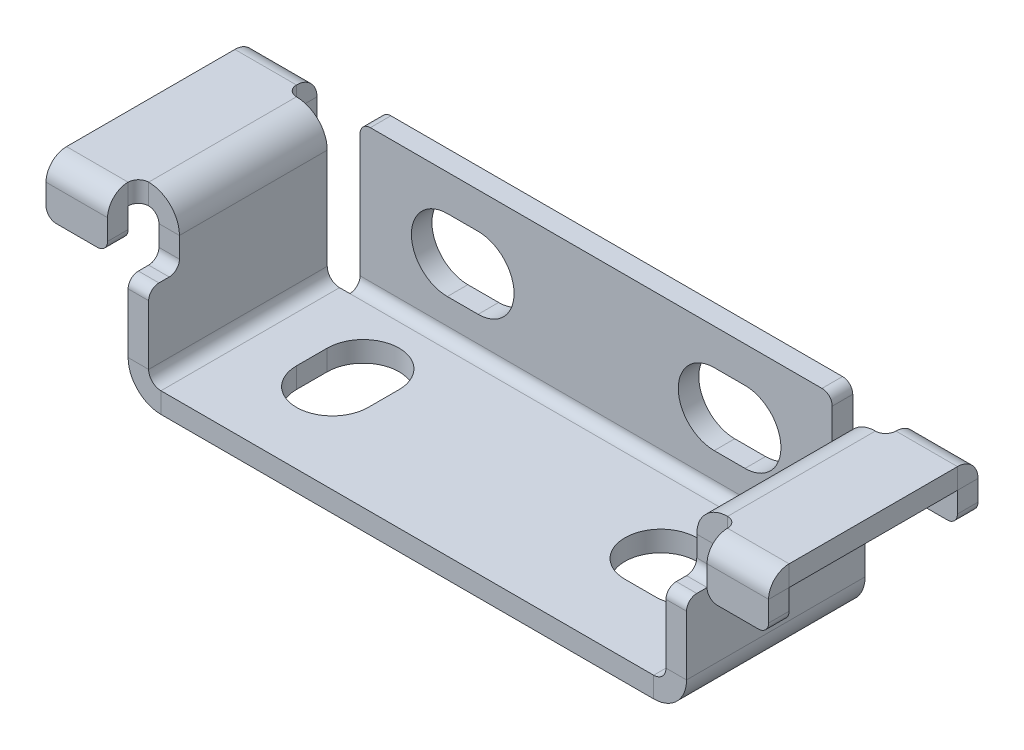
ISO-10303-21;
HEADER;
FILE_DESCRIPTION(('STEP AP214'),'2;1');
FILE_NAME('part.step','',(''),(''),'','','');
FILE_SCHEMA(('AUTOMOTIVE_DESIGN { 1 0 10303 214 1 1 1 1 }'));
ENDSEC;
DATA;
#1=APPLICATION_CONTEXT('core data for automotive mechanical design processes');
#2=APPLICATION_PROTOCOL_DEFINITION('international standard','automotive_design',2000,#1);
#3=PRODUCT_CONTEXT('',#1,'mechanical');
#4=PRODUCT('Part','Part','',(#3));
#5=PRODUCT_RELATED_PRODUCT_CATEGORY('part','',(#4));
#6=PRODUCT_DEFINITION_FORMATION('','',#4);
#7=PRODUCT_DEFINITION_CONTEXT('part definition',#1,'design');
#8=PRODUCT_DEFINITION('design','',#6,#7);
#9=PRODUCT_DEFINITION_SHAPE('','',#8);
#10=(LENGTH_UNIT() NAMED_UNIT(*) SI_UNIT(.MILLI.,.METRE.));
#11=(NAMED_UNIT(*) PLANE_ANGLE_UNIT() SI_UNIT($,.RADIAN.));
#12=(NAMED_UNIT(*) SI_UNIT($,.STERADIAN.) SOLID_ANGLE_UNIT());
#13=UNCERTAINTY_MEASURE_WITH_UNIT(LENGTH_MEASURE(1.E-05),#10,'distance_accuracy_value','');
#14=(GEOMETRIC_REPRESENTATION_CONTEXT(3) GLOBAL_UNCERTAINTY_ASSIGNED_CONTEXT((#13)) GLOBAL_UNIT_ASSIGNED_CONTEXT((#10,
#11,#12)) REPRESENTATION_CONTEXT('',''));
#15=CARTESIAN_POINT('',(0.,0.,0.));
#16=DIRECTION('',(0.,0.,1.));
#17=DIRECTION('',(1.,0.,0.));
#18=AXIS2_PLACEMENT_3D('',#15,#16,#17);
#19=CARTESIAN_POINT('',(12.6,3.5,4.6));
#20=DIRECTION('',(-1.,0.,0.));
#21=DIRECTION('',(0.,-1.,0.));
#22=AXIS2_PLACEMENT_3D('',#19,#20,#21);
#23=CYLINDRICAL_SURFACE('',#22,0.5);
#24=CARTESIAN_POINT('',(12.6,3.5,4.6));
#25=DIRECTION('',(-1.,0.,0.));
#26=DIRECTION('',(0.,1.,0.));
#27=AXIS2_PLACEMENT_3D('',#24,#25,#26);
#28=CIRCLE('',#27,0.5);
#29=CARTESIAN_POINT('',(12.6,3.5,5.1));
#30=VERTEX_POINT('',#29);
#31=CARTESIAN_POINT('',(12.6,4.,4.6));
#32=VERTEX_POINT('',#31);
#33=EDGE_CURVE('E726',#30,#32,#28,.T.);
#34=ORIENTED_EDGE('',*,*,#33,.F.);
#35=DIRECTION('',(-1.,0.,0.));
#36=VECTOR('',#35,1.);
#37=CARTESIAN_POINT('',(12.6,3.5,5.1));
#38=LINE('',#37,#36);
#39=CARTESIAN_POINT('',(13.6,3.5,5.1));
#40=VERTEX_POINT('',#39);
#41=EDGE_CURVE('E893',#40,#30,#38,.T.);
#42=ORIENTED_EDGE('',*,*,#41,.F.);
#43=CARTESIAN_POINT('',(13.6,3.5,4.6));
#44=DIRECTION('',(1.,0.,0.));
#45=DIRECTION('',(0.,1.,0.));
#46=AXIS2_PLACEMENT_3D('',#43,#44,#45);
#47=CIRCLE('',#46,0.5);
#48=CARTESIAN_POINT('',(13.6,4.,4.6));
#49=VERTEX_POINT('',#48);
#50=EDGE_CURVE('E888',#49,#40,#47,.T.);
#51=ORIENTED_EDGE('',*,*,#50,.F.);
#52=DIRECTION('',(1.,0.,0.));
#53=VECTOR('',#52,1.);
#54=CARTESIAN_POINT('',(13.6,4.,4.6));
#55=LINE('',#54,#53);
#56=EDGE_CURVE('E24',#32,#49,#55,.T.);
#57=ORIENTED_EDGE('',*,*,#56,.F.);
#58=EDGE_LOOP('',(#34,#42,#51,#57));
#59=FACE_BOUND('',#58,.T.);
#60=ADVANCED_FACE('F16',(#59),#23,.T.);
#61=CARTESIAN_POINT('',(12.6,4.5,4.1));
#62=DIRECTION('',(1.,0.,0.));
#63=DIRECTION('',(0.,1.,0.));
#64=AXIS2_PLACEMENT_3D('',#61,#62,#63);
#65=CYLINDRICAL_SURFACE('',#64,0.5);
#66=CARTESIAN_POINT('',(12.6,4.5,4.1));
#67=DIRECTION('',(1.,0.,0.));
#68=DIRECTION('',(0.,1.,0.));
#69=AXIS2_PLACEMENT_3D('',#66,#67,#68);
#70=CIRCLE('',#69,0.5);
#71=CARTESIAN_POINT('',(12.6,4.,4.1));
#72=VERTEX_POINT('',#71);
#73=CARTESIAN_POINT('',(12.6,4.5,3.6));
#74=VERTEX_POINT('',#73);
#75=EDGE_CURVE('E725',#72,#74,#70,.T.);
#76=ORIENTED_EDGE('',*,*,#75,.F.);
#77=DIRECTION('',(-1.,0.,0.));
#78=VECTOR('',#77,1.);
#79=CARTESIAN_POINT('',(12.6,4.,4.1));
#80=LINE('',#79,#78);
#81=CARTESIAN_POINT('',(13.6,4.,4.1));
#82=VERTEX_POINT('',#81);
#83=EDGE_CURVE('E1703',#82,#72,#80,.T.);
#84=ORIENTED_EDGE('',*,*,#83,.F.);
#85=CARTESIAN_POINT('',(13.6,4.5,4.1));
#86=DIRECTION('',(-1.,0.,0.));
#87=DIRECTION('',(0.,1.,0.));
#88=AXIS2_PLACEMENT_3D('',#85,#86,#87);
#89=CIRCLE('',#88,0.5);
#90=CARTESIAN_POINT('',(13.6,4.5,3.6));
#91=VERTEX_POINT('',#90);
#92=EDGE_CURVE('E943',#91,#82,#89,.T.);
#93=ORIENTED_EDGE('',*,*,#92,.F.);
#94=DIRECTION('',(1.,0.,0.));
#95=VECTOR('',#94,1.);
#96=CARTESIAN_POINT('',(13.6,4.5,3.6));
#97=LINE('',#96,#95);
#98=EDGE_CURVE('E1700',#74,#91,#97,.T.);
#99=ORIENTED_EDGE('',*,*,#98,.F.);
#100=EDGE_LOOP('',(#76,#84,#93,#99));
#101=FACE_BOUND('',#100,.T.);
#102=ADVANCED_FACE('F1722',(#101),#65,.F.);
#103=CARTESIAN_POINT('',(-13.6,3.5,4.6));
#104=DIRECTION('',(1.,0.,0.));
#105=DIRECTION('',(0.,1.,0.));
#106=AXIS2_PLACEMENT_3D('',#103,#104,#105);
#107=CYLINDRICAL_SURFACE('',#106,0.5);
#108=CARTESIAN_POINT('',(-12.6,3.5,4.6));
#109=DIRECTION('',(1.,0.,0.));
#110=DIRECTION('',(0.,-1.,0.));
#111=AXIS2_PLACEMENT_3D('',#108,#109,#110);
#112=CIRCLE('',#111,0.5);
#113=CARTESIAN_POINT('',(-12.6,4.,4.6));
#114=VERTEX_POINT('',#113);
#115=CARTESIAN_POINT('',(-12.6,3.5,5.1));
#116=VERTEX_POINT('',#115);
#117=EDGE_CURVE('E1152',#114,#116,#112,.T.);
#118=ORIENTED_EDGE('',*,*,#117,.F.);
#119=DIRECTION('',(1.,0.,0.));
#120=VECTOR('',#119,1.);
#121=CARTESIAN_POINT('',(-12.6,4.,4.6));
#122=LINE('',#121,#120);
#123=CARTESIAN_POINT('',(-13.6,4.,4.6));
#124=VERTEX_POINT('',#123);
#125=EDGE_CURVE('E1550',#124,#114,#122,.T.);
#126=ORIENTED_EDGE('',*,*,#125,.F.);
#127=CARTESIAN_POINT('',(-13.6,3.5,4.6));
#128=DIRECTION('',(-1.,0.,0.));
#129=DIRECTION('',(0.,-1.,0.));
#130=AXIS2_PLACEMENT_3D('',#127,#128,#129);
#131=CIRCLE('',#130,0.5);
#132=CARTESIAN_POINT('',(-13.6,3.5,5.1));
#133=VERTEX_POINT('',#132);
#134=EDGE_CURVE('E1162',#133,#124,#131,.T.);
#135=ORIENTED_EDGE('',*,*,#134,.F.);
#136=DIRECTION('',(-1.,0.,0.));
#137=VECTOR('',#136,1.);
#138=CARTESIAN_POINT('',(-13.6,3.5,5.1));
#139=LINE('',#138,#137);
#140=EDGE_CURVE('E799',#116,#133,#139,.T.);
#141=ORIENTED_EDGE('',*,*,#140,.F.);
#142=EDGE_LOOP('',(#118,#126,#135,#141));
#143=FACE_BOUND('',#142,.T.);
#144=ADVANCED_FACE('F1794',(#143),#107,.T.);
#145=CARTESIAN_POINT('',(-12.6,4.5,4.1));
#146=DIRECTION('',(-1.,0.,0.));
#147=DIRECTION('',(0.,-1.,0.));
#148=AXIS2_PLACEMENT_3D('',#145,#146,#147);
#149=CYLINDRICAL_SURFACE('',#148,0.5);
#150=CARTESIAN_POINT('',(-12.6,4.5,4.1));
#151=DIRECTION('',(-1.,0.,0.));
#152=DIRECTION('',(0.,-1.,0.));
#153=AXIS2_PLACEMENT_3D('',#150,#151,#152);
#154=CIRCLE('',#153,0.5);
#155=CARTESIAN_POINT('',(-12.6,4.5,3.6));
#156=VERTEX_POINT('',#155);
#157=CARTESIAN_POINT('',(-12.6,4.,4.1));
#158=VERTEX_POINT('',#157);
#159=EDGE_CURVE('E948',#156,#158,#154,.T.);
#160=ORIENTED_EDGE('',*,*,#159,.F.);
#161=DIRECTION('',(1.,0.,0.));
#162=VECTOR('',#161,1.);
#163=CARTESIAN_POINT('',(-12.6,4.5,3.6));
#164=LINE('',#163,#162);
#165=CARTESIAN_POINT('',(-13.6,4.5,3.6));
#166=VERTEX_POINT('',#165);
#167=EDGE_CURVE('E841',#166,#156,#164,.T.);
#168=ORIENTED_EDGE('',*,*,#167,.F.);
#169=CARTESIAN_POINT('',(-13.6,4.5,4.1));
#170=DIRECTION('',(1.,0.,0.));
#171=DIRECTION('',(0.,-1.,0.));
#172=AXIS2_PLACEMENT_3D('',#169,#170,#171);
#173=CIRCLE('',#172,0.5);
#174=CARTESIAN_POINT('',(-13.6,4.,4.1));
#175=VERTEX_POINT('',#174);
#176=EDGE_CURVE('E1068',#175,#166,#173,.T.);
#177=ORIENTED_EDGE('',*,*,#176,.F.);
#178=DIRECTION('',(-1.,0.,0.));
#179=VECTOR('',#178,1.);
#180=CARTESIAN_POINT('',(-13.6,4.,4.1));
#181=LINE('',#180,#179);
#182=EDGE_CURVE('E1547',#158,#175,#181,.T.);
#183=ORIENTED_EDGE('',*,*,#182,.F.);
#184=EDGE_LOOP('',(#160,#168,#177,#183));
#185=FACE_BOUND('',#184,.T.);
#186=ADVANCED_FACE('F1799',(#185),#149,.F.);
#187=CARTESIAN_POINT('',(-14.1,7.,4.1));
#188=DIRECTION('',(0.,-1.,0.));
#189=DIRECTION('',(0.,0.,-1.));
#190=AXIS2_PLACEMENT_3D('',#187,#188,#189);
#191=CYLINDRICAL_SURFACE('',#190,0.5);
#192=CARTESIAN_POINT('',(-14.1,7.,4.1));
#193=DIRECTION('',(0.,-1.,0.));
#194=DIRECTION('',(0.,0.,1.));
#195=AXIS2_PLACEMENT_3D('',#192,#193,#194);
#196=CIRCLE('',#195,0.5);
#197=CARTESIAN_POINT('',(-14.6,7.,4.1));
#198=VERTEX_POINT('',#197);
#199=CARTESIAN_POINT('',(-14.1,7.,3.6));
#200=VERTEX_POINT('',#199);
#201=EDGE_CURVE('E738',#198,#200,#196,.T.);
#202=ORIENTED_EDGE('',*,*,#201,.F.);
#203=DIRECTION('',(0.,1.,0.));
#204=VECTOR('',#203,1.);
#205=CARTESIAN_POINT('',(-14.6,7.,4.1));
#206=LINE('',#205,#204);
#207=CARTESIAN_POINT('',(-14.6,6.,4.1));
#208=VERTEX_POINT('',#207);
#209=EDGE_CURVE('E1116',#208,#198,#206,.T.);
#210=ORIENTED_EDGE('',*,*,#209,.F.);
#211=CARTESIAN_POINT('',(-14.1,6.,4.1));
#212=DIRECTION('',(0.,1.,0.));
#213=DIRECTION('',(0.,0.,1.));
#214=AXIS2_PLACEMENT_3D('',#211,#212,#213);
#215=CIRCLE('',#214,0.5);
#216=CARTESIAN_POINT('',(-14.1,6.,3.6));
#217=VERTEX_POINT('',#216);
#218=EDGE_CURVE('E931',#217,#208,#215,.T.);
#219=ORIENTED_EDGE('',*,*,#218,.F.);
#220=DIRECTION('',(0.,-1.,0.));
#221=VECTOR('',#220,1.);
#222=CARTESIAN_POINT('',(-14.1,7.,3.6));
#223=LINE('',#222,#221);
#224=EDGE_CURVE('E838',#200,#217,#223,.T.);
#225=ORIENTED_EDGE('',*,*,#224,.F.);
#226=EDGE_LOOP('',(#202,#210,#219,#225));
#227=FACE_BOUND('',#226,.T.);
#228=ADVANCED_FACE('F2127',(#227),#191,.F.);
#229=CARTESIAN_POINT('',(-14.1,7.,-4.1));
#230=DIRECTION('',(0.,-1.,0.));
#231=DIRECTION('',(0.,0.,-1.));
#232=AXIS2_PLACEMENT_3D('',#229,#230,#231);
#233=CYLINDRICAL_SURFACE('',#232,0.5);
#234=CARTESIAN_POINT('',(-14.1,6.,-4.1));
#235=DIRECTION('',(0.,1.,0.));
#236=DIRECTION('',(0.,0.,1.));
#237=AXIS2_PLACEMENT_3D('',#234,#235,#236);
#238=CIRCLE('',#237,0.5);
#239=CARTESIAN_POINT('',(-14.6,6.,-4.1));
#240=VERTEX_POINT('',#239);
#241=CARTESIAN_POINT('',(-14.1,6.,-3.6));
#242=VERTEX_POINT('',#241);
#243=EDGE_CURVE('E737',#240,#242,#238,.T.);
#244=ORIENTED_EDGE('',*,*,#243,.F.);
#245=DIRECTION('',(0.,1.,0.));
#246=VECTOR('',#245,1.);
#247=CARTESIAN_POINT('',(-14.6,7.,-4.1));
#248=LINE('',#247,#246);
#249=CARTESIAN_POINT('',(-14.6,7.,-4.1));
#250=VERTEX_POINT('',#249);
#251=EDGE_CURVE('E932',#240,#250,#248,.T.);
#252=ORIENTED_EDGE('',*,*,#251,.T.);
#253=CARTESIAN_POINT('',(-14.1,7.,-4.1));
#254=DIRECTION('',(0.,-1.,0.));
#255=DIRECTION('',(0.,0.,1.));
#256=AXIS2_PLACEMENT_3D('',#253,#254,#255);
#257=CIRCLE('',#256,0.5);
#258=CARTESIAN_POINT('',(-14.1,7.,-3.6));
#259=VERTEX_POINT('',#258);
#260=EDGE_CURVE('E1029',#259,#250,#257,.T.);
#261=ORIENTED_EDGE('',*,*,#260,.F.);
#262=DIRECTION('',(0.,1.,0.));
#263=VECTOR('',#262,1.);
#264=CARTESIAN_POINT('',(-14.1,6.,-3.6));
#265=LINE('',#264,#263);
#266=EDGE_CURVE('E1303',#242,#259,#265,.T.);
#267=ORIENTED_EDGE('',*,*,#266,.F.);
#268=EDGE_LOOP('',(#244,#252,#261,#267));
#269=FACE_BOUND('',#268,.T.);
#270=ADVANCED_FACE('F1878',(#269),#233,.F.);
#271=CARTESIAN_POINT('',(14.1,4.5,4.1));
#272=DIRECTION('',(0.,-1.,0.));
#273=DIRECTION('',(0.,0.,-1.));
#274=AXIS2_PLACEMENT_3D('',#271,#272,#273);
#275=CYLINDRICAL_SURFACE('',#274,0.5);
#276=CARTESIAN_POINT('',(14.1,7.,4.1));
#277=DIRECTION('',(0.,-1.,0.));
#278=DIRECTION('',(0.,0.,1.));
#279=AXIS2_PLACEMENT_3D('',#276,#277,#278);
#280=CIRCLE('',#279,0.5);
#281=CARTESIAN_POINT('',(14.1,7.,3.6));
#282=VERTEX_POINT('',#281);
#283=CARTESIAN_POINT('',(14.6,7.,4.1));
#284=VERTEX_POINT('',#283);
#285=EDGE_CURVE('E739',#282,#284,#280,.T.);
#286=ORIENTED_EDGE('',*,*,#285,.F.);
#287=DIRECTION('',(0.,-1.,0.));
#288=VECTOR('',#287,1.);
#289=CARTESIAN_POINT('',(14.1,7.,3.6));
#290=LINE('',#289,#288);
#291=CARTESIAN_POINT('',(14.1,6.,3.6));
#292=VERTEX_POINT('',#291);
#293=EDGE_CURVE('E1675',#282,#292,#290,.T.);
#294=ORIENTED_EDGE('',*,*,#293,.T.);
#295=CARTESIAN_POINT('',(14.1,6.,4.1));
#296=DIRECTION('',(0.,1.,0.));
#297=DIRECTION('',(0.,0.,1.));
#298=AXIS2_PLACEMENT_3D('',#295,#296,#297);
#299=CIRCLE('',#298,0.5);
#300=CARTESIAN_POINT('',(14.6,6.,4.1));
#301=VERTEX_POINT('',#300);
#302=EDGE_CURVE('E758',#301,#292,#299,.T.);
#303=ORIENTED_EDGE('',*,*,#302,.F.);
#304=DIRECTION('',(0.,-1.,0.));
#305=VECTOR('',#304,1.);
#306=CARTESIAN_POINT('',(14.6,4.5,4.1));
#307=LINE('',#306,#305);
#308=EDGE_CURVE('E1199',#284,#301,#307,.T.);
#309=ORIENTED_EDGE('',*,*,#308,.F.);
#310=EDGE_LOOP('',(#286,#294,#303,#309));
#311=FACE_BOUND('',#310,.T.);
#312=ADVANCED_FACE('F1773',(#311),#275,.F.);
#313=CARTESIAN_POINT('',(14.1,7.,-4.1));
#314=DIRECTION('',(0.,-1.,0.));
#315=DIRECTION('',(0.,0.,-1.));
#316=AXIS2_PLACEMENT_3D('',#313,#314,#315);
#317=CYLINDRICAL_SURFACE('',#316,0.5);
#318=CARTESIAN_POINT('',(14.1,6.,-4.1));
#319=DIRECTION('',(0.,1.,0.));
#320=DIRECTION('',(0.,0.,1.));
#321=AXIS2_PLACEMENT_3D('',#318,#319,#320);
#322=CIRCLE('',#321,0.5);
#323=CARTESIAN_POINT('',(14.1,6.,-3.6));
#324=VERTEX_POINT('',#323);
#325=CARTESIAN_POINT('',(14.6,6.,-4.1));
#326=VERTEX_POINT('',#325);
#327=EDGE_CURVE('E859',#324,#326,#322,.T.);
#328=ORIENTED_EDGE('',*,*,#327,.F.);
#329=DIRECTION('',(0.,1.,0.));
#330=VECTOR('',#329,1.);
#331=CARTESIAN_POINT('',(14.1,6.,-3.6));
#332=LINE('',#331,#330);
#333=CARTESIAN_POINT('',(14.1,7.,-3.6));
#334=VERTEX_POINT('',#333);
#335=EDGE_CURVE('E782',#324,#334,#332,.T.);
#336=ORIENTED_EDGE('',*,*,#335,.T.);
#337=CARTESIAN_POINT('',(14.1,7.,-4.1));
#338=DIRECTION('',(0.,-1.,0.));
#339=DIRECTION('',(0.,0.,1.));
#340=AXIS2_PLACEMENT_3D('',#337,#338,#339);
#341=CIRCLE('',#340,0.5);
#342=CARTESIAN_POINT('',(14.6,7.,-4.1));
#343=VERTEX_POINT('',#342);
#344=EDGE_CURVE('E793',#343,#334,#341,.T.);
#345=ORIENTED_EDGE('',*,*,#344,.F.);
#346=DIRECTION('',(0.,1.,0.));
#347=VECTOR('',#346,1.);
#348=CARTESIAN_POINT('',(14.6,7.,-4.1));
#349=LINE('',#348,#347);
#350=EDGE_CURVE('E10',#326,#343,#349,.T.);
#351=ORIENTED_EDGE('',*,*,#350,.F.);
#352=EDGE_LOOP('',(#328,#336,#345,#351));
#353=FACE_BOUND('',#352,.T.);
#354=ADVANCED_FACE('F1766',(#353),#317,.F.);
#355=CARTESIAN_POINT('',(-15.1,5.,5.1));
#356=DIRECTION('',(0.,0.,-1.));
#357=DIRECTION('',(0.,1.,0.));
#358=AXIS2_PLACEMENT_3D('',#355,#356,#357);
#359=CYLINDRICAL_SURFACE('',#358,0.5);
#360=CARTESIAN_POINT('',(-15.1,5.,5.1));
#361=DIRECTION('',(0.,0.,1.));
#362=DIRECTION('',(0.,-1.,0.));
#363=AXIS2_PLACEMENT_3D('',#360,#361,#362);
#364=CIRCLE('',#363,0.5);
#365=CARTESIAN_POINT('',(-15.1,4.5,5.1));
#366=VERTEX_POINT('',#365);
#367=CARTESIAN_POINT('',(-14.6,5.,5.1));
#368=VERTEX_POINT('',#367);
#369=EDGE_CURVE('E1466',#366,#368,#364,.T.);
#370=ORIENTED_EDGE('',*,*,#369,.F.);
#371=DIRECTION('',(0.,0.,1.));
#372=VECTOR('',#371,1.);
#373=CARTESIAN_POINT('',(-15.1,4.5,5.1));
#374=LINE('',#373,#372);
#375=CARTESIAN_POINT('',(-15.1,4.5,4.1));
#376=VERTEX_POINT('',#375);
#377=EDGE_CURVE('E1450',#376,#366,#374,.T.);
#378=ORIENTED_EDGE('',*,*,#377,.F.);
#379=CARTESIAN_POINT('',(-15.1,5.,4.1));
#380=DIRECTION('',(0.,0.,-1.));
#381=DIRECTION('',(0.,-1.,0.));
#382=AXIS2_PLACEMENT_3D('',#379,#380,#381);
#383=CIRCLE('',#382,0.5);
#384=CARTESIAN_POINT('',(-14.6,5.,4.1));
#385=VERTEX_POINT('',#384);
#386=EDGE_CURVE('E1477',#385,#376,#383,.T.);
#387=ORIENTED_EDGE('',*,*,#386,.F.);
#388=DIRECTION('',(0.,0.,-1.));
#389=VECTOR('',#388,1.);
#390=CARTESIAN_POINT('',(-14.6,5.,5.1));
#391=LINE('',#390,#389);
#392=EDGE_CURVE('E1115',#368,#385,#391,.T.);
#393=ORIENTED_EDGE('',*,*,#392,.F.);
#394=EDGE_LOOP('',(#370,#378,#387,#393));
#395=FACE_BOUND('',#394,.T.);
#396=ADVANCED_FACE('F1859',(#395),#359,.T.);
#397=CARTESIAN_POINT('',(-17.1,5.,5.1));
#398=DIRECTION('',(0.,0.,-1.));
#399=DIRECTION('',(0.,1.,0.));
#400=AXIS2_PLACEMENT_3D('',#397,#398,#399);
#401=CYLINDRICAL_SURFACE('',#400,0.5);
#402=CARTESIAN_POINT('',(-17.1,5.,5.1));
#403=DIRECTION('',(0.,0.,1.));
#404=DIRECTION('',(0.,-1.,0.));
#405=AXIS2_PLACEMENT_3D('',#402,#403,#404);
#406=CIRCLE('',#405,0.5);
#407=CARTESIAN_POINT('',(-17.6,5.,5.1));
#408=VERTEX_POINT('',#407);
#409=CARTESIAN_POINT('',(-17.1,4.5,5.1));
#410=VERTEX_POINT('',#409);
#411=EDGE_CURVE('E1463',#408,#410,#406,.T.);
#412=ORIENTED_EDGE('',*,*,#411,.F.);
#413=DIRECTION('',(0.,0.,1.));
#414=VECTOR('',#413,1.);
#415=CARTESIAN_POINT('',(-17.6,5.,5.1));
#416=LINE('',#415,#414);
#417=CARTESIAN_POINT('',(-17.6,5.,4.1));
#418=VERTEX_POINT('',#417);
#419=EDGE_CURVE('E1137',#418,#408,#416,.T.);
#420=ORIENTED_EDGE('',*,*,#419,.F.);
#421=CARTESIAN_POINT('',(-17.1,5.,4.1));
#422=DIRECTION('',(0.,0.,-1.));
#423=DIRECTION('',(0.,-1.,0.));
#424=AXIS2_PLACEMENT_3D('',#421,#422,#423);
#425=CIRCLE('',#424,0.5);
#426=CARTESIAN_POINT('',(-17.1,4.5,4.1));
#427=VERTEX_POINT('',#426);
#428=EDGE_CURVE('E1474',#427,#418,#425,.T.);
#429=ORIENTED_EDGE('',*,*,#428,.F.);
#430=DIRECTION('',(0.,0.,-1.));
#431=VECTOR('',#430,1.);
#432=CARTESIAN_POINT('',(-17.1,4.5,5.1));
#433=LINE('',#432,#431);
#434=EDGE_CURVE('E1117',#410,#427,#433,.T.);
#435=ORIENTED_EDGE('',*,*,#434,.F.);
#436=EDGE_LOOP('',(#412,#420,#429,#435));
#437=FACE_BOUND('',#436,.T.);
#438=ADVANCED_FACE('F1810',(#437),#401,.T.);
#439=CARTESIAN_POINT('',(-15.1,5.,-5.1));
#440=DIRECTION('',(0.,0.,1.));
#441=DIRECTION('',(0.,-1.,0.));
#442=AXIS2_PLACEMENT_3D('',#439,#440,#441);
#443=CYLINDRICAL_SURFACE('',#442,0.5);
#444=CARTESIAN_POINT('',(-15.1,5.,-5.1));
#445=DIRECTION('',(0.,0.,-1.));
#446=DIRECTION('',(0.,1.,0.));
#447=AXIS2_PLACEMENT_3D('',#444,#445,#446);
#448=CIRCLE('',#447,0.5);
#449=CARTESIAN_POINT('',(-14.6,5.,-5.1));
#450=VERTEX_POINT('',#449);
#451=CARTESIAN_POINT('',(-15.1,4.5,-5.1));
#452=VERTEX_POINT('',#451);
#453=EDGE_CURVE('E1528',#450,#452,#448,.T.);
#454=ORIENTED_EDGE('',*,*,#453,.F.);
#455=DIRECTION('',(0.,0.,-1.));
#456=VECTOR('',#455,1.);
#457=CARTESIAN_POINT('',(-14.6,5.,-5.1));
#458=LINE('',#457,#456);
#459=CARTESIAN_POINT('',(-14.6,5.,-4.1));
#460=VERTEX_POINT('',#459);
#461=EDGE_CURVE('E1497',#460,#450,#458,.T.);
#462=ORIENTED_EDGE('',*,*,#461,.F.);
#463=CARTESIAN_POINT('',(-15.1,5.,-4.1));
#464=DIRECTION('',(0.,0.,1.));
#465=DIRECTION('',(0.,1.,0.));
#466=AXIS2_PLACEMENT_3D('',#463,#464,#465);
#467=CIRCLE('',#466,0.5);
#468=CARTESIAN_POINT('',(-15.1,4.5,-4.1));
#469=VERTEX_POINT('',#468);
#470=EDGE_CURVE('E1534',#469,#460,#467,.T.);
#471=ORIENTED_EDGE('',*,*,#470,.F.);
#472=DIRECTION('',(0.,0.,1.));
#473=VECTOR('',#472,1.);
#474=CARTESIAN_POINT('',(-15.1,4.5,-5.1));
#475=LINE('',#474,#473);
#476=EDGE_CURVE('E864',#452,#469,#475,.T.);
#477=ORIENTED_EDGE('',*,*,#476,.F.);
#478=EDGE_LOOP('',(#454,#462,#471,#477));
#479=FACE_BOUND('',#478,.T.);
#480=ADVANCED_FACE('F1806',(#479),#443,.T.);
#481=CARTESIAN_POINT('',(-17.1,5.,-5.1));
#482=DIRECTION('',(0.,0.,1.));
#483=DIRECTION('',(0.,-1.,0.));
#484=AXIS2_PLACEMENT_3D('',#481,#482,#483);
#485=CYLINDRICAL_SURFACE('',#484,0.5);
#486=CARTESIAN_POINT('',(-17.1,5.,-5.1));
#487=DIRECTION('',(0.,0.,-1.));
#488=DIRECTION('',(0.,1.,0.));
#489=AXIS2_PLACEMENT_3D('',#486,#487,#488);
#490=CIRCLE('',#489,0.5);
#491=CARTESIAN_POINT('',(-17.1,4.5,-5.1));
#492=VERTEX_POINT('',#491);
#493=CARTESIAN_POINT('',(-17.6,5.,-5.1));
#494=VERTEX_POINT('',#493);
#495=EDGE_CURVE('E1525',#492,#494,#490,.T.);
#496=ORIENTED_EDGE('',*,*,#495,.F.);
#497=DIRECTION('',(0.,0.,-1.));
#498=VECTOR('',#497,1.);
#499=CARTESIAN_POINT('',(-17.1,4.5,-5.1));
#500=LINE('',#499,#498);
#501=CARTESIAN_POINT('',(-17.1,4.5,-4.1));
#502=VERTEX_POINT('',#501);
#503=EDGE_CURVE('E865',#502,#492,#500,.T.);
#504=ORIENTED_EDGE('',*,*,#503,.F.);
#505=CARTESIAN_POINT('',(-17.1,5.,-4.1));
#506=DIRECTION('',(0.,0.,1.));
#507=DIRECTION('',(0.,1.,0.));
#508=AXIS2_PLACEMENT_3D('',#505,#506,#507);
#509=CIRCLE('',#508,0.5);
#510=CARTESIAN_POINT('',(-17.6,5.,-4.1));
#511=VERTEX_POINT('',#510);
#512=EDGE_CURVE('E1531',#511,#502,#509,.T.);
#513=ORIENTED_EDGE('',*,*,#512,.F.);
#514=DIRECTION('',(0.,0.,1.));
#515=VECTOR('',#514,1.);
#516=CARTESIAN_POINT('',(-17.6,5.,-5.1));
#517=LINE('',#516,#515);
#518=EDGE_CURVE('E1178',#494,#511,#517,.T.);
#519=ORIENTED_EDGE('',*,*,#518,.F.);
#520=EDGE_LOOP('',(#496,#504,#513,#519));
#521=FACE_BOUND('',#520,.T.);
#522=ADVANCED_FACE('F1809',(#521),#485,.T.);
#523=CARTESIAN_POINT('',(17.1,5.,5.1));
#524=DIRECTION('',(0.,0.,-1.));
#525=DIRECTION('',(0.,1.,0.));
#526=AXIS2_PLACEMENT_3D('',#523,#524,#525);
#527=CYLINDRICAL_SURFACE('',#526,0.5);
#528=CARTESIAN_POINT('',(17.1,5.,5.1));
#529=DIRECTION('',(0.,0.,1.));
#530=DIRECTION('',(0.,-1.,0.));
#531=AXIS2_PLACEMENT_3D('',#528,#529,#530);
#532=CIRCLE('',#531,0.5);
#533=CARTESIAN_POINT('',(17.1,4.5,5.1));
#534=VERTEX_POINT('',#533);
#535=CARTESIAN_POINT('',(17.6,5.,5.1));
#536=VERTEX_POINT('',#535);
#537=EDGE_CURVE('E1647',#534,#536,#532,.T.);
#538=ORIENTED_EDGE('',*,*,#537,.F.);
#539=DIRECTION('',(0.,0.,1.));
#540=VECTOR('',#539,1.);
#541=CARTESIAN_POINT('',(17.1,4.5,5.1));
#542=LINE('',#541,#540);
#543=CARTESIAN_POINT('',(17.1,4.5,4.1));
#544=VERTEX_POINT('',#543);
#545=EDGE_CURVE('E1630',#544,#534,#542,.T.);
#546=ORIENTED_EDGE('',*,*,#545,.F.);
#547=CARTESIAN_POINT('',(17.1,5.,4.1));
#548=DIRECTION('',(0.,0.,-1.));
#549=DIRECTION('',(0.,-1.,0.));
#550=AXIS2_PLACEMENT_3D('',#547,#548,#549);
#551=CIRCLE('',#550,0.5);
#552=CARTESIAN_POINT('',(17.6,5.,4.1));
#553=VERTEX_POINT('',#552);
#554=EDGE_CURVE('E1653',#553,#544,#551,.T.);
#555=ORIENTED_EDGE('',*,*,#554,.F.);
#556=DIRECTION('',(0.,0.,-1.));
#557=VECTOR('',#556,1.);
#558=CARTESIAN_POINT('',(17.6,5.,5.1));
#559=LINE('',#558,#557);
#560=EDGE_CURVE('E1637',#536,#553,#559,.T.);
#561=ORIENTED_EDGE('',*,*,#560,.F.);
#562=EDGE_LOOP('',(#538,#546,#555,#561));
#563=FACE_BOUND('',#562,.T.);
#564=ADVANCED_FACE('F1879',(#563),#527,.T.);
#565=CARTESIAN_POINT('',(15.1,5.,5.1));
#566=DIRECTION('',(0.,0.,-1.));
#567=DIRECTION('',(0.,1.,0.));
#568=AXIS2_PLACEMENT_3D('',#565,#566,#567);
#569=CYLINDRICAL_SURFACE('',#568,0.5);
#570=CARTESIAN_POINT('',(15.1,5.,5.1));
#571=DIRECTION('',(0.,0.,1.));
#572=DIRECTION('',(0.,-1.,0.));
#573=AXIS2_PLACEMENT_3D('',#570,#571,#572);
#574=CIRCLE('',#573,0.5);
#575=CARTESIAN_POINT('',(14.6,5.,5.1));
#576=VERTEX_POINT('',#575);
#577=CARTESIAN_POINT('',(15.1,4.5,5.1));
#578=VERTEX_POINT('',#577);
#579=EDGE_CURVE('E1644',#576,#578,#574,.T.);
#580=ORIENTED_EDGE('',*,*,#579,.F.);
#581=DIRECTION('',(0.,0.,1.));
#582=VECTOR('',#581,1.);
#583=CARTESIAN_POINT('',(14.6,5.,5.1));
#584=LINE('',#583,#582);
#585=CARTESIAN_POINT('',(14.6,5.,4.1));
#586=VERTEX_POINT('',#585);
#587=EDGE_CURVE('E1198',#586,#576,#584,.T.);
#588=ORIENTED_EDGE('',*,*,#587,.F.);
#589=CARTESIAN_POINT('',(15.1,5.,4.1));
#590=DIRECTION('',(0.,0.,-1.));
#591=DIRECTION('',(0.,-1.,0.));
#592=AXIS2_PLACEMENT_3D('',#589,#590,#591);
#593=CIRCLE('',#592,0.5);
#594=CARTESIAN_POINT('',(15.1,4.5,4.1));
#595=VERTEX_POINT('',#594);
#596=EDGE_CURVE('E1650',#595,#586,#593,.T.);
#597=ORIENTED_EDGE('',*,*,#596,.F.);
#598=DIRECTION('',(0.,0.,-1.));
#599=VECTOR('',#598,1.);
#600=CARTESIAN_POINT('',(15.1,4.5,5.1));
#601=LINE('',#600,#599);
#602=EDGE_CURVE('E1622',#578,#595,#601,.T.);
#603=ORIENTED_EDGE('',*,*,#602,.F.);
#604=EDGE_LOOP('',(#580,#588,#597,#603));
#605=FACE_BOUND('',#604,.T.);
#606=ADVANCED_FACE('F1882',(#605),#569,.T.);
#607=CARTESIAN_POINT('',(15.1,5.,-5.1));
#608=DIRECTION('',(0.,0.,1.));
#609=DIRECTION('',(0.,-1.,0.));
#610=AXIS2_PLACEMENT_3D('',#607,#608,#609);
#611=CYLINDRICAL_SURFACE('',#610,0.5);
#612=CARTESIAN_POINT('',(15.1,5.,-5.1));
#613=DIRECTION('',(0.,0.,-1.));
#614=DIRECTION('',(0.,1.,0.));
#615=AXIS2_PLACEMENT_3D('',#612,#613,#614);
#616=CIRCLE('',#615,0.5);
#617=CARTESIAN_POINT('',(15.1,4.5,-5.1));
#618=VERTEX_POINT('',#617);
#619=CARTESIAN_POINT('',(14.6,5.,-5.1));
#620=VERTEX_POINT('',#619);
#621=EDGE_CURVE('E48',#618,#620,#616,.T.);
#622=ORIENTED_EDGE('',*,*,#621,.F.);
#623=DIRECTION('',(0.,0.,-1.));
#624=VECTOR('',#623,1.);
#625=CARTESIAN_POINT('',(15.1,4.5,-5.1));
#626=LINE('',#625,#624);
#627=CARTESIAN_POINT('',(15.1,4.5,-4.1));
#628=VERTEX_POINT('',#627);
#629=EDGE_CURVE('E1230',#628,#618,#626,.T.);
#630=ORIENTED_EDGE('',*,*,#629,.F.);
#631=CARTESIAN_POINT('',(15.1,5.,-4.1));
#632=DIRECTION('',(0.,0.,1.));
#633=DIRECTION('',(0.,1.,0.));
#634=AXIS2_PLACEMENT_3D('',#631,#632,#633);
#635=CIRCLE('',#634,0.5);
#636=CARTESIAN_POINT('',(14.6,5.,-4.1));
#637=VERTEX_POINT('',#636);
#638=EDGE_CURVE('E37',#637,#628,#635,.T.);
#639=ORIENTED_EDGE('',*,*,#638,.F.);
#640=DIRECTION('',(0.,0.,1.));
#641=VECTOR('',#640,1.);
#642=CARTESIAN_POINT('',(14.6,5.,-5.1));
#643=LINE('',#642,#641);
#644=EDGE_CURVE('E1684',#620,#637,#643,.T.);
#645=ORIENTED_EDGE('',*,*,#644,.F.);
#646=EDGE_LOOP('',(#622,#630,#639,#645));
#647=FACE_BOUND('',#646,.T.);
#648=ADVANCED_FACE('F1980',(#647),#611,.T.);
#649=CARTESIAN_POINT('',(17.1,5.,-5.1));
#650=DIRECTION('',(0.,0.,1.));
#651=DIRECTION('',(0.,-1.,0.));
#652=AXIS2_PLACEMENT_3D('',#649,#650,#651);
#653=CYLINDRICAL_SURFACE('',#652,0.5);
#654=CARTESIAN_POINT('',(17.1,5.,-5.1));
#655=DIRECTION('',(0.,0.,-1.));
#656=DIRECTION('',(0.,1.,0.));
#657=AXIS2_PLACEMENT_3D('',#654,#655,#656);
#658=CIRCLE('',#657,0.5);
#659=CARTESIAN_POINT('',(17.6,5.,-5.1));
#660=VERTEX_POINT('',#659);
#661=CARTESIAN_POINT('',(17.1,4.5,-5.1));
#662=VERTEX_POINT('',#661);
#663=EDGE_CURVE('E1541',#660,#662,#658,.T.);
#664=ORIENTED_EDGE('',*,*,#663,.F.);
#665=DIRECTION('',(0.,0.,-1.));
#666=VECTOR('',#665,1.);
#667=CARTESIAN_POINT('',(17.6,5.,-5.1));
#668=LINE('',#667,#666);
#669=CARTESIAN_POINT('',(17.6,5.,-4.1));
#670=VERTEX_POINT('',#669);
#671=EDGE_CURVE('E1467',#670,#660,#668,.T.);
#672=ORIENTED_EDGE('',*,*,#671,.F.);
#673=CARTESIAN_POINT('',(17.1,5.,-4.1));
#674=DIRECTION('',(0.,0.,1.));
#675=DIRECTION('',(0.,1.,0.));
#676=AXIS2_PLACEMENT_3D('',#673,#674,#675);
#677=CIRCLE('',#676,0.5);
#678=CARTESIAN_POINT('',(17.1,4.5,-4.1));
#679=VERTEX_POINT('',#678);
#680=EDGE_CURVE('E1491',#679,#670,#677,.T.);
#681=ORIENTED_EDGE('',*,*,#680,.F.);
#682=DIRECTION('',(0.,0.,1.));
#683=VECTOR('',#682,1.);
#684=CARTESIAN_POINT('',(17.1,4.5,-5.1));
#685=LINE('',#684,#683);
#686=EDGE_CURVE('E976',#662,#679,#685,.T.);
#687=ORIENTED_EDGE('',*,*,#686,.F.);
#688=EDGE_LOOP('',(#664,#672,#681,#687));
#689=FACE_BOUND('',#688,.T.);
#690=ADVANCED_FACE('F1977',(#689),#653,.T.);
#691=CARTESIAN_POINT('',(-11.,6.5,-5.1));
#692=DIRECTION('',(0.,0.,1.));
#693=DIRECTION('',(1.,0.,0.));
#694=AXIS2_PLACEMENT_3D('',#691,#692,#693);
#695=CYLINDRICAL_SURFACE('',#694,0.5);
#696=CARTESIAN_POINT('',(-11.,6.5,-5.1));
#697=DIRECTION('',(0.,0.,-1.));
#698=DIRECTION('',(-1.,0.,0.));
#699=AXIS2_PLACEMENT_3D('',#696,#697,#698);
#700=CIRCLE('',#699,0.5);
#701=CARTESIAN_POINT('',(-11.5,6.5,-5.1));
#702=VERTEX_POINT('',#701);
#703=CARTESIAN_POINT('',(-11.,7.,-5.1));
#704=VERTEX_POINT('',#703);
#705=EDGE_CURVE('E1337',#702,#704,#700,.T.);
#706=ORIENTED_EDGE('',*,*,#705,.F.);
#707=DIRECTION('',(0.,0.,-1.));
#708=VECTOR('',#707,1.);
#709=CARTESIAN_POINT('',(-11.5,6.5,-5.1));
#710=LINE('',#709,#708);
#711=CARTESIAN_POINT('',(-11.5,6.5,-4.1));
#712=VERTEX_POINT('',#711);
#713=EDGE_CURVE('E847',#712,#702,#710,.T.);
#714=ORIENTED_EDGE('',*,*,#713,.F.);
#715=CARTESIAN_POINT('',(-11.,6.5,-4.1));
#716=DIRECTION('',(0.,0.,1.));
#717=DIRECTION('',(-1.,0.,0.));
#718=AXIS2_PLACEMENT_3D('',#715,#716,#717);
#719=CIRCLE('',#718,0.5);
#720=CARTESIAN_POINT('',(-11.,7.,-4.1));
#721=VERTEX_POINT('',#720);
#722=EDGE_CURVE('E1373',#721,#712,#719,.T.);
#723=ORIENTED_EDGE('',*,*,#722,.F.);
#724=DIRECTION('',(0.,0.,1.));
#725=VECTOR('',#724,1.);
#726=CARTESIAN_POINT('',(-11.,7.,-5.1));
#727=LINE('',#726,#725);
#728=EDGE_CURVE('E1415',#704,#721,#727,.T.);
#729=ORIENTED_EDGE('',*,*,#728,.F.);
#730=EDGE_LOOP('',(#706,#714,#723,#729));
#731=FACE_BOUND('',#730,.T.);
#732=ADVANCED_FACE('F1816',(#731),#695,.T.);
#733=CARTESIAN_POINT('',(11.,6.5,-5.1));
#734=DIRECTION('',(0.,0.,1.));
#735=DIRECTION('',(1.,0.,0.));
#736=AXIS2_PLACEMENT_3D('',#733,#734,#735);
#737=CYLINDRICAL_SURFACE('',#736,0.5);
#738=CARTESIAN_POINT('',(11.,6.5,-5.1));
#739=DIRECTION('',(0.,0.,-1.));
#740=DIRECTION('',(-1.,0.,0.));
#741=AXIS2_PLACEMENT_3D('',#738,#739,#740);
#742=CIRCLE('',#741,0.5);
#743=CARTESIAN_POINT('',(11.,7.,-5.1));
#744=VERTEX_POINT('',#743);
#745=CARTESIAN_POINT('',(11.5,6.5,-5.1));
#746=VERTEX_POINT('',#745);
#747=EDGE_CURVE('E1334',#744,#746,#742,.T.);
#748=ORIENTED_EDGE('',*,*,#747,.F.);
#749=DIRECTION('',(0.,0.,-1.));
#750=VECTOR('',#749,1.);
#751=CARTESIAN_POINT('',(11.,7.,-5.1));
#752=LINE('',#751,#750);
#753=CARTESIAN_POINT('',(11.,7.,-4.1));
#754=VERTEX_POINT('',#753);
#755=EDGE_CURVE('E1412',#754,#744,#752,.T.);
#756=ORIENTED_EDGE('',*,*,#755,.F.);
#757=CARTESIAN_POINT('',(11.,6.5,-4.1));
#758=DIRECTION('',(0.,0.,1.));
#759=DIRECTION('',(-1.,0.,0.));
#760=AXIS2_PLACEMENT_3D('',#757,#758,#759);
#761=CIRCLE('',#760,0.5);
#762=CARTESIAN_POINT('',(11.5,6.5,-4.1));
#763=VERTEX_POINT('',#762);
#764=EDGE_CURVE('E1365',#763,#754,#761,.T.);
#765=ORIENTED_EDGE('',*,*,#764,.F.);
#766=DIRECTION('',(0.,0.,1.));
#767=VECTOR('',#766,1.);
#768=CARTESIAN_POINT('',(11.5,6.5,-5.1));
#769=LINE('',#768,#767);
#770=EDGE_CURVE('E1316',#746,#763,#769,.T.);
#771=ORIENTED_EDGE('',*,*,#770,.F.);
#772=EDGE_LOOP('',(#748,#756,#765,#771));
#773=FACE_BOUND('',#772,.T.);
#774=ADVANCED_FACE('F1812',(#773),#737,.T.);
#775=CARTESIAN_POINT('',(14.6,7.,-5.1));
#776=DIRECTION('',(1.,0.,0.));
#777=DIRECTION('',(0.,-1.,0.));
#778=AXIS2_PLACEMENT_3D('',#775,#776,#777);
#779=PLANE('',#778);
#780=DIRECTION('',(0.,0.,1.));
#781=VECTOR('',#780,1.);
#782=CARTESIAN_POINT('',(14.6,6.,-5.1));
#783=LINE('',#782,#781);
#784=CARTESIAN_POINT('',(14.6,6.,-5.1));
#785=VERTEX_POINT('',#784);
#786=EDGE_CURVE('E1537',#785,#326,#783,.T.);
#787=ORIENTED_EDGE('',*,*,#786,.T.);
#788=ORIENTED_EDGE('',*,*,#350,.T.);
#789=CARTESIAN_POINT('',(14.6,6.,-4.1));
#790=DIRECTION('',(-1.,0.,0.));
#791=DIRECTION('',(0.,-1.,0.));
#792=AXIS2_PLACEMENT_3D('',#789,#790,#791);
#793=CIRCLE('',#792,1.);
#794=EDGE_CURVE('E1054',#343,#785,#793,.T.);
#795=ORIENTED_EDGE('',*,*,#794,.T.);
#796=EDGE_LOOP('',(#787,#788,#795));
#797=FACE_BOUND('',#796,.T.);
#798=ADVANCED_FACE('F1815',(#797),#779,.F.);
#799=CARTESIAN_POINT('',(14.6,6.,4.1));
#800=DIRECTION('',(-1.,0.,0.));
#801=DIRECTION('',(0.,0.,1.));
#802=AXIS2_PLACEMENT_3D('',#799,#800,#801);
#803=PLANE('',#802);
#804=DIRECTION('',(0.,-1.,0.));
#805=VECTOR('',#804,1.);
#806=CARTESIAN_POINT('',(14.6,7.,4.37931337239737));
#807=LINE('',#806,#805);
#808=CARTESIAN_POINT('',(14.6,6.9602,4.37931337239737));
#809=VERTEX_POINT('',#808);
#810=CARTESIAN_POINT('',(14.6,6.,4.37931337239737));
#811=VERTEX_POINT('',#810);
#812=EDGE_CURVE('E1615',#809,#811,#807,.T.);
#813=ORIENTED_EDGE('',*,*,#812,.T.);
#814=DIRECTION('',(0.,0.,-1.));
#815=VECTOR('',#814,1.);
#816=CARTESIAN_POINT('',(14.6,6.,5.1));
#817=LINE('',#816,#815);
#818=CARTESIAN_POINT('',(14.6,6.,5.1));
#819=VERTEX_POINT('',#818);
#820=EDGE_CURVE('E1611',#819,#811,#817,.T.);
#821=ORIENTED_EDGE('',*,*,#820,.F.);
#822=CARTESIAN_POINT('',(14.6,6.,4.1));
#823=DIRECTION('',(1.,0.,0.));
#824=DIRECTION('',(0.,0.,-1.));
#825=AXIS2_PLACEMENT_3D('',#822,#823,#824);
#826=CIRCLE('',#825,1.);
#827=EDGE_CURVE('E1589',#809,#819,#826,.T.);
#828=ORIENTED_EDGE('',*,*,#827,.F.);
#829=EDGE_LOOP('',(#813,#821,#828));
#830=FACE_BOUND('',#829,.T.);
#831=ADVANCED_FACE('F1982',(#830),#803,.T.);
#832=CARTESIAN_POINT('',(12.6,4.,3.6));
#833=DIRECTION('',(0.,1.,0.));
#834=DIRECTION('',(1.,0.,0.));
#835=AXIS2_PLACEMENT_3D('',#832,#833,#834);
#836=PLANE('',#835);
#837=DIRECTION('',(0.,0.,1.));
#838=VECTOR('',#837,1.);
#839=CARTESIAN_POINT('',(13.6,4.,0.));
#840=LINE('',#839,#838);
#841=EDGE_CURVE('E884',#82,#49,#840,.T.);
#842=ORIENTED_EDGE('',*,*,#841,.F.);
#843=ORIENTED_EDGE('',*,*,#83,.T.);
#844=DIRECTION('',(0.,0.,1.));
#845=VECTOR('',#844,1.);
#846=CARTESIAN_POINT('',(12.6,4.,3.6));
#847=LINE('',#846,#845);
#848=EDGE_CURVE('E721',#72,#32,#847,.T.);
#849=ORIENTED_EDGE('',*,*,#848,.T.);
#850=ORIENTED_EDGE('',*,*,#56,.T.);
#851=EDGE_LOOP('',(#842,#843,#849,#850));
#852=FACE_BOUND('',#851,.T.);
#853=ADVANCED_FACE('F1710',(#852),#836,.T.);
#854=CARTESIAN_POINT('',(12.6,7.,3.6));
#855=DIRECTION('',(0.,0.,-1.));
#856=DIRECTION('',(0.,-1.,0.));
#857=AXIS2_PLACEMENT_3D('',#854,#855,#856);
#858=PLANE('',#857);
#859=DIRECTION('',(0.,1.,0.));
#860=VECTOR('',#859,1.);
#861=CARTESIAN_POINT('',(12.6,7.,3.6));
#862=LINE('',#861,#860);
#863=CARTESIAN_POINT('',(12.6,5.5,3.6));
#864=VERTEX_POINT('',#863);
#865=EDGE_CURVE('E971',#74,#864,#862,.T.);
#866=ORIENTED_EDGE('',*,*,#865,.F.);
#867=ORIENTED_EDGE('',*,*,#98,.T.);
#868=DIRECTION('',(0.,1.,0.));
#869=VECTOR('',#868,1.);
#870=CARTESIAN_POINT('',(13.6,0.,3.6));
#871=LINE('',#870,#869);
#872=CARTESIAN_POINT('',(13.6,5.5,3.6));
#873=VERTEX_POINT('',#872);
#874=EDGE_CURVE('E731',#91,#873,#871,.T.);
#875=ORIENTED_EDGE('',*,*,#874,.T.);
#876=DIRECTION('',(1.,0.,0.));
#877=VECTOR('',#876,1.);
#878=CARTESIAN_POINT('',(12.6,5.5,3.6));
#879=LINE('',#878,#877);
#880=EDGE_CURVE('E1697',#864,#873,#879,.T.);
#881=ORIENTED_EDGE('',*,*,#880,.F.);
#882=EDGE_LOOP('',(#866,#867,#875,#881));
#883=FACE_BOUND('',#882,.T.);
#884=ADVANCED_FACE('F1754',(#883),#858,.F.);
#885=CARTESIAN_POINT('',(14.1,5.5,3.6));
#886=DIRECTION('',(0.,0.,-1.));
#887=DIRECTION('',(0.,-1.,0.));
#888=AXIS2_PLACEMENT_3D('',#885,#886,#887);
#889=PLANE('',#888);
#890=ORIENTED_EDGE('',*,*,#293,.F.);
#891=CARTESIAN_POINT('',(14.1,5.5,3.6));
#892=DIRECTION('',(0.,0.,1.));
#893=DIRECTION('',(0.,-1.,0.));
#894=AXIS2_PLACEMENT_3D('',#891,#892,#893);
#895=CIRCLE('',#894,1.5);
#896=EDGE_CURVE('E836',#282,#864,#895,.T.);
#897=ORIENTED_EDGE('',*,*,#896,.T.);
#898=ORIENTED_EDGE('',*,*,#880,.T.);
#899=CARTESIAN_POINT('',(14.1,5.5,3.6));
#900=DIRECTION('',(0.,0.,1.));
#901=DIRECTION('',(1.,0.,0.));
#902=AXIS2_PLACEMENT_3D('',#899,#900,#901);
#903=CIRCLE('',#902,0.5);
#904=EDGE_CURVE('E916',#292,#873,#903,.T.);
#905=ORIENTED_EDGE('',*,*,#904,.F.);
#906=EDGE_LOOP('',(#890,#897,#898,#905));
#907=FACE_BOUND('',#906,.T.);
#908=ADVANCED_FACE('F1775',(#907),#889,.F.);
#909=CARTESIAN_POINT('',(0.,0.,-4.1));
#910=DIRECTION('',(0.,0.,-1.));
#911=DIRECTION('',(-1.,0.,0.));
#912=AXIS2_PLACEMENT_3D('',#909,#910,#911);
#913=PLANE('',#912);
#914=DIRECTION('',(-1.,0.,0.));
#915=VECTOR('',#914,1.);
#916=CARTESIAN_POINT('',(14.6,4.5,-4.1));
#917=LINE('',#916,#915);
#918=EDGE_CURVE('E980',#679,#628,#917,.T.);
#919=ORIENTED_EDGE('',*,*,#918,.F.);
#920=ORIENTED_EDGE('',*,*,#680,.T.);
#921=DIRECTION('',(0.,-1.,0.));
#922=VECTOR('',#921,1.);
#923=CARTESIAN_POINT('',(17.6,4.5,-4.1));
#924=LINE('',#923,#922);
#925=CARTESIAN_POINT('',(17.6,6.,-4.1));
#926=VERTEX_POINT('',#925);
#927=EDGE_CURVE('E1053',#926,#670,#924,.T.);
#928=ORIENTED_EDGE('',*,*,#927,.F.);
#929=DIRECTION('',(1.,0.,0.));
#930=VECTOR('',#929,1.);
#931=CARTESIAN_POINT('',(17.6,6.,-4.1));
#932=LINE('',#931,#930);
#933=EDGE_CURVE('E768',#326,#926,#932,.T.);
#934=ORIENTED_EDGE('',*,*,#933,.F.);
#935=DIRECTION('',(0.,1.,0.));
#936=VECTOR('',#935,1.);
#937=CARTESIAN_POINT('',(14.6,6.,-4.1));
#938=LINE('',#937,#936);
#939=EDGE_CURVE('E1542',#637,#326,#938,.T.);
#940=ORIENTED_EDGE('',*,*,#939,.F.);
#941=ORIENTED_EDGE('',*,*,#638,.T.);
#942=EDGE_LOOP('',(#919,#920,#928,#934,#940,#941));
#943=FACE_BOUND('',#942,.T.);
#944=ADVANCED_FACE('F1777',(#943),#913,.F.);
#945=CARTESIAN_POINT('',(0.,0.,-5.1));
#946=DIRECTION('',(0.,0.,-1.));
#947=DIRECTION('',(-1.,0.,0.));
#948=AXIS2_PLACEMENT_3D('',#945,#946,#947);
#949=PLANE('',#948);
#950=DIRECTION('',(0.,-1.,0.));
#951=VECTOR('',#950,1.);
#952=CARTESIAN_POINT('',(17.6,0.,-5.1));
#953=LINE('',#952,#951);
#954=CARTESIAN_POINT('',(17.6,6.,-5.1));
#955=VERTEX_POINT('',#954);
#956=EDGE_CURVE('E1471',#955,#660,#953,.T.);
#957=ORIENTED_EDGE('',*,*,#956,.T.);
#958=ORIENTED_EDGE('',*,*,#663,.T.);
#959=DIRECTION('',(-1.,0.,0.));
#960=VECTOR('',#959,1.);
#961=CARTESIAN_POINT('',(0.,4.5,-5.1));
#962=LINE('',#961,#960);
#963=EDGE_CURVE('E981',#662,#618,#962,.T.);
#964=ORIENTED_EDGE('',*,*,#963,.T.);
#965=ORIENTED_EDGE('',*,*,#621,.T.);
#966=DIRECTION('',(0.,1.,0.));
#967=VECTOR('',#966,1.);
#968=CARTESIAN_POINT('',(14.6,0.,-5.1));
#969=LINE('',#968,#967);
#970=EDGE_CURVE('E1681',#620,#785,#969,.T.);
#971=ORIENTED_EDGE('',*,*,#970,.T.);
#972=DIRECTION('',(1.,0.,0.));
#973=VECTOR('',#972,1.);
#974=CARTESIAN_POINT('',(0.,6.,-5.1));
#975=LINE('',#974,#973);
#976=EDGE_CURVE('E1049',#785,#955,#975,.T.);
#977=ORIENTED_EDGE('',*,*,#976,.T.);
#978=EDGE_LOOP('',(#957,#958,#964,#965,#971,#977));
#979=FACE_BOUND('',#978,.T.);
#980=ADVANCED_FACE('F1784',(#979),#949,.T.);
#981=CARTESIAN_POINT('',(14.6,6.,-5.1));
#982=DIRECTION('',(1.,0.,0.));
#983=DIRECTION('',(0.,1.,0.));
#984=AXIS2_PLACEMENT_3D('',#981,#982,#983);
#985=PLANE('',#984);
#986=ORIENTED_EDGE('',*,*,#970,.F.);
#987=ORIENTED_EDGE('',*,*,#644,.T.);
#988=ORIENTED_EDGE('',*,*,#939,.T.);
#989=ORIENTED_EDGE('',*,*,#786,.F.);
#990=EDGE_LOOP('',(#986,#987,#988,#989));
#991=FACE_BOUND('',#990,.T.);
#992=ADVANCED_FACE('F1888',(#991),#985,.F.);
#993=CARTESIAN_POINT('',(14.6,4.5,-5.1));
#994=DIRECTION('',(0.,1.,0.));
#995=DIRECTION('',(0.,0.,-1.));
#996=AXIS2_PLACEMENT_3D('',#993,#994,#995);
#997=PLANE('',#996);
#998=ORIENTED_EDGE('',*,*,#963,.F.);
#999=ORIENTED_EDGE('',*,*,#686,.T.);
#1000=ORIENTED_EDGE('',*,*,#918,.T.);
#1001=ORIENTED_EDGE('',*,*,#629,.T.);
#1002=EDGE_LOOP('',(#998,#999,#1000,#1001));
#1003=FACE_BOUND('',#1002,.T.);
#1004=ADVANCED_FACE('F1884',(#1003),#997,.F.);
#1005=CARTESIAN_POINT('',(17.6,4.5,-5.1));
#1006=DIRECTION('',(-1.,0.,0.));
#1007=DIRECTION('',(0.,1.,0.));
#1008=AXIS2_PLACEMENT_3D('',#1005,#1006,#1007);
#1009=PLANE('',#1008);
#1010=ORIENTED_EDGE('',*,*,#927,.T.);
#1011=ORIENTED_EDGE('',*,*,#671,.T.);
#1012=ORIENTED_EDGE('',*,*,#956,.F.);
#1013=DIRECTION('',(0.,0.,1.));
#1014=VECTOR('',#1013,1.);
#1015=CARTESIAN_POINT('',(17.6,6.,-5.1));
#1016=LINE('',#1015,#1014);
#1017=EDGE_CURVE('E1660',#955,#926,#1016,.T.);
#1018=ORIENTED_EDGE('',*,*,#1017,.T.);
#1019=EDGE_LOOP('',(#1010,#1011,#1012,#1018));
#1020=FACE_BOUND('',#1019,.T.);
#1021=ADVANCED_FACE('F1887',(#1020),#1009,.F.);
#1022=CARTESIAN_POINT('',(14.6,6.,-4.1));
#1023=DIRECTION('',(-1.,0.,0.));
#1024=DIRECTION('',(0.,-1.,0.));
#1025=AXIS2_PLACEMENT_3D('',#1022,#1023,#1024);
#1026=CYLINDRICAL_SURFACE('',#1025,1.);
#1027=ORIENTED_EDGE('',*,*,#794,.F.);
#1028=DIRECTION('',(1.,0.,0.));
#1029=VECTOR('',#1028,1.);
#1030=CARTESIAN_POINT('',(0.,7.,-4.1));
#1031=LINE('',#1030,#1029);
#1032=CARTESIAN_POINT('',(17.6,7.,-4.1));
#1033=VERTEX_POINT('',#1032);
#1034=EDGE_CURVE('E789',#343,#1033,#1031,.T.);
#1035=ORIENTED_EDGE('',*,*,#1034,.T.);
#1036=CARTESIAN_POINT('',(17.6,6.,-4.1));
#1037=DIRECTION('',(-1.,0.,0.));
#1038=DIRECTION('',(0.,-1.,0.));
#1039=AXIS2_PLACEMENT_3D('',#1036,#1037,#1038);
#1040=CIRCLE('',#1039,1.);
#1041=EDGE_CURVE('E1656',#1033,#955,#1040,.T.);
#1042=ORIENTED_EDGE('',*,*,#1041,.T.);
#1043=ORIENTED_EDGE('',*,*,#976,.F.);
#1044=EDGE_LOOP('',(#1027,#1035,#1042,#1043));
#1045=FACE_BOUND('',#1044,.T.);
#1046=ADVANCED_FACE('F1893',(#1045),#1026,.T.);
#1047=CARTESIAN_POINT('',(17.6,7.,-4.1));
#1048=DIRECTION('',(1.,0.,0.));
#1049=DIRECTION('',(0.,-1.,0.));
#1050=AXIS2_PLACEMENT_3D('',#1047,#1048,#1049);
#1051=PLANE('',#1050);
#1052=ORIENTED_EDGE('',*,*,#1041,.F.);
#1053=DIRECTION('',(0.,-1.,0.));
#1054=VECTOR('',#1053,1.);
#1055=CARTESIAN_POINT('',(17.6,7.,-4.1));
#1056=LINE('',#1055,#1054);
#1057=EDGE_CURVE('E993',#1033,#926,#1056,.T.);
#1058=ORIENTED_EDGE('',*,*,#1057,.T.);
#1059=ORIENTED_EDGE('',*,*,#1017,.F.);
#1060=EDGE_LOOP('',(#1052,#1058,#1059));
#1061=FACE_BOUND('',#1060,.T.);
#1062=ADVANCED_FACE('F1890',(#1061),#1051,.T.);
#1063=CARTESIAN_POINT('',(0.,0.,4.1));
#1064=DIRECTION('',(0.,0.,1.));
#1065=DIRECTION('',(0.,-1.,0.));
#1066=AXIS2_PLACEMENT_3D('',#1063,#1064,#1065);
#1067=PLANE('',#1066);
#1068=DIRECTION('',(1.,0.,0.));
#1069=VECTOR('',#1068,1.);
#1070=CARTESIAN_POINT('',(17.6,4.5,4.1));
#1071=LINE('',#1070,#1069);
#1072=EDGE_CURVE('E1626',#595,#544,#1071,.T.);
#1073=ORIENTED_EDGE('',*,*,#1072,.F.);
#1074=ORIENTED_EDGE('',*,*,#596,.T.);
#1075=DIRECTION('',(0.,-1.,0.));
#1076=VECTOR('',#1075,1.);
#1077=CARTESIAN_POINT('',(14.6,4.5,4.1));
#1078=LINE('',#1077,#1076);
#1079=EDGE_CURVE('E1194',#301,#586,#1078,.T.);
#1080=ORIENTED_EDGE('',*,*,#1079,.F.);
#1081=DIRECTION('',(-1.,0.,0.));
#1082=VECTOR('',#1081,1.);
#1083=CARTESIAN_POINT('',(14.6,6.,4.1));
#1084=LINE('',#1083,#1082);
#1085=CARTESIAN_POINT('',(17.6,6.,4.1));
#1086=VERTEX_POINT('',#1085);
#1087=EDGE_CURVE('E763',#1086,#301,#1084,.T.);
#1088=ORIENTED_EDGE('',*,*,#1087,.F.);
#1089=DIRECTION('',(0.,1.,0.));
#1090=VECTOR('',#1089,1.);
#1091=CARTESIAN_POINT('',(17.6,6.,4.1));
#1092=LINE('',#1091,#1090);
#1093=EDGE_CURVE('E1641',#553,#1086,#1092,.T.);
#1094=ORIENTED_EDGE('',*,*,#1093,.F.);
#1095=ORIENTED_EDGE('',*,*,#554,.T.);
#1096=EDGE_LOOP('',(#1073,#1074,#1080,#1088,#1094,#1095));
#1097=FACE_BOUND('',#1096,.T.);
#1098=ADVANCED_FACE('F1874',(#1097),#1067,.F.);
#1099=CARTESIAN_POINT('',(0.,0.,5.1));
#1100=DIRECTION('',(0.,0.,1.));
#1101=DIRECTION('',(0.,-1.,0.));
#1102=AXIS2_PLACEMENT_3D('',#1099,#1100,#1101);
#1103=PLANE('',#1102);
#1104=DIRECTION('',(0.,-1.,0.));
#1105=VECTOR('',#1104,1.);
#1106=CARTESIAN_POINT('',(14.6,0.,5.1));
#1107=LINE('',#1106,#1105);
#1108=EDGE_CURVE('E1607',#819,#576,#1107,.T.);
#1109=ORIENTED_EDGE('',*,*,#1108,.T.);
#1110=ORIENTED_EDGE('',*,*,#579,.T.);
#1111=DIRECTION('',(1.,0.,0.));
#1112=VECTOR('',#1111,1.);
#1113=CARTESIAN_POINT('',(0.,4.5,5.1));
#1114=LINE('',#1113,#1112);
#1115=EDGE_CURVE('E1618',#578,#534,#1114,.T.);
#1116=ORIENTED_EDGE('',*,*,#1115,.T.);
#1117=ORIENTED_EDGE('',*,*,#537,.T.);
#1118=DIRECTION('',(0.,1.,0.));
#1119=VECTOR('',#1118,1.);
#1120=CARTESIAN_POINT('',(17.6,-1.32799959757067E-13,5.1));
#1121=LINE('',#1120,#1119);
#1122=CARTESIAN_POINT('',(17.6,6.,5.1));
#1123=VERTEX_POINT('',#1122);
#1124=EDGE_CURVE('E1634',#536,#1123,#1121,.T.);
#1125=ORIENTED_EDGE('',*,*,#1124,.T.);
#1126=DIRECTION('',(-1.,0.,0.));
#1127=VECTOR('',#1126,1.);
#1128=CARTESIAN_POINT('',(0.,6.,5.1));
#1129=LINE('',#1128,#1127);
#1130=EDGE_CURVE('E1593',#1123,#819,#1129,.T.);
#1131=ORIENTED_EDGE('',*,*,#1130,.T.);
#1132=EDGE_LOOP('',(#1109,#1110,#1116,#1117,#1125,#1131));
#1133=FACE_BOUND('',#1132,.T.);
#1134=ADVANCED_FACE('F1870',(#1133),#1103,.T.);
#1135=CARTESIAN_POINT('',(17.6,6.,5.1));
#1136=DIRECTION('',(-1.,0.,0.));
#1137=DIRECTION('',(0.,0.,1.));
#1138=AXIS2_PLACEMENT_3D('',#1135,#1136,#1137);
#1139=PLANE('',#1138);
#1140=ORIENTED_EDGE('',*,*,#1124,.F.);
#1141=ORIENTED_EDGE('',*,*,#560,.T.);
#1142=ORIENTED_EDGE('',*,*,#1093,.T.);
#1143=DIRECTION('',(0.,0.,-1.));
#1144=VECTOR('',#1143,1.);
#1145=CARTESIAN_POINT('',(17.6,6.,5.1));
#1146=LINE('',#1145,#1144);
#1147=EDGE_CURVE('E1597',#1123,#1086,#1146,.T.);
#1148=ORIENTED_EDGE('',*,*,#1147,.F.);
#1149=EDGE_LOOP('',(#1140,#1141,#1142,#1148));
#1150=FACE_BOUND('',#1149,.T.);
#1151=ADVANCED_FACE('F1866',(#1150),#1139,.F.);
#1152=CARTESIAN_POINT('',(17.6,4.5,5.1));
#1153=DIRECTION('',(0.,1.,0.));
#1154=DIRECTION('',(0.,0.,-1.));
#1155=AXIS2_PLACEMENT_3D('',#1152,#1153,#1154);
#1156=PLANE('',#1155);
#1157=ORIENTED_EDGE('',*,*,#1115,.F.);
#1158=ORIENTED_EDGE('',*,*,#602,.T.);
#1159=ORIENTED_EDGE('',*,*,#1072,.T.);
#1160=ORIENTED_EDGE('',*,*,#545,.T.);
#1161=EDGE_LOOP('',(#1157,#1158,#1159,#1160));
#1162=FACE_BOUND('',#1161,.T.);
#1163=ADVANCED_FACE('F1863',(#1162),#1156,.F.);
#1164=CARTESIAN_POINT('',(14.6,4.5,5.1));
#1165=DIRECTION('',(1.,0.,0.));
#1166=DIRECTION('',(0.,0.,1.));
#1167=AXIS2_PLACEMENT_3D('',#1164,#1165,#1166);
#1168=PLANE('',#1167);
#1169=CARTESIAN_POINT('',(14.6,6.,4.1));
#1170=DIRECTION('',(1.,0.,0.));
#1171=DIRECTION('',(0.,0.,-1.));
#1172=AXIS2_PLACEMENT_3D('',#1169,#1170,#1171);
#1173=CIRCLE('',#1172,1.);
#1174=EDGE_CURVE('E781',#284,#809,#1173,.T.);
#1175=ORIENTED_EDGE('',*,*,#1174,.F.);
#1176=ORIENTED_EDGE('',*,*,#308,.T.);
#1177=ORIENTED_EDGE('',*,*,#1079,.T.);
#1178=ORIENTED_EDGE('',*,*,#587,.T.);
#1179=ORIENTED_EDGE('',*,*,#1108,.F.);
#1180=ORIENTED_EDGE('',*,*,#820,.T.);
#1181=ORIENTED_EDGE('',*,*,#812,.F.);
#1182=EDGE_LOOP('',(#1175,#1176,#1177,#1178,#1179,#1180,#1181));
#1183=FACE_BOUND('',#1182,.T.);
#1184=ADVANCED_FACE('F1843',(#1183),#1168,.F.);
#1185=CARTESIAN_POINT('',(17.6,7.,4.1));
#1186=DIRECTION('',(-1.,0.,0.));
#1187=DIRECTION('',(0.,0.,1.));
#1188=AXIS2_PLACEMENT_3D('',#1185,#1186,#1187);
#1189=PLANE('',#1188);
#1190=DIRECTION('',(0.,-1.,0.));
#1191=VECTOR('',#1190,1.);
#1192=CARTESIAN_POINT('',(17.6,7.,4.1));
#1193=LINE('',#1192,#1191);
#1194=CARTESIAN_POINT('',(17.6,7.,4.1));
#1195=VERTEX_POINT('',#1194);
#1196=EDGE_CURVE('E989',#1195,#1086,#1193,.T.);
#1197=ORIENTED_EDGE('',*,*,#1196,.F.);
#1198=CARTESIAN_POINT('',(17.6,6.,4.1));
#1199=DIRECTION('',(1.,0.,0.));
#1200=DIRECTION('',(0.,0.,-1.));
#1201=AXIS2_PLACEMENT_3D('',#1198,#1199,#1200);
#1202=CIRCLE('',#1201,1.);
#1203=EDGE_CURVE('E777',#1195,#1123,#1202,.T.);
#1204=ORIENTED_EDGE('',*,*,#1203,.T.);
#1205=ORIENTED_EDGE('',*,*,#1147,.T.);
#1206=EDGE_LOOP('',(#1197,#1204,#1205));
#1207=FACE_BOUND('',#1206,.T.);
#1208=ADVANCED_FACE('F1839',(#1207),#1189,.F.);
#1209=CARTESIAN_POINT('',(17.6,6.,4.1));
#1210=DIRECTION('',(1.,0.,0.));
#1211=DIRECTION('',(0.,0.,-1.));
#1212=AXIS2_PLACEMENT_3D('',#1209,#1210,#1211);
#1213=CYLINDRICAL_SURFACE('',#1212,1.);
#1214=ORIENTED_EDGE('',*,*,#1203,.F.);
#1215=DIRECTION('',(-1.,0.,0.));
#1216=VECTOR('',#1215,1.);
#1217=CARTESIAN_POINT('',(0.,7.,4.1));
#1218=LINE('',#1217,#1216);
#1219=EDGE_CURVE('E742',#1195,#284,#1218,.T.);
#1220=ORIENTED_EDGE('',*,*,#1219,.T.);
#1221=ORIENTED_EDGE('',*,*,#1174,.T.);
#1222=ORIENTED_EDGE('',*,*,#827,.T.);
#1223=ORIENTED_EDGE('',*,*,#1130,.F.);
#1224=EDGE_LOOP('',(#1214,#1220,#1221,#1222,#1223));
#1225=FACE_BOUND('',#1224,.T.);
#1226=ADVANCED_FACE('F1842',(#1225),#1213,.T.);
#1227=CARTESIAN_POINT('',(14.1,5.5,-3.6));
#1228=DIRECTION('',(0.,0.,-1.));
#1229=DIRECTION('',(0.,-1.,0.));
#1230=AXIS2_PLACEMENT_3D('',#1227,#1228,#1229);
#1231=PLANE('',#1230);
#1232=ORIENTED_EDGE('',*,*,#335,.F.);
#1233=CARTESIAN_POINT('',(14.1,5.5,-3.6));
#1234=DIRECTION('',(0.,0.,-1.));
#1235=DIRECTION('',(0.,-1.,0.));
#1236=AXIS2_PLACEMENT_3D('',#1233,#1234,#1235);
#1237=CIRCLE('',#1236,0.5);
#1238=CARTESIAN_POINT('',(13.6,5.5,-3.6));
#1239=VERTEX_POINT('',#1238);
#1240=EDGE_CURVE('E920',#1239,#324,#1237,.T.);
#1241=ORIENTED_EDGE('',*,*,#1240,.F.);
#1242=DIRECTION('',(-1.,0.,0.));
#1243=VECTOR('',#1242,1.);
#1244=CARTESIAN_POINT('',(13.6,5.5,-3.6));
#1245=LINE('',#1244,#1243);
#1246=CARTESIAN_POINT('',(12.6,5.5,-3.6));
#1247=VERTEX_POINT('',#1246);
#1248=EDGE_CURVE('E985',#1239,#1247,#1245,.T.);
#1249=ORIENTED_EDGE('',*,*,#1248,.T.);
#1250=CARTESIAN_POINT('',(14.1,5.5,-3.6));
#1251=DIRECTION('',(0.,0.,-1.));
#1252=DIRECTION('',(0.,-1.,0.));
#1253=AXIS2_PLACEMENT_3D('',#1250,#1251,#1252);
#1254=CIRCLE('',#1253,1.5);
#1255=EDGE_CURVE('E883',#1247,#334,#1254,.T.);
#1256=ORIENTED_EDGE('',*,*,#1255,.T.);
#1257=EDGE_LOOP('',(#1232,#1241,#1249,#1256));
#1258=FACE_BOUND('',#1257,.T.);
#1259=ADVANCED_FACE('F1746',(#1258),#1231,.T.);
#1260=CARTESIAN_POINT('',(12.,0.59999999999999,-3.6));
#1261=DIRECTION('',(0.,0.,-1.));
#1262=DIRECTION('',(1.,0.,0.));
#1263=AXIS2_PLACEMENT_3D('',#1260,#1261,#1262);
#1264=CYLINDRICAL_SURFACE('',#1263,0.599999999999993);
#1265=DIRECTION('',(0.,0.,1.));
#1266=VECTOR('',#1265,1.);
#1267=CARTESIAN_POINT('',(12.,0.,-3.6));
#1268=LINE('',#1267,#1266);
#1269=CARTESIAN_POINT('',(12.,0.,-3.6));
#1270=VERTEX_POINT('',#1269);
#1271=CARTESIAN_POINT('',(12.,0.,5.1));
#1272=VERTEX_POINT('',#1271);
#1273=EDGE_CURVE('E817',#1270,#1272,#1268,.T.);
#1274=ORIENTED_EDGE('',*,*,#1273,.T.);
#1275=CARTESIAN_POINT('',(12.,0.6,5.1));
#1276=DIRECTION('',(0.,0.,1.));
#1277=DIRECTION('',(0.,1.,0.));
#1278=AXIS2_PLACEMENT_3D('',#1275,#1276,#1277);
#1279=CIRCLE('',#1278,0.599999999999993);
#1280=CARTESIAN_POINT('',(12.6,0.6,5.1));
#1281=VERTEX_POINT('',#1280);
#1282=EDGE_CURVE('E935',#1272,#1281,#1279,.T.);
#1283=ORIENTED_EDGE('',*,*,#1282,.T.);
#1284=DIRECTION('',(0.,0.,-1.));
#1285=VECTOR('',#1284,1.);
#1286=CARTESIAN_POINT('',(12.6,0.6,5.1));
#1287=LINE('',#1286,#1285);
#1288=CARTESIAN_POINT('',(12.6,0.599999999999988,-3.6));
#1289=VERTEX_POINT('',#1288);
#1290=EDGE_CURVE('E832',#1281,#1289,#1287,.T.);
#1291=ORIENTED_EDGE('',*,*,#1290,.T.);
#1292=CARTESIAN_POINT('',(12.,0.59999999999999,-3.6));
#1293=DIRECTION('',(0.,0.,-1.));
#1294=DIRECTION('',(0.,1.,0.));
#1295=AXIS2_PLACEMENT_3D('',#1292,#1293,#1294);
#1296=CIRCLE('',#1295,0.599999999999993);
#1297=EDGE_CURVE('E1009',#1289,#1270,#1296,.T.);
#1298=ORIENTED_EDGE('',*,*,#1297,.T.);
#1299=EDGE_LOOP('',(#1274,#1283,#1291,#1298));
#1300=FACE_BOUND('',#1299,.T.);
#1301=ADVANCED_FACE('F1854',(#1300),#1264,.F.);
#1302=CARTESIAN_POINT('',(12.,0.59999999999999,-3.6));
#1303=DIRECTION('',(0.,0.,-1.));
#1304=DIRECTION('',(1.,0.,0.));
#1305=AXIS2_PLACEMENT_3D('',#1302,#1303,#1304);
#1306=CYLINDRICAL_SURFACE('',#1305,1.6);
#1307=DIRECTION('',(0.,0.,1.));
#1308=VECTOR('',#1307,1.);
#1309=CARTESIAN_POINT('',(12.,-1.,-3.6));
#1310=LINE('',#1309,#1308);
#1311=CARTESIAN_POINT('',(12.,-1.,-3.6));
#1312=VERTEX_POINT('',#1311);
#1313=CARTESIAN_POINT('',(12.,-1.,5.1));
#1314=VERTEX_POINT('',#1313);
#1315=EDGE_CURVE('E1024',#1312,#1314,#1310,.T.);
#1316=ORIENTED_EDGE('',*,*,#1315,.F.);
#1317=CARTESIAN_POINT('',(12.,0.59999999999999,-3.6));
#1318=DIRECTION('',(0.,0.,-1.));
#1319=DIRECTION('',(0.,1.,0.));
#1320=AXIS2_PLACEMENT_3D('',#1317,#1318,#1319);
#1321=CIRCLE('',#1320,1.6);
#1322=CARTESIAN_POINT('',(13.6,0.599999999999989,-3.6));
#1323=VERTEX_POINT('',#1322);
#1324=EDGE_CURVE('E1012',#1323,#1312,#1321,.T.);
#1325=ORIENTED_EDGE('',*,*,#1324,.F.);
#1326=DIRECTION('',(0.,0.,-1.));
#1327=VECTOR('',#1326,1.);
#1328=CARTESIAN_POINT('',(13.6,0.599999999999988,0.));
#1329=LINE('',#1328,#1327);
#1330=CARTESIAN_POINT('',(13.6,0.6,5.1));
#1331=VERTEX_POINT('',#1330);
#1332=EDGE_CURVE('E915',#1331,#1323,#1329,.T.);
#1333=ORIENTED_EDGE('',*,*,#1332,.F.);
#1334=CARTESIAN_POINT('',(12.,0.6,5.1));
#1335=DIRECTION('',(0.,0.,1.));
#1336=DIRECTION('',(0.,1.,0.));
#1337=AXIS2_PLACEMENT_3D('',#1334,#1335,#1336);
#1338=CIRCLE('',#1337,1.6);
#1339=EDGE_CURVE('E1013',#1314,#1331,#1338,.T.);
#1340=ORIENTED_EDGE('',*,*,#1339,.F.);
#1341=EDGE_LOOP('',(#1316,#1325,#1333,#1340));
#1342=FACE_BOUND('',#1341,.T.);
#1343=ADVANCED_FACE('F1736',(#1342),#1306,.T.);
#1344=CARTESIAN_POINT('',(12.,0.59999999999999,-3.6));
#1345=DIRECTION('',(0.,0.,1.));
#1346=DIRECTION('',(0.,-1.,0.));
#1347=AXIS2_PLACEMENT_3D('',#1344,#1345,#1346);
#1348=PLANE('',#1347);
#1349=ORIENTED_EDGE('',*,*,#1297,.F.);
#1350=DIRECTION('',(1.,0.,0.));
#1351=VECTOR('',#1350,1.);
#1352=CARTESIAN_POINT('',(12.6,0.599999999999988,-3.6));
#1353=LINE('',#1352,#1351);
#1354=EDGE_CURVE('E988',#1289,#1323,#1353,.T.);
#1355=ORIENTED_EDGE('',*,*,#1354,.T.);
#1356=ORIENTED_EDGE('',*,*,#1324,.T.);
#1357=DIRECTION('',(0.,-1.,0.));
#1358=VECTOR('',#1357,1.);
#1359=CARTESIAN_POINT('',(12.,0.,-3.6));
#1360=LINE('',#1359,#1358);
#1361=EDGE_CURVE('E1073',#1270,#1312,#1360,.T.);
#1362=ORIENTED_EDGE('',*,*,#1361,.F.);
#1363=EDGE_LOOP('',(#1349,#1355,#1356,#1362));
#1364=FACE_BOUND('',#1363,.T.);
#1365=ADVANCED_FACE('F1740',(#1364),#1348,.F.);
#1366=CARTESIAN_POINT('',(12.,0.6,5.1));
#1367=DIRECTION('',(0.,0.,1.));
#1368=DIRECTION('',(0.,-1.,0.));
#1369=AXIS2_PLACEMENT_3D('',#1366,#1367,#1368);
#1370=PLANE('',#1369);
#1371=DIRECTION('',(1.,0.,0.));
#1372=VECTOR('',#1371,1.);
#1373=CARTESIAN_POINT('',(12.6,0.6,5.1));
#1374=LINE('',#1373,#1372);
#1375=EDGE_CURVE('E889',#1281,#1331,#1374,.T.);
#1376=ORIENTED_EDGE('',*,*,#1375,.F.);
#1377=ORIENTED_EDGE('',*,*,#1282,.F.);
#1378=DIRECTION('',(0.,-1.,0.));
#1379=VECTOR('',#1378,1.);
#1380=CARTESIAN_POINT('',(12.,0.,5.1));
#1381=LINE('',#1380,#1379);
#1382=EDGE_CURVE('E955',#1272,#1314,#1381,.T.);
#1383=ORIENTED_EDGE('',*,*,#1382,.T.);
#1384=ORIENTED_EDGE('',*,*,#1339,.T.);
#1385=EDGE_LOOP('',(#1376,#1377,#1383,#1384));
#1386=FACE_BOUND('',#1385,.T.);
#1387=ADVANCED_FACE('F1845',(#1386),#1370,.T.);
#1388=CARTESIAN_POINT('',(-14.6,7.,-5.1));
#1389=DIRECTION('',(-1.,0.,0.));
#1390=DIRECTION('',(0.,1.,0.));
#1391=AXIS2_PLACEMENT_3D('',#1388,#1389,#1390);
#1392=PLANE('',#1391);
#1393=CARTESIAN_POINT('',(-14.6,6.,-4.1));
#1394=DIRECTION('',(-1.,0.,0.));
#1395=DIRECTION('',(0.,-1.,0.));
#1396=AXIS2_PLACEMENT_3D('',#1393,#1394,#1395);
#1397=CIRCLE('',#1396,1.);
#1398=CARTESIAN_POINT('',(-14.6,6.,-5.1));
#1399=VERTEX_POINT('',#1398);
#1400=EDGE_CURVE('E1484',#250,#1399,#1397,.T.);
#1401=ORIENTED_EDGE('',*,*,#1400,.F.);
#1402=ORIENTED_EDGE('',*,*,#251,.F.);
#1403=DIRECTION('',(0.,0.,1.));
#1404=VECTOR('',#1403,1.);
#1405=CARTESIAN_POINT('',(-14.6,6.,-5.1));
#1406=LINE('',#1405,#1404);
#1407=EDGE_CURVE('E1505',#1399,#240,#1406,.T.);
#1408=ORIENTED_EDGE('',*,*,#1407,.F.);
#1409=EDGE_LOOP('',(#1401,#1402,#1408));
#1410=FACE_BOUND('',#1409,.T.);
#1411=ADVANCED_FACE('F1847',(#1410),#1392,.F.);
#1412=CARTESIAN_POINT('',(-9.75,-1.00000000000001,-0.75));
#1413=DIRECTION('',(-1.,0.,0.));
#1414=DIRECTION('',(0.,0.,1.));
#1415=AXIS2_PLACEMENT_3D('',#1412,#1413,#1414);
#1416=PLANE('',#1415);
#1417=DIRECTION('',(0.,0.,1.));
#1418=VECTOR('',#1417,1.);
#1419=CARTESIAN_POINT('',(-9.75,0.,-0.75));
#1420=LINE('',#1419,#1418);
#1421=CARTESIAN_POINT('',(-9.75,0.,-0.75));
#1422=VERTEX_POINT('',#1421);
#1423=CARTESIAN_POINT('',(-9.75,0.,0.75));
#1424=VERTEX_POINT('',#1423);
#1425=EDGE_CURVE('E875',#1422,#1424,#1420,.T.);
#1426=ORIENTED_EDGE('',*,*,#1425,.T.);
#1427=DIRECTION('',(0.,1.,0.));
#1428=VECTOR('',#1427,1.);
#1429=CARTESIAN_POINT('',(-9.75,-1.00000000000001,0.75));
#1430=LINE('',#1429,#1428);
#1431=CARTESIAN_POINT('',(-9.75,-1.,0.75));
#1432=VERTEX_POINT('',#1431);
#1433=EDGE_CURVE('E936',#1432,#1424,#1430,.T.);
#1434=ORIENTED_EDGE('',*,*,#1433,.F.);
#1435=DIRECTION('',(0.,0.,1.));
#1436=VECTOR('',#1435,1.);
#1437=CARTESIAN_POINT('',(-9.75,-1.00000000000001,-0.75));
#1438=LINE('',#1437,#1436);
#1439=CARTESIAN_POINT('',(-9.75,-1.00000000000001,-0.75));
#1440=VERTEX_POINT('',#1439);
#1441=EDGE_CURVE('E788',#1440,#1432,#1438,.T.);
#1442=ORIENTED_EDGE('',*,*,#1441,.F.);
#1443=DIRECTION('',(0.,1.,0.));
#1444=VECTOR('',#1443,1.);
#1445=CARTESIAN_POINT('',(-9.75,-1.00000000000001,-0.75));
#1446=LINE('',#1445,#1444);
#1447=EDGE_CURVE('E1102',#1440,#1422,#1446,.T.);
#1448=ORIENTED_EDGE('',*,*,#1447,.T.);
#1449=EDGE_LOOP('',(#1426,#1434,#1442,#1448));
#1450=FACE_BOUND('',#1449,.T.);
#1451=ADVANCED_FACE('F1836',(#1450),#1416,.F.);
#1452=CARTESIAN_POINT('',(-8.,-1.00000000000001,0.75));
#1453=DIRECTION('',(0.,1.,0.));
#1454=DIRECTION('',(0.,0.,1.));
#1455=AXIS2_PLACEMENT_3D('',#1452,#1453,#1454);
#1456=CYLINDRICAL_SURFACE('',#1455,1.75);
#1457=DIRECTION('',(0.,1.,0.));
#1458=VECTOR('',#1457,1.);
#1459=CARTESIAN_POINT('',(-8.,-1.00000000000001,2.5));
#1460=LINE('',#1459,#1458);
#1461=CARTESIAN_POINT('',(-8.,-1.00000000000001,2.5));
#1462=VERTEX_POINT('',#1461);
#1463=CARTESIAN_POINT('',(-8.,0.,2.5));
#1464=VERTEX_POINT('',#1463);
#1465=EDGE_CURVE('E714',#1462,#1464,#1460,.T.);
#1466=ORIENTED_EDGE('',*,*,#1465,.F.);
#1467=CARTESIAN_POINT('',(-8.,-1.00000000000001,0.75));
#1468=DIRECTION('',(0.,1.,0.));
#1469=DIRECTION('',(0.,0.,1.));
#1470=AXIS2_PLACEMENT_3D('',#1467,#1468,#1469);
#1471=CIRCLE('',#1470,1.75);
#1472=EDGE_CURVE('E711',#1432,#1462,#1471,.T.);
#1473=ORIENTED_EDGE('',*,*,#1472,.F.);
#1474=ORIENTED_EDGE('',*,*,#1433,.T.);
#1475=CARTESIAN_POINT('',(-8.,0.,0.75));
#1476=DIRECTION('',(0.,1.,0.));
#1477=DIRECTION('',(0.,0.,1.));
#1478=AXIS2_PLACEMENT_3D('',#1475,#1476,#1477);
#1479=CIRCLE('',#1478,1.75);
#1480=EDGE_CURVE('E872',#1424,#1464,#1479,.T.);
#1481=ORIENTED_EDGE('',*,*,#1480,.T.);
#1482=EDGE_LOOP('',(#1466,#1473,#1474,#1481));
#1483=FACE_BOUND('',#1482,.T.);
#1484=ADVANCED_FACE('F1834',(#1483),#1456,.F.);
#1485=CARTESIAN_POINT('',(-6.25,-1.00000000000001,-0.75));
#1486=DIRECTION('',(1.,0.,0.));
#1487=DIRECTION('',(0.,1.,0.));
#1488=AXIS2_PLACEMENT_3D('',#1485,#1486,#1487);
#1489=PLANE('',#1488);
#1490=DIRECTION('',(0.,0.,-1.));
#1491=VECTOR('',#1490,1.);
#1492=CARTESIAN_POINT('',(-6.25,0.,-0.75));
#1493=LINE('',#1492,#1491);
#1494=CARTESIAN_POINT('',(-6.25,0.,0.75));
#1495=VERTEX_POINT('',#1494);
#1496=CARTESIAN_POINT('',(-6.25,0.,-0.75));
#1497=VERTEX_POINT('',#1496);
#1498=EDGE_CURVE('E876',#1495,#1497,#1493,.T.);
#1499=ORIENTED_EDGE('',*,*,#1498,.T.);
#1500=DIRECTION('',(0.,1.,0.));
#1501=VECTOR('',#1500,1.);
#1502=CARTESIAN_POINT('',(-6.25,-1.00000000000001,-0.75));
#1503=LINE('',#1502,#1501);
#1504=CARTESIAN_POINT('',(-6.25,-1.00000000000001,-0.75));
#1505=VERTEX_POINT('',#1504);
#1506=EDGE_CURVE('E688',#1505,#1497,#1503,.T.);
#1507=ORIENTED_EDGE('',*,*,#1506,.F.);
#1508=DIRECTION('',(0.,0.,-1.));
#1509=VECTOR('',#1508,1.);
#1510=CARTESIAN_POINT('',(-6.25,-1.00000000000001,-0.75));
#1511=LINE('',#1510,#1509);
#1512=CARTESIAN_POINT('',(-6.25,-1.00000000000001,0.75));
#1513=VERTEX_POINT('',#1512);
#1514=EDGE_CURVE('E682',#1513,#1505,#1511,.T.);
#1515=ORIENTED_EDGE('',*,*,#1514,.F.);
#1516=DIRECTION('',(0.,1.,0.));
#1517=VECTOR('',#1516,1.);
#1518=CARTESIAN_POINT('',(-6.25,-1.00000000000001,0.75));
#1519=LINE('',#1518,#1517);
#1520=EDGE_CURVE('E686',#1513,#1495,#1519,.T.);
#1521=ORIENTED_EDGE('',*,*,#1520,.T.);
#1522=EDGE_LOOP('',(#1499,#1507,#1515,#1521));
#1523=FACE_BOUND('',#1522,.T.);
#1524=ADVANCED_FACE('F685',(#1523),#1489,.F.);
#1525=CARTESIAN_POINT('',(-8.,-1.00000000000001,-0.75));
#1526=DIRECTION('',(0.,1.,0.));
#1527=DIRECTION('',(0.,0.,1.));
#1528=AXIS2_PLACEMENT_3D('',#1525,#1526,#1527);
#1529=CYLINDRICAL_SURFACE('',#1528,1.75);
#1530=CARTESIAN_POINT('',(-8.,0.,-0.75));
#1531=DIRECTION('',(0.,1.,0.));
#1532=DIRECTION('',(0.,0.,1.));
#1533=AXIS2_PLACEMENT_3D('',#1530,#1531,#1532);
#1534=CIRCLE('',#1533,1.75);
#1535=EDGE_CURVE('E923',#1497,#1422,#1534,.T.);
#1536=ORIENTED_EDGE('',*,*,#1535,.T.);
#1537=ORIENTED_EDGE('',*,*,#1447,.F.);
#1538=CARTESIAN_POINT('',(-8.,-1.00000000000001,-0.75));
#1539=DIRECTION('',(0.,1.,0.));
#1540=DIRECTION('',(0.,0.,1.));
#1541=AXIS2_PLACEMENT_3D('',#1538,#1539,#1540);
#1542=CIRCLE('',#1541,1.75);
#1543=EDGE_CURVE('E694',#1505,#1440,#1542,.T.);
#1544=ORIENTED_EDGE('',*,*,#1543,.F.);
#1545=ORIENTED_EDGE('',*,*,#1506,.T.);
#1546=EDGE_LOOP('',(#1536,#1537,#1544,#1545));
#1547=FACE_BOUND('',#1546,.T.);
#1548=ADVANCED_FACE('F1827',(#1547),#1529,.F.);
#1549=CARTESIAN_POINT('',(7.25,-1.00000000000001,1.75));
#1550=DIRECTION('',(0.,0.,1.));
#1551=DIRECTION('',(1.,0.,0.));
#1552=AXIS2_PLACEMENT_3D('',#1549,#1550,#1551);
#1553=PLANE('',#1552);
#1554=DIRECTION('',(1.,0.,0.));
#1555=VECTOR('',#1554,1.);
#1556=CARTESIAN_POINT('',(7.25,0.,1.75));
#1557=LINE('',#1556,#1555);
#1558=CARTESIAN_POINT('',(7.25,0.,1.75));
#1559=VERTEX_POINT('',#1558);
#1560=CARTESIAN_POINT('',(8.75,0.,1.75));
#1561=VERTEX_POINT('',#1560);
#1562=EDGE_CURVE('E1069',#1559,#1561,#1557,.T.);
#1563=ORIENTED_EDGE('',*,*,#1562,.T.);
#1564=DIRECTION('',(0.,1.,0.));
#1565=VECTOR('',#1564,1.);
#1566=CARTESIAN_POINT('',(8.75,-1.00000000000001,1.75));
#1567=LINE('',#1566,#1565);
#1568=CARTESIAN_POINT('',(8.75,-1.,1.75));
#1569=VERTEX_POINT('',#1568);
#1570=EDGE_CURVE('E1099',#1569,#1561,#1567,.T.);
#1571=ORIENTED_EDGE('',*,*,#1570,.F.);
#1572=DIRECTION('',(1.,0.,0.));
#1573=VECTOR('',#1572,1.);
#1574=CARTESIAN_POINT('',(7.25,-1.00000000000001,1.75));
#1575=LINE('',#1574,#1573);
#1576=CARTESIAN_POINT('',(7.25,-1.00000000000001,1.75));
#1577=VERTEX_POINT('',#1576);
#1578=EDGE_CURVE('E1062',#1577,#1569,#1575,.T.);
#1579=ORIENTED_EDGE('',*,*,#1578,.F.);
#1580=DIRECTION('',(0.,1.,0.));
#1581=VECTOR('',#1580,1.);
#1582=CARTESIAN_POINT('',(7.25,-1.00000000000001,1.75));
#1583=LINE('',#1582,#1581);
#1584=EDGE_CURVE('E827',#1577,#1559,#1583,.T.);
#1585=ORIENTED_EDGE('',*,*,#1584,.T.);
#1586=EDGE_LOOP('',(#1563,#1571,#1579,#1585));
#1587=FACE_BOUND('',#1586,.T.);
#1588=ADVANCED_FACE('F1830',(#1587),#1553,.F.);
#1589=CARTESIAN_POINT('',(8.75,-1.00000000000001,0.));
#1590=DIRECTION('',(0.,1.,0.));
#1591=DIRECTION('',(0.,0.,1.));
#1592=AXIS2_PLACEMENT_3D('',#1589,#1590,#1591);
#1593=CYLINDRICAL_SURFACE('',#1592,1.75);
#1594=CARTESIAN_POINT('',(8.75,0.,0.));
#1595=DIRECTION('',(0.,1.,0.));
#1596=DIRECTION('',(0.,0.,1.));
#1597=AXIS2_PLACEMENT_3D('',#1594,#1595,#1596);
#1598=CIRCLE('',#1597,1.75);
#1599=CARTESIAN_POINT('',(8.75,0.,-1.75));
#1600=VERTEX_POINT('',#1599);
#1601=EDGE_CURVE('E1074',#1561,#1600,#1598,.T.);
#1602=ORIENTED_EDGE('',*,*,#1601,.T.);
#1603=DIRECTION('',(0.,1.,0.));
#1604=VECTOR('',#1603,1.);
#1605=CARTESIAN_POINT('',(8.75,-1.00000000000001,-1.75));
#1606=LINE('',#1605,#1604);
#1607=CARTESIAN_POINT('',(8.75,-1.00000000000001,-1.75));
#1608=VERTEX_POINT('',#1607);
#1609=EDGE_CURVE('E1103',#1608,#1600,#1606,.T.);
#1610=ORIENTED_EDGE('',*,*,#1609,.F.);
#1611=CARTESIAN_POINT('',(8.75,-1.00000000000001,0.));
#1612=DIRECTION('',(0.,1.,0.));
#1613=DIRECTION('',(0.,0.,1.));
#1614=AXIS2_PLACEMENT_3D('',#1611,#1612,#1613);
#1615=CIRCLE('',#1614,1.75);
#1616=EDGE_CURVE('E695',#1569,#1608,#1615,.T.);
#1617=ORIENTED_EDGE('',*,*,#1616,.F.);
#1618=ORIENTED_EDGE('',*,*,#1570,.T.);
#1619=EDGE_LOOP('',(#1602,#1610,#1617,#1618));
#1620=FACE_BOUND('',#1619,.T.);
#1621=ADVANCED_FACE('F2012',(#1620),#1593,.F.);
#1622=CARTESIAN_POINT('',(7.25,-1.00000000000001,-1.75));
#1623=DIRECTION('',(0.,0.,-1.));
#1624=DIRECTION('',(-1.,0.,0.));
#1625=AXIS2_PLACEMENT_3D('',#1622,#1623,#1624);
#1626=PLANE('',#1625);
#1627=DIRECTION('',(-1.,0.,0.));
#1628=VECTOR('',#1627,1.);
#1629=CARTESIAN_POINT('',(7.25,0.,-1.75));
#1630=LINE('',#1629,#1628);
#1631=CARTESIAN_POINT('',(7.25,0.,-1.75));
#1632=VERTEX_POINT('',#1631);
#1633=EDGE_CURVE('E1130',#1600,#1632,#1630,.T.);
#1634=ORIENTED_EDGE('',*,*,#1633,.T.);
#1635=DIRECTION('',(0.,1.,0.));
#1636=VECTOR('',#1635,1.);
#1637=CARTESIAN_POINT('',(7.25,-1.00000000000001,-1.75));
#1638=LINE('',#1637,#1636);
#1639=CARTESIAN_POINT('',(7.25,-1.00000000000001,-1.75));
#1640=VERTEX_POINT('',#1639);
#1641=EDGE_CURVE('E1569',#1640,#1632,#1638,.T.);
#1642=ORIENTED_EDGE('',*,*,#1641,.F.);
#1643=DIRECTION('',(-1.,0.,0.));
#1644=VECTOR('',#1643,1.);
#1645=CARTESIAN_POINT('',(7.25,-1.00000000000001,-1.75));
#1646=LINE('',#1645,#1644);
#1647=EDGE_CURVE('E1048',#1608,#1640,#1646,.T.);
#1648=ORIENTED_EDGE('',*,*,#1647,.F.);
#1649=ORIENTED_EDGE('',*,*,#1609,.T.);
#1650=EDGE_LOOP('',(#1634,#1642,#1648,#1649));
#1651=FACE_BOUND('',#1650,.T.);
#1652=ADVANCED_FACE('F1825',(#1651),#1626,.F.);
#1653=CARTESIAN_POINT('',(7.25,-1.00000000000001,0.));
#1654=DIRECTION('',(0.,1.,0.));
#1655=DIRECTION('',(0.,0.,1.));
#1656=AXIS2_PLACEMENT_3D('',#1653,#1654,#1655);
#1657=CYLINDRICAL_SURFACE('',#1656,1.75);
#1658=CARTESIAN_POINT('',(7.25,0.,0.));
#1659=DIRECTION('',(0.,1.,0.));
#1660=DIRECTION('',(0.,0.,1.));
#1661=AXIS2_PLACEMENT_3D('',#1658,#1659,#1660);
#1662=CIRCLE('',#1661,1.75);
#1663=EDGE_CURVE('E1020',#1632,#1559,#1662,.T.);
#1664=ORIENTED_EDGE('',*,*,#1663,.T.);
#1665=ORIENTED_EDGE('',*,*,#1584,.F.);
#1666=CARTESIAN_POINT('',(7.25,-1.00000000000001,0.));
#1667=DIRECTION('',(0.,1.,0.));
#1668=DIRECTION('',(0.,0.,1.));
#1669=AXIS2_PLACEMENT_3D('',#1666,#1667,#1668);
#1670=CIRCLE('',#1669,1.75);
#1671=EDGE_CURVE('E1058',#1640,#1577,#1670,.T.);
#1672=ORIENTED_EDGE('',*,*,#1671,.F.);
#1673=ORIENTED_EDGE('',*,*,#1641,.T.);
#1674=EDGE_LOOP('',(#1664,#1665,#1672,#1673));
#1675=FACE_BOUND('',#1674,.T.);
#1676=ADVANCED_FACE('F1821',(#1675),#1657,.F.);
#1677=CARTESIAN_POINT('',(-7.24997318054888,1.75,-5.1));
#1678=DIRECTION('',(0.,-1.,0.));
#1679=DIRECTION('',(-1.,0.,0.));
#1680=AXIS2_PLACEMENT_3D('',#1677,#1678,#1679);
#1681=PLANE('',#1680);
#1682=DIRECTION('',(1.,0.,0.));
#1683=VECTOR('',#1682,1.);
#1684=CARTESIAN_POINT('',(-7.24997318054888,1.75,-4.1));
#1685=LINE('',#1684,#1683);
#1686=CARTESIAN_POINT('',(-7.24997318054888,1.75,-4.1));
#1687=VERTEX_POINT('',#1686);
#1688=CARTESIAN_POINT('',(-5.74997318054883,1.75,-4.1));
#1689=VERTEX_POINT('',#1688);
#1690=EDGE_CURVE('E1376',#1687,#1689,#1685,.T.);
#1691=ORIENTED_EDGE('',*,*,#1690,.T.);
#1692=DIRECTION('',(0.,0.,1.));
#1693=VECTOR('',#1692,1.);
#1694=CARTESIAN_POINT('',(-5.74997318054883,1.75,-5.1));
#1695=LINE('',#1694,#1693);
#1696=CARTESIAN_POINT('',(-5.74997318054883,1.75,-5.1));
#1697=VERTEX_POINT('',#1696);
#1698=EDGE_CURVE('E824',#1697,#1689,#1695,.T.);
#1699=ORIENTED_EDGE('',*,*,#1698,.F.);
#1700=DIRECTION('',(1.,0.,0.));
#1701=VECTOR('',#1700,1.);
#1702=CARTESIAN_POINT('',(-7.24997318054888,1.75,-5.1));
#1703=LINE('',#1702,#1701);
#1704=CARTESIAN_POINT('',(-7.24997318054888,1.75,-5.1));
#1705=VERTEX_POINT('',#1704);
#1706=EDGE_CURVE('E1321',#1705,#1697,#1703,.T.);
#1707=ORIENTED_EDGE('',*,*,#1706,.F.);
#1708=DIRECTION('',(0.,0.,1.));
#1709=VECTOR('',#1708,1.);
#1710=CARTESIAN_POINT('',(-7.24997318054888,1.75,-5.1));
#1711=LINE('',#1710,#1709);
#1712=EDGE_CURVE('E1562',#1705,#1687,#1711,.T.);
#1713=ORIENTED_EDGE('',*,*,#1712,.T.);
#1714=EDGE_LOOP('',(#1691,#1699,#1707,#1713));
#1715=FACE_BOUND('',#1714,.T.);
#1716=ADVANCED_FACE('F1818',(#1715),#1681,.F.);
#1717=CARTESIAN_POINT('',(-5.74997318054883,3.5,-5.1));
#1718=DIRECTION('',(0.,0.,1.));
#1719=DIRECTION('',(1.,0.,0.));
#1720=AXIS2_PLACEMENT_3D('',#1717,#1718,#1719);
#1721=CYLINDRICAL_SURFACE('',#1720,1.75);
#1722=DIRECTION('',(0.,0.,1.));
#1723=VECTOR('',#1722,1.);
#1724=CARTESIAN_POINT('',(-3.99997318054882,3.5,-5.1));
#1725=LINE('',#1724,#1723);
#1726=CARTESIAN_POINT('',(-3.99997318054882,3.5,-5.1));
#1727=VERTEX_POINT('',#1726);
#1728=CARTESIAN_POINT('',(-3.99997318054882,3.5,-4.1));
#1729=VERTEX_POINT('',#1728);
#1730=EDGE_CURVE('E776',#1727,#1729,#1725,.T.);
#1731=ORIENTED_EDGE('',*,*,#1730,.F.);
#1732=CARTESIAN_POINT('',(-5.74997318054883,3.5,-5.1));
#1733=DIRECTION('',(0.,0.,1.));
#1734=DIRECTION('',(1.,0.,0.));
#1735=AXIS2_PLACEMENT_3D('',#1732,#1733,#1734);
#1736=CIRCLE('',#1735,1.75);
#1737=EDGE_CURVE('E1325',#1697,#1727,#1736,.T.);
#1738=ORIENTED_EDGE('',*,*,#1737,.F.);
#1739=ORIENTED_EDGE('',*,*,#1698,.T.);
#1740=CARTESIAN_POINT('',(-5.74997318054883,3.5,-4.1));
#1741=DIRECTION('',(0.,0.,1.));
#1742=DIRECTION('',(1.,0.,0.));
#1743=AXIS2_PLACEMENT_3D('',#1740,#1741,#1742);
#1744=CIRCLE('',#1743,1.75);
#1745=EDGE_CURVE('E1388',#1689,#1729,#1744,.T.);
#1746=ORIENTED_EDGE('',*,*,#1745,.T.);
#1747=EDGE_LOOP('',(#1731,#1738,#1739,#1746));
#1748=FACE_BOUND('',#1747,.T.);
#1749=ADVANCED_FACE('F1804',(#1748),#1721,.F.);
#1750=CARTESIAN_POINT('',(-7.24997318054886,5.25,-5.1));
#1751=DIRECTION('',(0.,1.,0.));
#1752=DIRECTION('',(1.,0.,0.));
#1753=AXIS2_PLACEMENT_3D('',#1750,#1751,#1752);
#1754=PLANE('',#1753);
#1755=DIRECTION('',(-1.,0.,0.));
#1756=VECTOR('',#1755,1.);
#1757=CARTESIAN_POINT('',(-7.24997318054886,5.25,-4.1));
#1758=LINE('',#1757,#1756);
#1759=CARTESIAN_POINT('',(-5.74997318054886,5.25,-4.1));
#1760=VERTEX_POINT('',#1759);
#1761=CARTESIAN_POINT('',(-7.24997318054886,5.25,-4.1));
#1762=VERTEX_POINT('',#1761);
#1763=EDGE_CURVE('E1384',#1760,#1762,#1758,.T.);
#1764=ORIENTED_EDGE('',*,*,#1763,.T.);
#1765=DIRECTION('',(0.,0.,1.));
#1766=VECTOR('',#1765,1.);
#1767=CARTESIAN_POINT('',(-7.24997318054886,5.25,-5.1));
#1768=LINE('',#1767,#1766);
#1769=CARTESIAN_POINT('',(-7.24997318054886,5.25,-5.1));
#1770=VERTEX_POINT('',#1769);
#1771=EDGE_CURVE('E828',#1770,#1762,#1768,.T.);
#1772=ORIENTED_EDGE('',*,*,#1771,.F.);
#1773=DIRECTION('',(-1.,0.,0.));
#1774=VECTOR('',#1773,1.);
#1775=CARTESIAN_POINT('',(-7.24997318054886,5.25,-5.1));
#1776=LINE('',#1775,#1774);
#1777=CARTESIAN_POINT('',(-5.74997318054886,5.25,-5.1));
#1778=VERTEX_POINT('',#1777);
#1779=EDGE_CURVE('E1346',#1778,#1770,#1776,.T.);
#1780=ORIENTED_EDGE('',*,*,#1779,.F.);
#1781=DIRECTION('',(0.,0.,1.));
#1782=VECTOR('',#1781,1.);
#1783=CARTESIAN_POINT('',(-5.74997318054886,5.25,-5.1));
#1784=LINE('',#1783,#1782);
#1785=EDGE_CURVE('E751',#1778,#1760,#1784,.T.);
#1786=ORIENTED_EDGE('',*,*,#1785,.T.);
#1787=EDGE_LOOP('',(#1764,#1772,#1780,#1786));
#1788=FACE_BOUND('',#1787,.T.);
#1789=ADVANCED_FACE('F1963',(#1788),#1754,.F.);
#1790=CARTESIAN_POINT('',(-7.24997318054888,3.5,-5.1));
#1791=DIRECTION('',(0.,0.,1.));
#1792=DIRECTION('',(1.,0.,0.));
#1793=AXIS2_PLACEMENT_3D('',#1790,#1791,#1792);
#1794=CYLINDRICAL_SURFACE('',#1793,1.75);
#1795=CARTESIAN_POINT('',(-7.24997318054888,3.5,-4.1));
#1796=DIRECTION('',(0.,0.,1.));
#1797=DIRECTION('',(1.,0.,0.));
#1798=AXIS2_PLACEMENT_3D('',#1795,#1796,#1797);
#1799=CIRCLE('',#1798,1.75);
#1800=EDGE_CURVE('E1380',#1762,#1687,#1799,.T.);
#1801=ORIENTED_EDGE('',*,*,#1800,.T.);
#1802=ORIENTED_EDGE('',*,*,#1712,.F.);
#1803=CARTESIAN_POINT('',(-7.24997318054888,3.5,-5.1));
#1804=DIRECTION('',(0.,0.,1.));
#1805=DIRECTION('',(1.,0.,0.));
#1806=AXIS2_PLACEMENT_3D('',#1803,#1804,#1805);
#1807=CIRCLE('',#1806,1.75);
#1808=EDGE_CURVE('E1326',#1770,#1705,#1807,.T.);
#1809=ORIENTED_EDGE('',*,*,#1808,.F.);
#1810=ORIENTED_EDGE('',*,*,#1771,.T.);
#1811=EDGE_LOOP('',(#1801,#1802,#1809,#1810));
#1812=FACE_BOUND('',#1811,.T.);
#1813=ADVANCED_FACE('F1965',(#1812),#1794,.F.);
#1814=CARTESIAN_POINT('',(7.24997318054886,5.25,-5.1));
#1815=DIRECTION('',(0.,1.,0.));
#1816=DIRECTION('',(1.,0.,0.));
#1817=AXIS2_PLACEMENT_3D('',#1814,#1815,#1816);
#1818=PLANE('',#1817);
#1819=DIRECTION('',(-1.,0.,0.));
#1820=VECTOR('',#1819,1.);
#1821=CARTESIAN_POINT('',(7.24997318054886,5.25,-4.1));
#1822=LINE('',#1821,#1820);
#1823=CARTESIAN_POINT('',(7.24997318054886,5.25,-4.1));
#1824=VERTEX_POINT('',#1823);
#1825=CARTESIAN_POINT('',(5.74997318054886,5.25,-4.1));
#1826=VERTEX_POINT('',#1825);
#1827=EDGE_CURVE('E1391',#1824,#1826,#1822,.T.);
#1828=ORIENTED_EDGE('',*,*,#1827,.T.);
#1829=DIRECTION('',(0.,0.,1.));
#1830=VECTOR('',#1829,1.);
#1831=CARTESIAN_POINT('',(5.74997318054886,5.25,-5.1));
#1832=LINE('',#1831,#1830);
#1833=CARTESIAN_POINT('',(5.74997318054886,5.25,-5.1));
#1834=VERTEX_POINT('',#1833);
#1835=EDGE_CURVE('E1559',#1834,#1826,#1832,.T.);
#1836=ORIENTED_EDGE('',*,*,#1835,.F.);
#1837=DIRECTION('',(-1.,0.,0.));
#1838=VECTOR('',#1837,1.);
#1839=CARTESIAN_POINT('',(7.24997318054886,5.25,-5.1));
#1840=LINE('',#1839,#1838);
#1841=CARTESIAN_POINT('',(7.24997318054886,5.25,-5.1));
#1842=VERTEX_POINT('',#1841);
#1843=EDGE_CURVE('E1353',#1842,#1834,#1840,.T.);
#1844=ORIENTED_EDGE('',*,*,#1843,.F.);
#1845=DIRECTION('',(0.,0.,1.));
#1846=VECTOR('',#1845,1.);
#1847=CARTESIAN_POINT('',(7.24997318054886,5.25,-5.1));
#1848=LINE('',#1847,#1846);
#1849=EDGE_CURVE('E772',#1842,#1824,#1848,.T.);
#1850=ORIENTED_EDGE('',*,*,#1849,.T.);
#1851=EDGE_LOOP('',(#1828,#1836,#1844,#1850));
#1852=FACE_BOUND('',#1851,.T.);
#1853=ADVANCED_FACE('F2006',(#1852),#1818,.F.);
#1854=CARTESIAN_POINT('',(5.74997318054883,3.5,-5.1));
#1855=DIRECTION('',(0.,0.,1.));
#1856=DIRECTION('',(1.,0.,0.));
#1857=AXIS2_PLACEMENT_3D('',#1854,#1855,#1856);
#1858=CYLINDRICAL_SURFACE('',#1857,1.75);
#1859=CARTESIAN_POINT('',(5.74997318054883,3.5,-4.1));
#1860=DIRECTION('',(0.,0.,1.));
#1861=DIRECTION('',(-1.,0.,0.));
#1862=AXIS2_PLACEMENT_3D('',#1859,#1860,#1861);
#1863=CIRCLE('',#1862,1.75);
#1864=CARTESIAN_POINT('',(5.74997318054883,1.75,-4.1));
#1865=VERTEX_POINT('',#1864);
#1866=EDGE_CURVE('E1402',#1826,#1865,#1863,.T.);
#1867=ORIENTED_EDGE('',*,*,#1866,.T.);
#1868=DIRECTION('',(0.,0.,1.));
#1869=VECTOR('',#1868,1.);
#1870=CARTESIAN_POINT('',(5.74997318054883,1.75,-5.1));
#1871=LINE('',#1870,#1869);
#1872=CARTESIAN_POINT('',(5.74997318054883,1.75,-5.1));
#1873=VERTEX_POINT('',#1872);
#1874=EDGE_CURVE('E1556',#1873,#1865,#1871,.T.);
#1875=ORIENTED_EDGE('',*,*,#1874,.F.);
#1876=CARTESIAN_POINT('',(5.74997318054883,3.5,-5.1));
#1877=DIRECTION('',(0.,0.,1.));
#1878=DIRECTION('',(-1.,0.,0.));
#1879=AXIS2_PLACEMENT_3D('',#1876,#1877,#1878);
#1880=CIRCLE('',#1879,1.75);
#1881=EDGE_CURVE('E1357',#1834,#1873,#1880,.T.);
#1882=ORIENTED_EDGE('',*,*,#1881,.F.);
#1883=ORIENTED_EDGE('',*,*,#1835,.T.);
#1884=EDGE_LOOP('',(#1867,#1875,#1882,#1883));
#1885=FACE_BOUND('',#1884,.T.);
#1886=ADVANCED_FACE('F2004',(#1885),#1858,.F.);
#1887=CARTESIAN_POINT('',(7.24997318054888,1.75,-5.1));
#1888=DIRECTION('',(0.,-1.,0.));
#1889=DIRECTION('',(0.,0.,-1.));
#1890=AXIS2_PLACEMENT_3D('',#1887,#1888,#1889);
#1891=PLANE('',#1890);
#1892=DIRECTION('',(1.,0.,0.));
#1893=VECTOR('',#1892,1.);
#1894=CARTESIAN_POINT('',(7.24997318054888,1.75,-4.1));
#1895=LINE('',#1894,#1893);
#1896=CARTESIAN_POINT('',(7.24997318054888,1.75,-4.1));
#1897=VERTEX_POINT('',#1896);
#1898=EDGE_CURVE('E1398',#1865,#1897,#1895,.T.);
#1899=ORIENTED_EDGE('',*,*,#1898,.T.);
#1900=DIRECTION('',(0.,0.,1.));
#1901=VECTOR('',#1900,1.);
#1902=CARTESIAN_POINT('',(7.24997318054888,1.75,-5.1));
#1903=LINE('',#1902,#1901);
#1904=CARTESIAN_POINT('',(7.24997318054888,1.75,-5.1));
#1905=VERTEX_POINT('',#1904);
#1906=EDGE_CURVE('E1553',#1905,#1897,#1903,.T.);
#1907=ORIENTED_EDGE('',*,*,#1906,.F.);
#1908=DIRECTION('',(1.,0.,0.));
#1909=VECTOR('',#1908,1.);
#1910=CARTESIAN_POINT('',(7.24997318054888,1.75,-5.1));
#1911=LINE('',#1910,#1909);
#1912=EDGE_CURVE('E1361',#1873,#1905,#1911,.T.);
#1913=ORIENTED_EDGE('',*,*,#1912,.F.);
#1914=ORIENTED_EDGE('',*,*,#1874,.T.);
#1915=EDGE_LOOP('',(#1899,#1907,#1913,#1914));
#1916=FACE_BOUND('',#1915,.T.);
#1917=ADVANCED_FACE('F2000',(#1916),#1891,.F.);
#1918=CARTESIAN_POINT('',(7.24997318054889,3.5,-5.1));
#1919=DIRECTION('',(0.,0.,1.));
#1920=DIRECTION('',(1.,0.,0.));
#1921=AXIS2_PLACEMENT_3D('',#1918,#1919,#1920);
#1922=CYLINDRICAL_SURFACE('',#1921,1.75);
#1923=DIRECTION('',(0.,0.,1.));
#1924=VECTOR('',#1923,1.);
#1925=CARTESIAN_POINT('',(8.99997318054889,3.5,-5.1));
#1926=LINE('',#1925,#1924);
#1927=CARTESIAN_POINT('',(8.99997318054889,3.5,-5.1));
#1928=VERTEX_POINT('',#1927);
#1929=CARTESIAN_POINT('',(8.99997318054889,3.5,-4.1));
#1930=VERTEX_POINT('',#1929);
#1931=EDGE_CURVE('E745',#1928,#1930,#1926,.T.);
#1932=ORIENTED_EDGE('',*,*,#1931,.F.);
#1933=CARTESIAN_POINT('',(7.24997318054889,3.5,-5.1));
#1934=DIRECTION('',(0.,0.,1.));
#1935=DIRECTION('',(-1.,0.,0.));
#1936=AXIS2_PLACEMENT_3D('',#1933,#1934,#1935);
#1937=CIRCLE('',#1936,1.75);
#1938=EDGE_CURVE('E1350',#1905,#1928,#1937,.T.);
#1939=ORIENTED_EDGE('',*,*,#1938,.F.);
#1940=ORIENTED_EDGE('',*,*,#1906,.T.);
#1941=CARTESIAN_POINT('',(7.24997318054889,3.5,-4.1));
#1942=DIRECTION('',(0.,0.,1.));
#1943=DIRECTION('',(-1.,0.,0.));
#1944=AXIS2_PLACEMENT_3D('',#1941,#1942,#1943);
#1945=CIRCLE('',#1944,1.75);
#1946=EDGE_CURVE('E1395',#1897,#1930,#1945,.T.);
#1947=ORIENTED_EDGE('',*,*,#1946,.T.);
#1948=EDGE_LOOP('',(#1932,#1939,#1940,#1947));
#1949=FACE_BOUND('',#1948,.T.);
#1950=ADVANCED_FACE('F1996',(#1949),#1922,.F.);
#1951=CARTESIAN_POINT('',(-12.6,4.,3.6));
#1952=DIRECTION('',(0.,-1.,0.));
#1953=DIRECTION('',(0.,0.,-1.));
#1954=AXIS2_PLACEMENT_3D('',#1951,#1952,#1953);
#1955=PLANE('',#1954);
#1956=DIRECTION('',(0.,0.,1.));
#1957=VECTOR('',#1956,1.);
#1958=CARTESIAN_POINT('',(-12.6,4.,3.6));
#1959=LINE('',#1958,#1957);
#1960=EDGE_CURVE('E1244',#158,#114,#1959,.T.);
#1961=ORIENTED_EDGE('',*,*,#1960,.F.);
#1962=ORIENTED_EDGE('',*,*,#182,.T.);
#1963=DIRECTION('',(0.,0.,1.));
#1964=VECTOR('',#1963,1.);
#1965=CARTESIAN_POINT('',(-13.6,4.,0.));
#1966=LINE('',#1965,#1964);
#1967=EDGE_CURVE('E1166',#175,#124,#1966,.T.);
#1968=ORIENTED_EDGE('',*,*,#1967,.T.);
#1969=ORIENTED_EDGE('',*,*,#125,.T.);
#1970=EDGE_LOOP('',(#1961,#1962,#1968,#1969));
#1971=FACE_BOUND('',#1970,.T.);
#1972=ADVANCED_FACE('F1993',(#1971),#1955,.F.);
#1973=CARTESIAN_POINT('',(-12.6,7.,3.6));
#1974=DIRECTION('',(0.,0.,1.));
#1975=DIRECTION('',(1.,0.,0.));
#1976=AXIS2_PLACEMENT_3D('',#1973,#1974,#1975);
#1977=PLANE('',#1976);
#1978=DIRECTION('',(0.,1.,0.));
#1979=VECTOR('',#1978,1.);
#1980=CARTESIAN_POINT('',(-13.6,0.,3.6));
#1981=LINE('',#1980,#1979);
#1982=CARTESIAN_POINT('',(-13.6,5.5,3.6));
#1983=VERTEX_POINT('',#1982);
#1984=EDGE_CURVE('E1063',#166,#1983,#1981,.T.);
#1985=ORIENTED_EDGE('',*,*,#1984,.F.);
#1986=ORIENTED_EDGE('',*,*,#167,.T.);
#1987=DIRECTION('',(0.,1.,0.));
#1988=VECTOR('',#1987,1.);
#1989=CARTESIAN_POINT('',(-12.6,7.,3.6));
#1990=LINE('',#1989,#1988);
#1991=CARTESIAN_POINT('',(-12.6,5.5,3.6));
#1992=VERTEX_POINT('',#1991);
#1993=EDGE_CURVE('E944',#156,#1992,#1990,.T.);
#1994=ORIENTED_EDGE('',*,*,#1993,.T.);
#1995=DIRECTION('',(-1.,0.,0.));
#1996=VECTOR('',#1995,1.);
#1997=CARTESIAN_POINT('',(-12.6,5.5,3.6));
#1998=LINE('',#1997,#1996);
#1999=EDGE_CURVE('E842',#1992,#1983,#1998,.T.);
#2000=ORIENTED_EDGE('',*,*,#1999,.T.);
#2001=EDGE_LOOP('',(#1985,#1986,#1994,#2000));
#2002=FACE_BOUND('',#2001,.T.);
#2003=ADVANCED_FACE('F1991',(#2002),#1977,.T.);
#2004=CARTESIAN_POINT('',(-14.1,5.5,3.6));
#2005=DIRECTION('',(0.,0.,-1.));
#2006=DIRECTION('',(0.,-1.,0.));
#2007=AXIS2_PLACEMENT_3D('',#2004,#2005,#2006);
#2008=PLANE('',#2007);
#2009=ORIENTED_EDGE('',*,*,#1999,.F.);
#2010=CARTESIAN_POINT('',(-14.1,5.5,3.6));
#2011=DIRECTION('',(0.,0.,1.));
#2012=DIRECTION('',(0.,1.,0.));
#2013=AXIS2_PLACEMENT_3D('',#2010,#2011,#2012);
#2014=CIRCLE('',#2013,1.5);
#2015=EDGE_CURVE('E798',#1992,#200,#2014,.T.);
#2016=ORIENTED_EDGE('',*,*,#2015,.T.);
#2017=ORIENTED_EDGE('',*,*,#224,.T.);
#2018=CARTESIAN_POINT('',(-14.1,5.5,3.6));
#2019=DIRECTION('',(0.,0.,1.));
#2020=DIRECTION('',(1.,0.,0.));
#2021=AXIS2_PLACEMENT_3D('',#2018,#2019,#2020);
#2022=CIRCLE('',#2021,0.5);
#2023=EDGE_CURVE('E1208',#1983,#217,#2022,.T.);
#2024=ORIENTED_EDGE('',*,*,#2023,.F.);
#2025=EDGE_LOOP('',(#2009,#2016,#2017,#2024));
#2026=FACE_BOUND('',#2025,.T.);
#2027=ADVANCED_FACE('F1988',(#2026),#2008,.F.);
#2028=CARTESIAN_POINT('',(0.,0.,-4.1));
#2029=DIRECTION('',(0.,0.,-1.));
#2030=DIRECTION('',(-1.,0.,0.));
#2031=AXIS2_PLACEMENT_3D('',#2028,#2029,#2030);
#2032=PLANE('',#2031);
#2033=DIRECTION('',(0.,-1.,0.));
#2034=VECTOR('',#2033,1.);
#2035=CARTESIAN_POINT('',(-17.6,0.,-4.1));
#2036=LINE('',#2035,#2034);
#2037=CARTESIAN_POINT('',(-17.6,6.,-4.1));
#2038=VERTEX_POINT('',#2037);
#2039=EDGE_CURVE('E1182',#2038,#511,#2036,.T.);
#2040=ORIENTED_EDGE('',*,*,#2039,.T.);
#2041=ORIENTED_EDGE('',*,*,#512,.T.);
#2042=DIRECTION('',(1.,0.,0.));
#2043=VECTOR('',#2042,1.);
#2044=CARTESIAN_POINT('',(0.,4.5,-4.1));
#2045=LINE('',#2044,#2043);
#2046=EDGE_CURVE('E1509',#502,#469,#2045,.T.);
#2047=ORIENTED_EDGE('',*,*,#2046,.T.);
#2048=ORIENTED_EDGE('',*,*,#470,.T.);
#2049=DIRECTION('',(0.,1.,0.));
#2050=VECTOR('',#2049,1.);
#2051=CARTESIAN_POINT('',(-14.6,0.,-4.1));
#2052=LINE('',#2051,#2050);
#2053=EDGE_CURVE('E1407',#460,#240,#2052,.T.);
#2054=ORIENTED_EDGE('',*,*,#2053,.T.);
#2055=DIRECTION('',(-1.,0.,0.));
#2056=VECTOR('',#2055,1.);
#2057=CARTESIAN_POINT('',(0.,6.,-4.1));
#2058=LINE('',#2057,#2056);
#2059=EDGE_CURVE('E733',#240,#2038,#2058,.T.);
#2060=ORIENTED_EDGE('',*,*,#2059,.T.);
#2061=EDGE_LOOP('',(#2040,#2041,#2047,#2048,#2054,#2060));
#2062=FACE_BOUND('',#2061,.T.);
#2063=ADVANCED_FACE('F1920',(#2062),#2032,.F.);
#2064=CARTESIAN_POINT('',(0.,0.,-5.1));
#2065=DIRECTION('',(0.,0.,-1.));
#2066=DIRECTION('',(-1.,0.,0.));
#2067=AXIS2_PLACEMENT_3D('',#2064,#2065,#2066);
#2068=PLANE('',#2067);
#2069=DIRECTION('',(1.,0.,0.));
#2070=VECTOR('',#2069,1.);
#2071=CARTESIAN_POINT('',(-14.6,4.5,-5.1));
#2072=LINE('',#2071,#2070);
#2073=EDGE_CURVE('E860',#492,#452,#2072,.T.);
#2074=ORIENTED_EDGE('',*,*,#2073,.F.);
#2075=ORIENTED_EDGE('',*,*,#495,.T.);
#2076=DIRECTION('',(0.,-1.,0.));
#2077=VECTOR('',#2076,1.);
#2078=CARTESIAN_POINT('',(-17.6,4.5,-5.1));
#2079=LINE('',#2078,#2077);
#2080=CARTESIAN_POINT('',(-17.6,6.,-5.1));
#2081=VERTEX_POINT('',#2080);
#2082=EDGE_CURVE('E1183',#2081,#494,#2079,.T.);
#2083=ORIENTED_EDGE('',*,*,#2082,.F.);
#2084=DIRECTION('',(-1.,0.,0.));
#2085=VECTOR('',#2084,1.);
#2086=CARTESIAN_POINT('',(-17.6,6.,-5.1));
#2087=LINE('',#2086,#2085);
#2088=EDGE_CURVE('E1408',#1399,#2081,#2087,.T.);
#2089=ORIENTED_EDGE('',*,*,#2088,.F.);
#2090=DIRECTION('',(0.,1.,0.));
#2091=VECTOR('',#2090,1.);
#2092=CARTESIAN_POINT('',(-14.6,6.,-5.1));
#2093=LINE('',#2092,#2091);
#2094=EDGE_CURVE('E1501',#450,#1399,#2093,.T.);
#2095=ORIENTED_EDGE('',*,*,#2094,.F.);
#2096=ORIENTED_EDGE('',*,*,#453,.T.);
#2097=EDGE_LOOP('',(#2074,#2075,#2083,#2089,#2095,#2096));
#2098=FACE_BOUND('',#2097,.T.);
#2099=ADVANCED_FACE('F1914',(#2098),#2068,.T.);
#2100=CARTESIAN_POINT('',(-17.6,4.5,-5.1));
#2101=DIRECTION('',(-1.,0.,0.));
#2102=DIRECTION('',(0.,0.,1.));
#2103=AXIS2_PLACEMENT_3D('',#2100,#2101,#2102);
#2104=PLANE('',#2103);
#2105=ORIENTED_EDGE('',*,*,#2082,.T.);
#2106=ORIENTED_EDGE('',*,*,#518,.T.);
#2107=ORIENTED_EDGE('',*,*,#2039,.F.);
#2108=DIRECTION('',(0.,0.,1.));
#2109=VECTOR('',#2108,1.);
#2110=CARTESIAN_POINT('',(-17.6,6.,-5.1));
#2111=LINE('',#2110,#2109);
#2112=EDGE_CURVE('E1403',#2081,#2038,#2111,.T.);
#2113=ORIENTED_EDGE('',*,*,#2112,.F.);
#2114=EDGE_LOOP('',(#2105,#2106,#2107,#2113));
#2115=FACE_BOUND('',#2114,.T.);
#2116=ADVANCED_FACE('F1925',(#2115),#2104,.T.);
#2117=CARTESIAN_POINT('',(-14.6,4.5,-5.1));
#2118=DIRECTION('',(0.,-1.,0.));
#2119=DIRECTION('',(0.,0.,-1.));
#2120=AXIS2_PLACEMENT_3D('',#2117,#2118,#2119);
#2121=PLANE('',#2120);
#2122=ORIENTED_EDGE('',*,*,#2046,.F.);
#2123=ORIENTED_EDGE('',*,*,#503,.T.);
#2124=ORIENTED_EDGE('',*,*,#2073,.T.);
#2125=ORIENTED_EDGE('',*,*,#476,.T.);
#2126=EDGE_LOOP('',(#2122,#2123,#2124,#2125));
#2127=FACE_BOUND('',#2126,.T.);
#2128=ADVANCED_FACE('F1918',(#2127),#2121,.T.);
#2129=CARTESIAN_POINT('',(-14.6,6.,-5.1));
#2130=DIRECTION('',(1.,0.,0.));
#2131=DIRECTION('',(0.,1.,0.));
#2132=AXIS2_PLACEMENT_3D('',#2129,#2130,#2131);
#2133=PLANE('',#2132);
#2134=ORIENTED_EDGE('',*,*,#2053,.F.);
#2135=ORIENTED_EDGE('',*,*,#461,.T.);
#2136=ORIENTED_EDGE('',*,*,#2094,.T.);
#2137=ORIENTED_EDGE('',*,*,#1407,.T.);
#2138=EDGE_LOOP('',(#2134,#2135,#2136,#2137));
#2139=FACE_BOUND('',#2138,.T.);
#2140=ADVANCED_FACE('F1934',(#2139),#2133,.T.);
#2141=CARTESIAN_POINT('',(-17.6,7.,-4.1));
#2142=DIRECTION('',(1.,0.,0.));
#2143=DIRECTION('',(0.,1.,0.));
#2144=AXIS2_PLACEMENT_3D('',#2141,#2142,#2143);
#2145=PLANE('',#2144);
#2146=DIRECTION('',(0.,-1.,0.));
#2147=VECTOR('',#2146,1.);
#2148=CARTESIAN_POINT('',(-17.6,7.,-4.1));
#2149=LINE('',#2148,#2147);
#2150=CARTESIAN_POINT('',(-17.6,7.,-4.1));
#2151=VERTEX_POINT('',#2150);
#2152=EDGE_CURVE('E1207',#2151,#2038,#2149,.T.);
#2153=ORIENTED_EDGE('',*,*,#2152,.F.);
#2154=CARTESIAN_POINT('',(-17.6,6.,-4.1));
#2155=DIRECTION('',(-1.,0.,0.));
#2156=DIRECTION('',(0.,-1.,0.));
#2157=AXIS2_PLACEMENT_3D('',#2154,#2155,#2156);
#2158=CIRCLE('',#2157,1.);
#2159=EDGE_CURVE('E1480',#2151,#2081,#2158,.T.);
#2160=ORIENTED_EDGE('',*,*,#2159,.T.);
#2161=ORIENTED_EDGE('',*,*,#2112,.T.);
#2162=EDGE_LOOP('',(#2153,#2160,#2161));
#2163=FACE_BOUND('',#2162,.T.);
#2164=ADVANCED_FACE('F1951',(#2163),#2145,.F.);
#2165=CARTESIAN_POINT('',(-17.6,6.,-4.1));
#2166=DIRECTION('',(-1.,0.,0.));
#2167=DIRECTION('',(0.,-1.,0.));
#2168=AXIS2_PLACEMENT_3D('',#2165,#2166,#2167);
#2169=CYLINDRICAL_SURFACE('',#2168,1.);
#2170=ORIENTED_EDGE('',*,*,#2159,.F.);
#2171=DIRECTION('',(-1.,0.,0.));
#2172=VECTOR('',#2171,1.);
#2173=CARTESIAN_POINT('',(-17.6,7.,-4.1));
#2174=LINE('',#2173,#2172);
#2175=EDGE_CURVE('E1177',#250,#2151,#2174,.T.);
#2176=ORIENTED_EDGE('',*,*,#2175,.F.);
#2177=ORIENTED_EDGE('',*,*,#1400,.T.);
#2178=ORIENTED_EDGE('',*,*,#2088,.T.);
#2179=EDGE_LOOP('',(#2170,#2176,#2177,#2178));
#2180=FACE_BOUND('',#2179,.T.);
#2181=ADVANCED_FACE('F1930',(#2180),#2169,.T.);
#2182=CARTESIAN_POINT('',(0.,0.,4.1));
#2183=DIRECTION('',(0.,0.,1.));
#2184=DIRECTION('',(0.,-1.,0.));
#2185=AXIS2_PLACEMENT_3D('',#2182,#2183,#2184);
#2186=PLANE('',#2185);
#2187=DIRECTION('',(-1.,0.,0.));
#2188=VECTOR('',#2187,1.);
#2189=CARTESIAN_POINT('',(0.,4.5,4.1));
#2190=LINE('',#2189,#2188);
#2191=EDGE_CURVE('E1121',#376,#427,#2190,.T.);
#2192=ORIENTED_EDGE('',*,*,#2191,.T.);
#2193=ORIENTED_EDGE('',*,*,#428,.T.);
#2194=DIRECTION('',(0.,1.,0.));
#2195=VECTOR('',#2194,1.);
#2196=CARTESIAN_POINT('',(-17.6,-1.37822079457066E-13,4.1));
#2197=LINE('',#2196,#2195);
#2198=CARTESIAN_POINT('',(-17.6,6.,4.1));
#2199=VERTEX_POINT('',#2198);
#2200=EDGE_CURVE('E1134',#418,#2199,#2197,.T.);
#2201=ORIENTED_EDGE('',*,*,#2200,.T.);
#2202=DIRECTION('',(1.,0.,0.));
#2203=VECTOR('',#2202,1.);
#2204=CARTESIAN_POINT('',(0.,6.,4.1));
#2205=LINE('',#2204,#2203);
#2206=EDGE_CURVE('E1216',#2199,#208,#2205,.T.);
#2207=ORIENTED_EDGE('',*,*,#2206,.T.);
#2208=DIRECTION('',(0.,-1.,0.));
#2209=VECTOR('',#2208,1.);
#2210=CARTESIAN_POINT('',(-14.6,0.,4.1));
#2211=LINE('',#2210,#2209);
#2212=EDGE_CURVE('E1454',#208,#385,#2211,.T.);
#2213=ORIENTED_EDGE('',*,*,#2212,.T.);
#2214=ORIENTED_EDGE('',*,*,#386,.T.);
#2215=EDGE_LOOP('',(#2192,#2193,#2201,#2207,#2213,#2214));
#2216=FACE_BOUND('',#2215,.T.);
#2217=ADVANCED_FACE('F1958',(#2216),#2186,.F.);
#2218=CARTESIAN_POINT('',(0.,0.,5.1));
#2219=DIRECTION('',(0.,0.,1.));
#2220=DIRECTION('',(0.,-1.,0.));
#2221=AXIS2_PLACEMENT_3D('',#2218,#2219,#2220);
#2222=PLANE('',#2221);
#2223=DIRECTION('',(0.,1.,0.));
#2224=VECTOR('',#2223,1.);
#2225=CARTESIAN_POINT('',(-17.6,6.,5.1));
#2226=LINE('',#2225,#2224);
#2227=CARTESIAN_POINT('',(-17.6,6.,5.1));
#2228=VERTEX_POINT('',#2227);
#2229=EDGE_CURVE('E1441',#408,#2228,#2226,.T.);
#2230=ORIENTED_EDGE('',*,*,#2229,.F.);
#2231=ORIENTED_EDGE('',*,*,#411,.T.);
#2232=DIRECTION('',(-1.,0.,0.));
#2233=VECTOR('',#2232,1.);
#2234=CARTESIAN_POINT('',(-17.6,4.5,5.1));
#2235=LINE('',#2234,#2233);
#2236=EDGE_CURVE('E1122',#366,#410,#2235,.T.);
#2237=ORIENTED_EDGE('',*,*,#2236,.F.);
#2238=ORIENTED_EDGE('',*,*,#369,.T.);
#2239=DIRECTION('',(0.,-1.,0.));
#2240=VECTOR('',#2239,1.);
#2241=CARTESIAN_POINT('',(-14.6,4.5,5.1));
#2242=LINE('',#2241,#2240);
#2243=CARTESIAN_POINT('',(-14.6,6.,5.1));
#2244=VERTEX_POINT('',#2243);
#2245=EDGE_CURVE('E1111',#2244,#368,#2242,.T.);
#2246=ORIENTED_EDGE('',*,*,#2245,.F.);
#2247=DIRECTION('',(1.,0.,0.));
#2248=VECTOR('',#2247,1.);
#2249=CARTESIAN_POINT('',(-14.6,6.,5.1));
#2250=LINE('',#2249,#2248);
#2251=EDGE_CURVE('E1138',#2228,#2244,#2250,.T.);
#2252=ORIENTED_EDGE('',*,*,#2251,.F.);
#2253=EDGE_LOOP('',(#2230,#2231,#2237,#2238,#2246,#2252));
#2254=FACE_BOUND('',#2253,.T.);
#2255=ADVANCED_FACE('F2149',(#2254),#2222,.T.);
#2256=CARTESIAN_POINT('',(-14.6,4.5,5.1));
#2257=DIRECTION('',(1.,0.,0.));
#2258=DIRECTION('',(0.,0.,-1.));
#2259=AXIS2_PLACEMENT_3D('',#2256,#2257,#2258);
#2260=PLANE('',#2259);
#2261=ORIENTED_EDGE('',*,*,#2212,.F.);
#2262=ORIENTED_EDGE('',*,*,#209,.T.);
#2263=CARTESIAN_POINT('',(-14.6,6.,4.1));
#2264=DIRECTION('',(1.,0.,0.));
#2265=DIRECTION('',(0.,0.,-1.));
#2266=AXIS2_PLACEMENT_3D('',#2263,#2264,#2265);
#2267=CIRCLE('',#2266,1.);
#2268=EDGE_CURVE('E1142',#198,#2244,#2267,.T.);
#2269=ORIENTED_EDGE('',*,*,#2268,.T.);
#2270=ORIENTED_EDGE('',*,*,#2245,.T.);
#2271=ORIENTED_EDGE('',*,*,#392,.T.);
#2272=EDGE_LOOP('',(#2261,#2262,#2269,#2270,#2271));
#2273=FACE_BOUND('',#2272,.T.);
#2274=ADVANCED_FACE('F2151',(#2273),#2260,.T.);
#2275=CARTESIAN_POINT('',(-17.6,4.5,5.1));
#2276=DIRECTION('',(0.,-1.,0.));
#2277=DIRECTION('',(-1.,0.,0.));
#2278=AXIS2_PLACEMENT_3D('',#2275,#2276,#2277);
#2279=PLANE('',#2278);
#2280=ORIENTED_EDGE('',*,*,#2236,.T.);
#2281=ORIENTED_EDGE('',*,*,#434,.T.);
#2282=ORIENTED_EDGE('',*,*,#2191,.F.);
#2283=ORIENTED_EDGE('',*,*,#377,.T.);
#2284=EDGE_LOOP('',(#2280,#2281,#2282,#2283));
#2285=FACE_BOUND('',#2284,.T.);
#2286=ADVANCED_FACE('F2133',(#2285),#2279,.T.);
#2287=CARTESIAN_POINT('',(-17.6,6.,5.1));
#2288=DIRECTION('',(-1.,0.,0.));
#2289=DIRECTION('',(0.,1.,0.));
#2290=AXIS2_PLACEMENT_3D('',#2287,#2288,#2289);
#2291=PLANE('',#2290);
#2292=ORIENTED_EDGE('',*,*,#2200,.F.);
#2293=ORIENTED_EDGE('',*,*,#419,.T.);
#2294=ORIENTED_EDGE('',*,*,#2229,.T.);
#2295=DIRECTION('',(0.,0.,-1.));
#2296=VECTOR('',#2295,1.);
#2297=CARTESIAN_POINT('',(-17.6,6.,5.1));
#2298=LINE('',#2297,#2296);
#2299=EDGE_CURVE('E1146',#2228,#2199,#2298,.T.);
#2300=ORIENTED_EDGE('',*,*,#2299,.T.);
#2301=EDGE_LOOP('',(#2292,#2293,#2294,#2300));
#2302=FACE_BOUND('',#2301,.T.);
#2303=ADVANCED_FACE('F2129',(#2302),#2291,.T.);
#2304=CARTESIAN_POINT('',(-14.6,6.,4.1));
#2305=DIRECTION('',(1.,0.,0.));
#2306=DIRECTION('',(0.,0.,-1.));
#2307=AXIS2_PLACEMENT_3D('',#2304,#2305,#2306);
#2308=CYLINDRICAL_SURFACE('',#2307,1.);
#2309=ORIENTED_EDGE('',*,*,#2268,.F.);
#2310=DIRECTION('',(1.,0.,0.));
#2311=VECTOR('',#2310,1.);
#2312=CARTESIAN_POINT('',(-14.6,7.,4.1));
#2313=LINE('',#2312,#2311);
#2314=CARTESIAN_POINT('',(-17.6,7.,4.1));
#2315=VERTEX_POINT('',#2314);
#2316=EDGE_CURVE('E1094',#2315,#198,#2313,.T.);
#2317=ORIENTED_EDGE('',*,*,#2316,.F.);
#2318=CARTESIAN_POINT('',(-17.6,6.,4.1));
#2319=DIRECTION('',(1.,0.,0.));
#2320=DIRECTION('',(0.,0.,-1.));
#2321=AXIS2_PLACEMENT_3D('',#2318,#2319,#2320);
#2322=CIRCLE('',#2321,1.);
#2323=EDGE_CURVE('E1299',#2315,#2228,#2322,.T.);
#2324=ORIENTED_EDGE('',*,*,#2323,.T.);
#2325=ORIENTED_EDGE('',*,*,#2251,.T.);
#2326=EDGE_LOOP('',(#2309,#2317,#2324,#2325));
#2327=FACE_BOUND('',#2326,.T.);
#2328=ADVANCED_FACE('F2132',(#2327),#2308,.T.);
#2329=CARTESIAN_POINT('',(-17.6,7.,4.1));
#2330=DIRECTION('',(-1.,0.,0.));
#2331=DIRECTION('',(0.,1.,0.));
#2332=AXIS2_PLACEMENT_3D('',#2329,#2330,#2331);
#2333=PLANE('',#2332);
#2334=ORIENTED_EDGE('',*,*,#2323,.F.);
#2335=DIRECTION('',(0.,-1.,0.));
#2336=VECTOR('',#2335,1.);
#2337=CARTESIAN_POINT('',(-17.6,7.,4.1));
#2338=LINE('',#2337,#2336);
#2339=EDGE_CURVE('E1257',#2315,#2199,#2338,.T.);
#2340=ORIENTED_EDGE('',*,*,#2339,.T.);
#2341=ORIENTED_EDGE('',*,*,#2299,.F.);
#2342=EDGE_LOOP('',(#2334,#2340,#2341));
#2343=FACE_BOUND('',#2342,.T.);
#2344=ADVANCED_FACE('F2123',(#2343),#2333,.T.);
#2345=CARTESIAN_POINT('',(-14.1,5.5,-3.6));
#2346=DIRECTION('',(0.,0.,1.));
#2347=DIRECTION('',(0.,-1.,0.));
#2348=AXIS2_PLACEMENT_3D('',#2345,#2346,#2347);
#2349=PLANE('',#2348);
#2350=CARTESIAN_POINT('',(-14.1,5.5,-3.6));
#2351=DIRECTION('',(0.,0.,-1.));
#2352=DIRECTION('',(0.,1.,0.));
#2353=AXIS2_PLACEMENT_3D('',#2350,#2351,#2352);
#2354=CIRCLE('',#2353,0.5);
#2355=CARTESIAN_POINT('',(-13.6,5.5,-3.6));
#2356=VERTEX_POINT('',#2355);
#2357=EDGE_CURVE('E1203',#242,#2356,#2354,.T.);
#2358=ORIENTED_EDGE('',*,*,#2357,.F.);
#2359=ORIENTED_EDGE('',*,*,#266,.T.);
#2360=CARTESIAN_POINT('',(-14.1,5.5,-3.6));
#2361=DIRECTION('',(0.,0.,-1.));
#2362=DIRECTION('',(0.,1.,0.));
#2363=AXIS2_PLACEMENT_3D('',#2360,#2361,#2362);
#2364=CIRCLE('',#2363,1.5);
#2365=CARTESIAN_POINT('',(-12.6,5.5,-3.6));
#2366=VERTEX_POINT('',#2365);
#2367=EDGE_CURVE('E1277',#259,#2366,#2364,.T.);
#2368=ORIENTED_EDGE('',*,*,#2367,.T.);
#2369=DIRECTION('',(1.,0.,0.));
#2370=VECTOR('',#2369,1.);
#2371=CARTESIAN_POINT('',(-13.6,5.5,-3.6));
#2372=LINE('',#2371,#2370);
#2373=EDGE_CURVE('E1254',#2356,#2366,#2372,.T.);
#2374=ORIENTED_EDGE('',*,*,#2373,.F.);
#2375=EDGE_LOOP('',(#2358,#2359,#2368,#2374));
#2376=FACE_BOUND('',#2375,.T.);
#2377=ADVANCED_FACE('F2120',(#2376),#2349,.F.);
#2378=CARTESIAN_POINT('',(-12.,0.6,5.1));
#2379=DIRECTION('',(0.,0.,1.));
#2380=DIRECTION('',(-1.,0.,0.));
#2381=AXIS2_PLACEMENT_3D('',#2378,#2379,#2380);
#2382=CYLINDRICAL_SURFACE('',#2381,0.6);
#2383=DIRECTION('',(0.,0.,-1.));
#2384=VECTOR('',#2383,1.);
#2385=CARTESIAN_POINT('',(-12.,0.,5.1));
#2386=LINE('',#2385,#2384);
#2387=CARTESIAN_POINT('',(-12.,0.,5.1));
#2388=VERTEX_POINT('',#2387);
#2389=CARTESIAN_POINT('',(-12.,0.,-3.6));
#2390=VERTEX_POINT('',#2389);
#2391=EDGE_CURVE('E1126',#2388,#2390,#2386,.T.);
#2392=ORIENTED_EDGE('',*,*,#2391,.T.);
#2393=CARTESIAN_POINT('',(-12.,0.59999999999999,-3.6));
#2394=DIRECTION('',(0.,0.,-1.));
#2395=DIRECTION('',(0.,-1.,0.));
#2396=AXIS2_PLACEMENT_3D('',#2393,#2394,#2395);
#2397=CIRCLE('',#2396,0.6);
#2398=CARTESIAN_POINT('',(-12.6,0.599999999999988,-3.6));
#2399=VERTEX_POINT('',#2398);
#2400=EDGE_CURVE('E1418',#2390,#2399,#2397,.T.);
#2401=ORIENTED_EDGE('',*,*,#2400,.T.);
#2402=DIRECTION('',(0.,0.,1.));
#2403=VECTOR('',#2402,1.);
#2404=CARTESIAN_POINT('',(-12.6,0.599999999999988,-3.6));
#2405=LINE('',#2404,#2403);
#2406=CARTESIAN_POINT('',(-12.6,0.6,5.1));
#2407=VERTEX_POINT('',#2406);
#2408=EDGE_CURVE('E1151',#2399,#2407,#2405,.T.);
#2409=ORIENTED_EDGE('',*,*,#2408,.T.);
#2410=CARTESIAN_POINT('',(-12.,0.6,5.1));
#2411=DIRECTION('',(0.,0.,1.));
#2412=DIRECTION('',(0.,-1.,0.));
#2413=AXIS2_PLACEMENT_3D('',#2410,#2411,#2412);
#2414=CIRCLE('',#2413,0.6);
#2415=EDGE_CURVE('E1424',#2407,#2388,#2414,.T.);
#2416=ORIENTED_EDGE('',*,*,#2415,.T.);
#2417=EDGE_LOOP('',(#2392,#2401,#2409,#2416));
#2418=FACE_BOUND('',#2417,.T.);
#2419=ADVANCED_FACE('F2079',(#2418),#2382,.F.);
#2420=CARTESIAN_POINT('',(-12.,0.6,5.1));
#2421=DIRECTION('',(0.,0.,1.));
#2422=DIRECTION('',(-1.,0.,0.));
#2423=AXIS2_PLACEMENT_3D('',#2420,#2421,#2422);
#2424=CYLINDRICAL_SURFACE('',#2423,1.6);
#2425=DIRECTION('',(0.,0.,-1.));
#2426=VECTOR('',#2425,1.);
#2427=CARTESIAN_POINT('',(-12.,-1.,5.1));
#2428=LINE('',#2427,#2426);
#2429=CARTESIAN_POINT('',(-12.,-1.,5.1));
#2430=VERTEX_POINT('',#2429);
#2431=CARTESIAN_POINT('',(-12.,-1.,-3.6));
#2432=VERTEX_POINT('',#2431);
#2433=EDGE_CURVE('E1035',#2430,#2432,#2428,.T.);
#2434=ORIENTED_EDGE('',*,*,#2433,.F.);
#2435=CARTESIAN_POINT('',(-12.,0.6,5.1));
#2436=DIRECTION('',(0.,0.,1.));
#2437=DIRECTION('',(0.,-1.,0.));
#2438=AXIS2_PLACEMENT_3D('',#2435,#2436,#2437);
#2439=CIRCLE('',#2438,1.6);
#2440=CARTESIAN_POINT('',(-13.6,0.599999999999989,5.1));
#2441=VERTEX_POINT('',#2440);
#2442=EDGE_CURVE('E1427',#2441,#2430,#2439,.T.);
#2443=ORIENTED_EDGE('',*,*,#2442,.F.);
#2444=DIRECTION('',(0.,0.,1.));
#2445=VECTOR('',#2444,1.);
#2446=CARTESIAN_POINT('',(-13.6,0.599999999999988,0.));
#2447=LINE('',#2446,#2445);
#2448=CARTESIAN_POINT('',(-13.6,0.599999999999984,-3.6));
#2449=VERTEX_POINT('',#2448);
#2450=EDGE_CURVE('E1240',#2449,#2441,#2447,.T.);
#2451=ORIENTED_EDGE('',*,*,#2450,.F.);
#2452=CARTESIAN_POINT('',(-12.,0.59999999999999,-3.6));
#2453=DIRECTION('',(0.,0.,-1.));
#2454=DIRECTION('',(0.,-1.,0.));
#2455=AXIS2_PLACEMENT_3D('',#2452,#2453,#2454);
#2456=CIRCLE('',#2455,1.6);
#2457=EDGE_CURVE('E1421',#2432,#2449,#2456,.T.);
#2458=ORIENTED_EDGE('',*,*,#2457,.F.);
#2459=EDGE_LOOP('',(#2434,#2443,#2451,#2458));
#2460=FACE_BOUND('',#2459,.T.);
#2461=ADVANCED_FACE('F2058',(#2460),#2424,.T.);
#2462=CARTESIAN_POINT('',(-12.,0.6,5.1));
#2463=DIRECTION('',(0.,0.,-1.));
#2464=DIRECTION('',(0.,-1.,0.));
#2465=AXIS2_PLACEMENT_3D('',#2462,#2463,#2464);
#2466=PLANE('',#2465);
#2467=ORIENTED_EDGE('',*,*,#2415,.F.);
#2468=DIRECTION('',(-1.,0.,0.));
#2469=VECTOR('',#2468,1.);
#2470=CARTESIAN_POINT('',(-12.6,0.6,5.1));
#2471=LINE('',#2470,#2469);
#2472=EDGE_CURVE('E794',#2407,#2441,#2471,.T.);
#2473=ORIENTED_EDGE('',*,*,#2472,.T.);
#2474=ORIENTED_EDGE('',*,*,#2442,.T.);
#2475=DIRECTION('',(0.,-1.,0.));
#2476=VECTOR('',#2475,1.);
#2477=CARTESIAN_POINT('',(-12.,0.,5.1));
#2478=LINE('',#2477,#2476);
#2479=EDGE_CURVE('E950',#2388,#2430,#2478,.T.);
#2480=ORIENTED_EDGE('',*,*,#2479,.F.);
#2481=EDGE_LOOP('',(#2467,#2473,#2474,#2480));
#2482=FACE_BOUND('',#2481,.T.);
#2483=ADVANCED_FACE('F2083',(#2482),#2466,.F.);
#2484=CARTESIAN_POINT('',(-12.,0.59999999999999,-3.6));
#2485=DIRECTION('',(0.,0.,-1.));
#2486=DIRECTION('',(0.,-1.,0.));
#2487=AXIS2_PLACEMENT_3D('',#2484,#2485,#2486);
#2488=PLANE('',#2487);
#2489=DIRECTION('',(-1.,0.,0.));
#2490=VECTOR('',#2489,1.);
#2491=CARTESIAN_POINT('',(-12.6,0.599999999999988,-3.6));
#2492=LINE('',#2491,#2490);
#2493=EDGE_CURVE('E1187',#2399,#2449,#2492,.T.);
#2494=ORIENTED_EDGE('',*,*,#2493,.F.);
#2495=ORIENTED_EDGE('',*,*,#2400,.F.);
#2496=DIRECTION('',(0.,-1.,0.));
#2497=VECTOR('',#2496,1.);
#2498=CARTESIAN_POINT('',(-12.,0.,-3.6));
#2499=LINE('',#2498,#2497);
#2500=EDGE_CURVE('E954',#2390,#2432,#2499,.T.);
#2501=ORIENTED_EDGE('',*,*,#2500,.T.);
#2502=ORIENTED_EDGE('',*,*,#2457,.T.);
#2503=EDGE_LOOP('',(#2494,#2495,#2501,#2502));
#2504=FACE_BOUND('',#2503,.T.);
#2505=ADVANCED_FACE('F2098',(#2504),#2488,.T.);
#2506=CARTESIAN_POINT('',(-11.5,7.,-5.1));
#2507=DIRECTION('',(0.,1.,0.));
#2508=DIRECTION('',(1.,0.,0.));
#2509=AXIS2_PLACEMENT_3D('',#2506,#2507,#2508);
#2510=PLANE('',#2509);
#2511=DIRECTION('',(-1.,0.,0.));
#2512=VECTOR('',#2511,1.);
#2513=CARTESIAN_POINT('',(0.,7.,-4.1));
#2514=LINE('',#2513,#2512);
#2515=EDGE_CURVE('E1369',#754,#721,#2514,.T.);
#2516=ORIENTED_EDGE('',*,*,#2515,.F.);
#2517=ORIENTED_EDGE('',*,*,#755,.T.);
#2518=DIRECTION('',(-1.,0.,0.));
#2519=VECTOR('',#2518,1.);
#2520=CARTESIAN_POINT('',(-11.5,7.,-5.1));
#2521=LINE('',#2520,#2519);
#2522=EDGE_CURVE('E1330',#744,#704,#2521,.T.);
#2523=ORIENTED_EDGE('',*,*,#2522,.T.);
#2524=ORIENTED_EDGE('',*,*,#728,.T.);
#2525=EDGE_LOOP('',(#2516,#2517,#2523,#2524));
#2526=FACE_BOUND('',#2525,.T.);
#2527=ADVANCED_FACE('F2100',(#2526),#2510,.T.);
#2528=CARTESIAN_POINT('',(0.,0.,-4.1));
#2529=DIRECTION('',(0.,0.,-1.));
#2530=DIRECTION('',(0.,-1.,0.));
#2531=AXIS2_PLACEMENT_3D('',#2528,#2529,#2530);
#2532=PLANE('',#2531);
#2533=ORIENTED_EDGE('',*,*,#1827,.F.);
#2534=CARTESIAN_POINT('',(7.24997318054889,3.5,-4.1));
#2535=DIRECTION('',(0.,0.,1.));
#2536=DIRECTION('',(-1.,0.,0.));
#2537=AXIS2_PLACEMENT_3D('',#2534,#2535,#2536);
#2538=CIRCLE('',#2537,1.75);
#2539=EDGE_CURVE('E749',#1930,#1824,#2538,.T.);
#2540=ORIENTED_EDGE('',*,*,#2539,.F.);
#2541=ORIENTED_EDGE('',*,*,#1946,.F.);
#2542=ORIENTED_EDGE('',*,*,#1898,.F.);
#2543=ORIENTED_EDGE('',*,*,#1866,.F.);
#2544=EDGE_LOOP('',(#2533,#2540,#2541,#2542,#2543));
#2545=FACE_BOUND('',#2544,.T.);
#2546=ORIENTED_EDGE('',*,*,#1690,.F.);
#2547=ORIENTED_EDGE('',*,*,#1800,.F.);
#2548=ORIENTED_EDGE('',*,*,#1763,.F.);
#2549=CARTESIAN_POINT('',(-5.74997318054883,3.5,-4.1));
#2550=DIRECTION('',(0.,0.,1.));
#2551=DIRECTION('',(1.,0.,0.));
#2552=AXIS2_PLACEMENT_3D('',#2549,#2550,#2551);
#2553=CIRCLE('',#2552,1.75);
#2554=EDGE_CURVE('E754',#1729,#1760,#2553,.T.);
#2555=ORIENTED_EDGE('',*,*,#2554,.F.);
#2556=ORIENTED_EDGE('',*,*,#1745,.F.);
#2557=EDGE_LOOP('',(#2546,#2547,#2548,#2555,#2556));
#2558=FACE_BOUND('',#2557,.T.);
#2559=DIRECTION('',(0.,1.,0.));
#2560=VECTOR('',#2559,1.);
#2561=CARTESIAN_POINT('',(11.5,0.,-4.1));
#2562=LINE('',#2561,#2560);
#2563=CARTESIAN_POINT('',(11.5,0.49999999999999,-4.1));
#2564=VERTEX_POINT('',#2563);
#2565=EDGE_CURVE('E1320',#2564,#763,#2562,.T.);
#2566=ORIENTED_EDGE('',*,*,#2565,.T.);
#2567=ORIENTED_EDGE('',*,*,#764,.T.);
#2568=ORIENTED_EDGE('',*,*,#2515,.T.);
#2569=ORIENTED_EDGE('',*,*,#722,.T.);
#2570=DIRECTION('',(0.,-1.,0.));
#2571=VECTOR('',#2570,1.);
#2572=CARTESIAN_POINT('',(-11.5,0.,-4.1));
#2573=LINE('',#2572,#2571);
#2574=CARTESIAN_POINT('',(-11.5,0.49999999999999,-4.1));
#2575=VERTEX_POINT('',#2574);
#2576=EDGE_CURVE('E1307',#712,#2575,#2573,.T.);
#2577=ORIENTED_EDGE('',*,*,#2576,.T.);
#2578=DIRECTION('',(-1.,0.,0.));
#2579=VECTOR('',#2578,1.);
#2580=CARTESIAN_POINT('',(11.5,0.499999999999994,-4.1));
#2581=LINE('',#2580,#2579);
#2582=EDGE_CURVE('E960',#2564,#2575,#2581,.T.);
#2583=ORIENTED_EDGE('',*,*,#2582,.F.);
#2584=EDGE_LOOP('',(#2566,#2567,#2568,#2569,#2577,#2583));
#2585=FACE_BOUND('',#2584,.T.);
#2586=ADVANCED_FACE('F2106',(#2545,#2558,#2585),#2532,.F.);
#2587=CARTESIAN_POINT('',(0.,0.,-5.1));
#2588=DIRECTION('',(0.,0.,-1.));
#2589=DIRECTION('',(0.,-1.,0.));
#2590=AXIS2_PLACEMENT_3D('',#2587,#2588,#2589);
#2591=PLANE('',#2590);
#2592=ORIENTED_EDGE('',*,*,#1938,.T.);
#2593=CARTESIAN_POINT('',(7.24997318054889,3.5,-5.1));
#2594=DIRECTION('',(0.,0.,1.));
#2595=DIRECTION('',(-1.,0.,0.));
#2596=AXIS2_PLACEMENT_3D('',#2593,#2594,#2595);
#2597=CIRCLE('',#2596,1.75);
#2598=EDGE_CURVE('E750',#1928,#1842,#2597,.T.);
#2599=ORIENTED_EDGE('',*,*,#2598,.T.);
#2600=ORIENTED_EDGE('',*,*,#1843,.T.);
#2601=ORIENTED_EDGE('',*,*,#1881,.T.);
#2602=ORIENTED_EDGE('',*,*,#1912,.T.);
#2603=EDGE_LOOP('',(#2592,#2599,#2600,#2601,#2602));
#2604=FACE_BOUND('',#2603,.T.);
#2605=ORIENTED_EDGE('',*,*,#1808,.T.);
#2606=ORIENTED_EDGE('',*,*,#1706,.T.);
#2607=ORIENTED_EDGE('',*,*,#1737,.T.);
#2608=CARTESIAN_POINT('',(-5.74997318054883,3.5,-5.1));
#2609=DIRECTION('',(0.,0.,1.));
#2610=DIRECTION('',(1.,0.,0.));
#2611=AXIS2_PLACEMENT_3D('',#2608,#2609,#2610);
#2612=CIRCLE('',#2611,1.75);
#2613=EDGE_CURVE('E705',#1727,#1778,#2612,.T.);
#2614=ORIENTED_EDGE('',*,*,#2613,.T.);
#2615=ORIENTED_EDGE('',*,*,#1779,.T.);
#2616=EDGE_LOOP('',(#2605,#2606,#2607,#2614,#2615));
#2617=FACE_BOUND('',#2616,.T.);
#2618=ORIENTED_EDGE('',*,*,#2522,.F.);
#2619=ORIENTED_EDGE('',*,*,#747,.T.);
#2620=DIRECTION('',(0.,1.,0.));
#2621=VECTOR('',#2620,1.);
#2622=CARTESIAN_POINT('',(11.5,7.,-5.1));
#2623=LINE('',#2622,#2621);
#2624=CARTESIAN_POINT('',(11.5,0.49999999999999,-5.1));
#2625=VERTEX_POINT('',#2624);
#2626=EDGE_CURVE('E846',#2625,#746,#2623,.T.);
#2627=ORIENTED_EDGE('',*,*,#2626,.F.);
#2628=DIRECTION('',(-1.,0.,0.));
#2629=VECTOR('',#2628,1.);
#2630=CARTESIAN_POINT('',(0.,0.5,-5.1));
#2631=LINE('',#2630,#2629);
#2632=CARTESIAN_POINT('',(-11.5,0.5,-5.1));
#2633=VERTEX_POINT('',#2632);
#2634=EDGE_CURVE('E956',#2625,#2633,#2631,.T.);
#2635=ORIENTED_EDGE('',*,*,#2634,.T.);
#2636=DIRECTION('',(0.,-1.,0.));
#2637=VECTOR('',#2636,1.);
#2638=CARTESIAN_POINT('',(-11.5,0.,-5.1));
#2639=LINE('',#2638,#2637);
#2640=EDGE_CURVE('E843',#702,#2633,#2639,.T.);
#2641=ORIENTED_EDGE('',*,*,#2640,.F.);
#2642=ORIENTED_EDGE('',*,*,#705,.T.);
#2643=EDGE_LOOP('',(#2618,#2619,#2627,#2635,#2641,#2642));
#2644=FACE_BOUND('',#2643,.T.);
#2645=ADVANCED_FACE('F2219',(#2604,#2617,#2644),#2591,.T.);
#2646=CARTESIAN_POINT('',(11.5,7.,-5.1));
#2647=DIRECTION('',(1.,0.,0.));
#2648=DIRECTION('',(0.,1.,0.));
#2649=AXIS2_PLACEMENT_3D('',#2646,#2647,#2648);
#2650=PLANE('',#2649);
#2651=ORIENTED_EDGE('',*,*,#2626,.T.);
#2652=ORIENTED_EDGE('',*,*,#770,.T.);
#2653=ORIENTED_EDGE('',*,*,#2565,.F.);
#2654=DIRECTION('',(0.,0.,-1.));
#2655=VECTOR('',#2654,1.);
#2656=CARTESIAN_POINT('',(11.5,0.5,-5.1));
#2657=LINE('',#2656,#2655);
#2658=EDGE_CURVE('E1082',#2564,#2625,#2657,.T.);
#2659=ORIENTED_EDGE('',*,*,#2658,.T.);
#2660=EDGE_LOOP('',(#2651,#2652,#2653,#2659));
#2661=FACE_BOUND('',#2660,.T.);
#2662=ADVANCED_FACE('F2222',(#2661),#2650,.T.);
#2663=CARTESIAN_POINT('',(-11.5,0.,-5.1));
#2664=DIRECTION('',(-1.,0.,0.));
#2665=DIRECTION('',(0.,0.,1.));
#2666=AXIS2_PLACEMENT_3D('',#2663,#2664,#2665);
#2667=PLANE('',#2666);
#2668=ORIENTED_EDGE('',*,*,#2576,.F.);
#2669=ORIENTED_EDGE('',*,*,#713,.T.);
#2670=ORIENTED_EDGE('',*,*,#2640,.T.);
#2671=DIRECTION('',(0.,0.,-1.));
#2672=VECTOR('',#2671,1.);
#2673=CARTESIAN_POINT('',(-11.5,0.499999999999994,-4.1));
#2674=LINE('',#2673,#2672);
#2675=EDGE_CURVE('E905',#2575,#2633,#2674,.T.);
#2676=ORIENTED_EDGE('',*,*,#2675,.F.);
#2677=EDGE_LOOP('',(#2668,#2669,#2670,#2676));
#2678=FACE_BOUND('',#2677,.T.);
#2679=ADVANCED_FACE('F2233',(#2678),#2667,.T.);
#2680=CARTESIAN_POINT('',(-11.5,0.49999999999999,-3.6));
#2681=DIRECTION('',(-1.,0.,0.));
#2682=DIRECTION('',(0.,0.,-1.));
#2683=AXIS2_PLACEMENT_3D('',#2680,#2681,#2682);
#2684=CYLINDRICAL_SURFACE('',#2683,0.5);
#2685=DIRECTION('',(1.,0.,0.));
#2686=VECTOR('',#2685,1.);
#2687=CARTESIAN_POINT('',(-11.5,0.,-3.6));
#2688=LINE('',#2687,#2686);
#2689=CARTESIAN_POINT('',(-11.5,0.,-3.6));
#2690=VERTEX_POINT('',#2689);
#2691=CARTESIAN_POINT('',(11.5,0.,-3.6));
#2692=VERTEX_POINT('',#2691);
#2693=EDGE_CURVE('E816',#2690,#2692,#2688,.T.);
#2694=ORIENTED_EDGE('',*,*,#2693,.T.);
#2695=CARTESIAN_POINT('',(11.5,0.49999999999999,-3.6));
#2696=DIRECTION('',(1.,0.,0.));
#2697=DIRECTION('',(0.,0.,1.));
#2698=AXIS2_PLACEMENT_3D('',#2695,#2696,#2697);
#2699=CIRCLE('',#2698,0.5);
#2700=EDGE_CURVE('E1078',#2692,#2564,#2699,.T.);
#2701=ORIENTED_EDGE('',*,*,#2700,.T.);
#2702=ORIENTED_EDGE('',*,*,#2582,.T.);
#2703=CARTESIAN_POINT('',(-11.5,0.49999999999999,-3.6));
#2704=DIRECTION('',(-1.,0.,0.));
#2705=DIRECTION('',(0.,0.,1.));
#2706=AXIS2_PLACEMENT_3D('',#2703,#2704,#2705);
#2707=CIRCLE('',#2706,0.5);
#2708=EDGE_CURVE('E902',#2575,#2690,#2707,.T.);
#2709=ORIENTED_EDGE('',*,*,#2708,.T.);
#2710=EDGE_LOOP('',(#2694,#2701,#2702,#2709));
#2711=FACE_BOUND('',#2710,.T.);
#2712=ADVANCED_FACE('F2075',(#2711),#2684,.F.);
#2713=CARTESIAN_POINT('',(-11.5,0.49999999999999,-3.6));
#2714=DIRECTION('',(-1.,0.,0.));
#2715=DIRECTION('',(0.,0.,-1.));
#2716=AXIS2_PLACEMENT_3D('',#2713,#2714,#2715);
#2717=CYLINDRICAL_SURFACE('',#2716,1.5);
#2718=DIRECTION('',(1.,0.,0.));
#2719=VECTOR('',#2718,1.);
#2720=CARTESIAN_POINT('',(-11.5,-1.,-3.6));
#2721=LINE('',#2720,#2719);
#2722=CARTESIAN_POINT('',(-11.5,-1.,-3.6));
#2723=VERTEX_POINT('',#2722);
#2724=CARTESIAN_POINT('',(11.5,-1.,-3.6));
#2725=VERTEX_POINT('',#2724);
#2726=EDGE_CURVE('E800',#2723,#2725,#2721,.T.);
#2727=ORIENTED_EDGE('',*,*,#2726,.F.);
#2728=CARTESIAN_POINT('',(-11.5,0.49999999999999,-3.6));
#2729=DIRECTION('',(-1.,0.,0.));
#2730=DIRECTION('',(0.,0.,1.));
#2731=AXIS2_PLACEMENT_3D('',#2728,#2729,#2730);
#2732=CIRCLE('',#2731,1.5);
#2733=EDGE_CURVE('E961',#2633,#2723,#2732,.T.);
#2734=ORIENTED_EDGE('',*,*,#2733,.F.);
#2735=ORIENTED_EDGE('',*,*,#2634,.F.);
#2736=CARTESIAN_POINT('',(11.5,0.49999999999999,-3.6));
#2737=DIRECTION('',(1.,0.,0.));
#2738=DIRECTION('',(0.,0.,1.));
#2739=AXIS2_PLACEMENT_3D('',#2736,#2737,#2738);
#2740=CIRCLE('',#2739,1.5);
#2741=EDGE_CURVE('E906',#2725,#2625,#2740,.T.);
#2742=ORIENTED_EDGE('',*,*,#2741,.F.);
#2743=EDGE_LOOP('',(#2727,#2734,#2735,#2742));
#2744=FACE_BOUND('',#2743,.T.);
#2745=ADVANCED_FACE('F2069',(#2744),#2717,.T.);
#2746=CARTESIAN_POINT('',(-11.5,0.49999999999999,-3.6));
#2747=DIRECTION('',(1.,0.,0.));
#2748=DIRECTION('',(0.,1.,0.));
#2749=AXIS2_PLACEMENT_3D('',#2746,#2747,#2748);
#2750=PLANE('',#2749);
#2751=ORIENTED_EDGE('',*,*,#2708,.F.);
#2752=ORIENTED_EDGE('',*,*,#2675,.T.);
#2753=ORIENTED_EDGE('',*,*,#2733,.T.);
#2754=DIRECTION('',(0.,-1.,0.));
#2755=VECTOR('',#2754,1.);
#2756=CARTESIAN_POINT('',(-11.5,0.,-3.6));
#2757=LINE('',#2756,#2755);
#2758=EDGE_CURVE('E1000',#2690,#2723,#2757,.T.);
#2759=ORIENTED_EDGE('',*,*,#2758,.F.);
#2760=EDGE_LOOP('',(#2751,#2752,#2753,#2759));
#2761=FACE_BOUND('',#2760,.T.);
#2762=ADVANCED_FACE('F2228',(#2761),#2750,.F.);
#2763=CARTESIAN_POINT('',(11.5,0.49999999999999,-3.6));
#2764=DIRECTION('',(1.,0.,0.));
#2765=DIRECTION('',(0.,1.,0.));
#2766=AXIS2_PLACEMENT_3D('',#2763,#2764,#2765);
#2767=PLANE('',#2766);
#2768=ORIENTED_EDGE('',*,*,#2658,.F.);
#2769=ORIENTED_EDGE('',*,*,#2700,.F.);
#2770=DIRECTION('',(0.,-1.,0.));
#2771=VECTOR('',#2770,1.);
#2772=CARTESIAN_POINT('',(11.5,0.,-3.6));
#2773=LINE('',#2772,#2771);
#2774=EDGE_CURVE('E1030',#2692,#2725,#2773,.T.);
#2775=ORIENTED_EDGE('',*,*,#2774,.T.);
#2776=ORIENTED_EDGE('',*,*,#2741,.T.);
#2777=EDGE_LOOP('',(#2768,#2769,#2775,#2776));
#2778=FACE_BOUND('',#2777,.T.);
#2779=ADVANCED_FACE('F2073',(#2778),#2767,.T.);
#2780=CARTESIAN_POINT('',(-12.6,0.,-3.6));
#2781=DIRECTION('',(0.,0.,-1.));
#2782=DIRECTION('',(0.,-1.,0.));
#2783=AXIS2_PLACEMENT_3D('',#2780,#2781,#2782);
#2784=PLANE('',#2783);
#2785=ORIENTED_EDGE('',*,*,#2500,.F.);
#2786=DIRECTION('',(1.,0.,0.));
#2787=VECTOR('',#2786,1.);
#2788=CARTESIAN_POINT('',(-12.6,0.,-3.6));
#2789=LINE('',#2788,#2787);
#2790=EDGE_CURVE('E1110',#2390,#2690,#2789,.T.);
#2791=ORIENTED_EDGE('',*,*,#2790,.T.);
#2792=ORIENTED_EDGE('',*,*,#2758,.T.);
#2793=DIRECTION('',(-1.,0.,0.));
#2794=VECTOR('',#2793,1.);
#2795=CARTESIAN_POINT('',(0.,-1.,-3.6));
#2796=LINE('',#2795,#2794);
#2797=EDGE_CURVE('E805',#2723,#2432,#2796,.T.);
#2798=ORIENTED_EDGE('',*,*,#2797,.T.);
#2799=EDGE_LOOP('',(#2785,#2791,#2792,#2798));
#2800=FACE_BOUND('',#2799,.T.);
#2801=ADVANCED_FACE('F2062',(#2800),#2784,.T.);
#2802=CARTESIAN_POINT('',(-12.6,-1.,5.1));
#2803=DIRECTION('',(0.,0.,1.));
#2804=DIRECTION('',(1.,0.,0.));
#2805=AXIS2_PLACEMENT_3D('',#2802,#2803,#2804);
#2806=PLANE('',#2805);
#2807=ORIENTED_EDGE('',*,*,#1382,.F.);
#2808=DIRECTION('',(1.,0.,0.));
#2809=VECTOR('',#2808,1.);
#2810=CARTESIAN_POINT('',(-12.6,0.,5.1));
#2811=LINE('',#2810,#2809);
#2812=EDGE_CURVE('E897',#2388,#1272,#2811,.T.);
#2813=ORIENTED_EDGE('',*,*,#2812,.F.);
#2814=ORIENTED_EDGE('',*,*,#2479,.T.);
#2815=DIRECTION('',(1.,0.,0.));
#2816=VECTOR('',#2815,1.);
#2817=CARTESIAN_POINT('',(-12.6,-1.,5.1));
#2818=LINE('',#2817,#2816);
#2819=EDGE_CURVE('E1034',#2430,#1314,#2818,.T.);
#2820=ORIENTED_EDGE('',*,*,#2819,.T.);
#2821=EDGE_LOOP('',(#2807,#2813,#2814,#2820));
#2822=FACE_BOUND('',#2821,.T.);
#2823=ADVANCED_FACE('F2053',(#2822),#2806,.T.);
#2824=CARTESIAN_POINT('',(-13.6,7.,-3.6));
#2825=DIRECTION('',(0.,0.,-1.));
#2826=DIRECTION('',(0.,-1.,0.));
#2827=AXIS2_PLACEMENT_3D('',#2824,#2825,#2826);
#2828=PLANE('',#2827);
#2829=DIRECTION('',(0.,1.,0.));
#2830=VECTOR('',#2829,1.);
#2831=CARTESIAN_POINT('',(-13.6,7.,-3.6));
#2832=LINE('',#2831,#2830);
#2833=EDGE_CURVE('E1091',#2449,#2356,#2832,.T.);
#2834=ORIENTED_EDGE('',*,*,#2833,.T.);
#2835=ORIENTED_EDGE('',*,*,#2373,.T.);
#2836=DIRECTION('',(0.,1.,0.));
#2837=VECTOR('',#2836,1.);
#2838=CARTESIAN_POINT('',(-12.6,7.,-3.6));
#2839=LINE('',#2838,#2837);
#2840=EDGE_CURVE('E1212',#2399,#2366,#2839,.T.);
#2841=ORIENTED_EDGE('',*,*,#2840,.F.);
#2842=ORIENTED_EDGE('',*,*,#2493,.T.);
#2843=EDGE_LOOP('',(#2834,#2835,#2841,#2842));
#2844=FACE_BOUND('',#2843,.T.);
#2845=ADVANCED_FACE('F2095',(#2844),#2828,.T.);
#2846=CARTESIAN_POINT('',(-17.6,7.,-5.1));
#2847=DIRECTION('',(-1.,0.,0.));
#2848=DIRECTION('',(0.,1.,0.));
#2849=AXIS2_PLACEMENT_3D('',#2846,#2847,#2848);
#2850=PLANE('',#2849);
#2851=ORIENTED_EDGE('',*,*,#2152,.T.);
#2852=DIRECTION('',(0.,0.,-1.));
#2853=VECTOR('',#2852,1.);
#2854=CARTESIAN_POINT('',(-17.6,6.,0.));
#2855=LINE('',#2854,#2853);
#2856=EDGE_CURVE('E1220',#2199,#2038,#2855,.T.);
#2857=ORIENTED_EDGE('',*,*,#2856,.F.);
#2858=ORIENTED_EDGE('',*,*,#2339,.F.);
#2859=DIRECTION('',(0.,0.,-1.));
#2860=VECTOR('',#2859,1.);
#2861=CARTESIAN_POINT('',(-17.6,7.,-5.1));
#2862=LINE('',#2861,#2860);
#2863=EDGE_CURVE('E1098',#2315,#2151,#2862,.T.);
#2864=ORIENTED_EDGE('',*,*,#2863,.T.);
#2865=EDGE_LOOP('',(#2851,#2857,#2858,#2864));
#2866=FACE_BOUND('',#2865,.T.);
#2867=ADVANCED_FACE('F1946',(#2866),#2850,.T.);
#2868=CARTESIAN_POINT('',(-14.1,5.5,-3.6));
#2869=DIRECTION('',(0.,0.,-1.));
#2870=DIRECTION('',(0.,1.,0.));
#2871=AXIS2_PLACEMENT_3D('',#2868,#2869,#2870);
#2872=CYLINDRICAL_SURFACE('',#2871,0.5);
#2873=ORIENTED_EDGE('',*,*,#2023,.T.);
#2874=DIRECTION('',(0.,0.,-1.));
#2875=VECTOR('',#2874,1.);
#2876=CARTESIAN_POINT('',(-14.1,6.,5.1));
#2877=LINE('',#2876,#2875);
#2878=EDGE_CURVE('E927',#217,#242,#2877,.T.);
#2879=ORIENTED_EDGE('',*,*,#2878,.T.);
#2880=ORIENTED_EDGE('',*,*,#2357,.T.);
#2881=DIRECTION('',(0.,0.,1.));
#2882=VECTOR('',#2881,1.);
#2883=CARTESIAN_POINT('',(-13.6,5.5,-3.6));
#2884=LINE('',#2883,#2882);
#2885=EDGE_CURVE('E1067',#2356,#1983,#2884,.T.);
#2886=ORIENTED_EDGE('',*,*,#2885,.T.);
#2887=EDGE_LOOP('',(#2873,#2879,#2880,#2886));
#2888=FACE_BOUND('',#2887,.T.);
#2889=ADVANCED_FACE('F2202',(#2888),#2872,.F.);
#2890=CARTESIAN_POINT('',(-14.1,5.5,-3.6));
#2891=DIRECTION('',(0.,0.,-1.));
#2892=DIRECTION('',(0.,1.,0.));
#2893=AXIS2_PLACEMENT_3D('',#2890,#2891,#2892);
#2894=CYLINDRICAL_SURFACE('',#2893,1.5);
#2895=DIRECTION('',(0.,0.,-1.));
#2896=VECTOR('',#2895,1.);
#2897=CARTESIAN_POINT('',(-14.1,7.,0.));
#2898=LINE('',#2897,#2896);
#2899=EDGE_CURVE('E1025',#200,#259,#2898,.T.);
#2900=ORIENTED_EDGE('',*,*,#2899,.F.);
#2901=ORIENTED_EDGE('',*,*,#2015,.F.);
#2902=DIRECTION('',(0.,0.,1.));
#2903=VECTOR('',#2902,1.);
#2904=CARTESIAN_POINT('',(-12.6,5.5,-3.6));
#2905=LINE('',#2904,#2903);
#2906=EDGE_CURVE('E949',#2366,#1992,#2905,.T.);
#2907=ORIENTED_EDGE('',*,*,#2906,.F.);
#2908=ORIENTED_EDGE('',*,*,#2367,.F.);
#2909=EDGE_LOOP('',(#2900,#2901,#2907,#2908));
#2910=FACE_BOUND('',#2909,.T.);
#2911=ADVANCED_FACE('F2200',(#2910),#2894,.T.);
#2912=CARTESIAN_POINT('',(-13.6,0.,5.1));
#2913=DIRECTION('',(0.,0.,1.));
#2914=DIRECTION('',(0.,-1.,0.));
#2915=AXIS2_PLACEMENT_3D('',#2912,#2913,#2914);
#2916=PLANE('',#2915);
#2917=DIRECTION('',(0.,-1.,0.));
#2918=VECTOR('',#2917,1.);
#2919=CARTESIAN_POINT('',(-12.6,0.,5.1));
#2920=LINE('',#2919,#2918);
#2921=EDGE_CURVE('E1147',#116,#2407,#2920,.T.);
#2922=ORIENTED_EDGE('',*,*,#2921,.F.);
#2923=ORIENTED_EDGE('',*,*,#140,.T.);
#2924=DIRECTION('',(0.,-1.,0.));
#2925=VECTOR('',#2924,1.);
#2926=CARTESIAN_POINT('',(-13.6,0.,5.1));
#2927=LINE('',#2926,#2925);
#2928=EDGE_CURVE('E1167',#133,#2441,#2927,.T.);
#2929=ORIENTED_EDGE('',*,*,#2928,.T.);
#2930=ORIENTED_EDGE('',*,*,#2472,.F.);
#2931=EDGE_LOOP('',(#2922,#2923,#2929,#2930));
#2932=FACE_BOUND('',#2931,.T.);
#2933=ADVANCED_FACE('F2086',(#2932),#2916,.T.);
#2934=CARTESIAN_POINT('',(-12.6,0.,0.));
#2935=DIRECTION('',(-1.,0.,0.));
#2936=DIRECTION('',(0.,1.,0.));
#2937=AXIS2_PLACEMENT_3D('',#2934,#2935,#2936);
#2938=PLANE('',#2937);
#2939=ORIENTED_EDGE('',*,*,#1960,.T.);
#2940=ORIENTED_EDGE('',*,*,#117,.T.);
#2941=ORIENTED_EDGE('',*,*,#2921,.T.);
#2942=ORIENTED_EDGE('',*,*,#2408,.F.);
#2943=ORIENTED_EDGE('',*,*,#2840,.T.);
#2944=ORIENTED_EDGE('',*,*,#2906,.T.);
#2945=ORIENTED_EDGE('',*,*,#1993,.F.);
#2946=ORIENTED_EDGE('',*,*,#159,.T.);
#2947=EDGE_LOOP('',(#2939,#2940,#2941,#2942,#2943,#2944,#2945,#2946));
#2948=FACE_BOUND('',#2947,.T.);
#2949=ADVANCED_FACE('F2822',(#2948),#2938,.F.);
#2950=CARTESIAN_POINT('',(-13.6,0.,0.));
#2951=DIRECTION('',(-1.,0.,0.));
#2952=DIRECTION('',(0.,1.,0.));
#2953=AXIS2_PLACEMENT_3D('',#2950,#2951,#2952);
#2954=PLANE('',#2953);
#2955=ORIENTED_EDGE('',*,*,#2928,.F.);
#2956=ORIENTED_EDGE('',*,*,#134,.T.);
#2957=ORIENTED_EDGE('',*,*,#1967,.F.);
#2958=ORIENTED_EDGE('',*,*,#176,.T.);
#2959=ORIENTED_EDGE('',*,*,#1984,.T.);
#2960=ORIENTED_EDGE('',*,*,#2885,.F.);
#2961=ORIENTED_EDGE('',*,*,#2833,.F.);
#2962=ORIENTED_EDGE('',*,*,#2450,.T.);
#2963=EDGE_LOOP('',(#2955,#2956,#2957,#2958,#2959,#2960,#2961,#2962));
#2964=FACE_BOUND('',#2963,.T.);
#2965=ADVANCED_FACE('F2090',(#2964),#2954,.T.);
#2966=CARTESIAN_POINT('',(0.,6.,0.));
#2967=DIRECTION('',(0.,1.,0.));
#2968=DIRECTION('',(0.,0.,-1.));
#2969=AXIS2_PLACEMENT_3D('',#2966,#2967,#2968);
#2970=PLANE('',#2969);
#2971=ORIENTED_EDGE('',*,*,#2059,.F.);
#2972=ORIENTED_EDGE('',*,*,#243,.T.);
#2973=ORIENTED_EDGE('',*,*,#2878,.F.);
#2974=ORIENTED_EDGE('',*,*,#218,.T.);
#2975=ORIENTED_EDGE('',*,*,#2206,.F.);
#2976=ORIENTED_EDGE('',*,*,#2856,.T.);
#2977=EDGE_LOOP('',(#2971,#2972,#2973,#2974,#2975,#2976));
#2978=FACE_BOUND('',#2977,.T.);
#2979=ADVANCED_FACE('F1941',(#2978),#2970,.F.);
#2980=CARTESIAN_POINT('',(0.,7.,0.));
#2981=DIRECTION('',(0.,1.,0.));
#2982=DIRECTION('',(0.,0.,-1.));
#2983=AXIS2_PLACEMENT_3D('',#2980,#2981,#2982);
#2984=PLANE('',#2983);
#2985=ORIENTED_EDGE('',*,*,#2899,.T.);
#2986=ORIENTED_EDGE('',*,*,#260,.T.);
#2987=ORIENTED_EDGE('',*,*,#2175,.T.);
#2988=ORIENTED_EDGE('',*,*,#2863,.F.);
#2989=ORIENTED_EDGE('',*,*,#2316,.T.);
#2990=ORIENTED_EDGE('',*,*,#201,.T.);
#2991=EDGE_LOOP('',(#2985,#2986,#2987,#2988,#2989,#2990));
#2992=FACE_BOUND('',#2991,.T.);
#2993=ADVANCED_FACE('F2850',(#2992),#2984,.T.);
#2994=CARTESIAN_POINT('',(11.5,0.,-3.6));
#2995=DIRECTION('',(0.,0.,-1.));
#2996=DIRECTION('',(0.,-1.,0.));
#2997=AXIS2_PLACEMENT_3D('',#2994,#2995,#2996);
#2998=PLANE('',#2997);
#2999=DIRECTION('',(1.,0.,0.));
#3000=VECTOR('',#2999,1.);
#3001=CARTESIAN_POINT('',(11.5,0.,-3.6));
#3002=LINE('',#3001,#3000);
#3003=EDGE_CURVE('E812',#2692,#1270,#3002,.T.);
#3004=ORIENTED_EDGE('',*,*,#3003,.T.);
#3005=ORIENTED_EDGE('',*,*,#1361,.T.);
#3006=DIRECTION('',(-1.,0.,0.));
#3007=VECTOR('',#3006,1.);
#3008=CARTESIAN_POINT('',(0.,-1.,-3.6));
#3009=LINE('',#3008,#3007);
#3010=EDGE_CURVE('E804',#1312,#2725,#3009,.T.);
#3011=ORIENTED_EDGE('',*,*,#3010,.T.);
#3012=ORIENTED_EDGE('',*,*,#2774,.F.);
#3013=EDGE_LOOP('',(#3004,#3005,#3011,#3012));
#3014=FACE_BOUND('',#3013,.T.);
#3015=ADVANCED_FACE('F2043',(#3014),#2998,.T.);
#3016=CARTESIAN_POINT('',(0.,0.,0.));
#3017=DIRECTION('',(0.,1.,0.));
#3018=DIRECTION('',(1.,0.,0.));
#3019=AXIS2_PLACEMENT_3D('',#3016,#3017,#3018);
#3020=PLANE('',#3019);
#3021=ORIENTED_EDGE('',*,*,#1663,.F.);
#3022=ORIENTED_EDGE('',*,*,#1633,.F.);
#3023=ORIENTED_EDGE('',*,*,#1601,.F.);
#3024=ORIENTED_EDGE('',*,*,#1562,.F.);
#3025=EDGE_LOOP('',(#3021,#3022,#3023,#3024));
#3026=FACE_BOUND('',#3025,.T.);
#3027=ORIENTED_EDGE('',*,*,#1535,.F.);
#3028=ORIENTED_EDGE('',*,*,#1498,.F.);
#3029=CARTESIAN_POINT('',(-8.,0.,0.75));
#3030=DIRECTION('',(0.,1.,0.));
#3031=DIRECTION('',(0.,0.,1.));
#3032=AXIS2_PLACEMENT_3D('',#3029,#3030,#3031);
#3033=CIRCLE('',#3032,1.75);
#3034=EDGE_CURVE('E703',#1464,#1495,#3033,.T.);
#3035=ORIENTED_EDGE('',*,*,#3034,.F.);
#3036=ORIENTED_EDGE('',*,*,#1480,.F.);
#3037=ORIENTED_EDGE('',*,*,#1425,.F.);
#3038=EDGE_LOOP('',(#3027,#3028,#3035,#3036,#3037));
#3039=FACE_BOUND('',#3038,.T.);
#3040=ORIENTED_EDGE('',*,*,#2812,.T.);
#3041=ORIENTED_EDGE('',*,*,#1273,.F.);
#3042=ORIENTED_EDGE('',*,*,#3003,.F.);
#3043=ORIENTED_EDGE('',*,*,#2693,.F.);
#3044=ORIENTED_EDGE('',*,*,#2790,.F.);
#3045=ORIENTED_EDGE('',*,*,#2391,.F.);
#3046=EDGE_LOOP('',(#3040,#3041,#3042,#3043,#3044,#3045));
#3047=FACE_BOUND('',#3046,.T.);
#3048=ADVANCED_FACE('F2029',(#3026,#3039,#3047),#3020,.T.);
#3049=CARTESIAN_POINT('',(0.,-1.,0.));
#3050=DIRECTION('',(0.,1.,0.));
#3051=DIRECTION('',(1.,0.,0.));
#3052=AXIS2_PLACEMENT_3D('',#3049,#3050,#3051);
#3053=PLANE('',#3052);
#3054=ORIENTED_EDGE('',*,*,#1514,.T.);
#3055=ORIENTED_EDGE('',*,*,#1543,.T.);
#3056=ORIENTED_EDGE('',*,*,#1441,.T.);
#3057=ORIENTED_EDGE('',*,*,#1472,.T.);
#3058=CARTESIAN_POINT('',(-8.,-1.00000000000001,0.75));
#3059=DIRECTION('',(0.,1.,0.));
#3060=DIRECTION('',(0.,0.,1.));
#3061=AXIS2_PLACEMENT_3D('',#3058,#3059,#3060);
#3062=CIRCLE('',#3061,1.75);
#3063=EDGE_CURVE('E701',#1462,#1513,#3062,.T.);
#3064=ORIENTED_EDGE('',*,*,#3063,.T.);
#3065=EDGE_LOOP('',(#3054,#3055,#3056,#3057,#3064));
#3066=FACE_BOUND('',#3065,.T.);
#3067=ORIENTED_EDGE('',*,*,#1647,.T.);
#3068=ORIENTED_EDGE('',*,*,#1671,.T.);
#3069=ORIENTED_EDGE('',*,*,#1578,.T.);
#3070=ORIENTED_EDGE('',*,*,#1616,.T.);
#3071=EDGE_LOOP('',(#3067,#3068,#3069,#3070));
#3072=FACE_BOUND('',#3071,.T.);
#3073=ORIENTED_EDGE('',*,*,#1315,.T.);
#3074=ORIENTED_EDGE('',*,*,#2819,.F.);
#3075=ORIENTED_EDGE('',*,*,#2433,.T.);
#3076=ORIENTED_EDGE('',*,*,#2797,.F.);
#3077=ORIENTED_EDGE('',*,*,#2726,.T.);
#3078=ORIENTED_EDGE('',*,*,#3010,.F.);
#3079=EDGE_LOOP('',(#3073,#3074,#3075,#3076,#3077,#3078));
#3080=FACE_BOUND('',#3079,.T.);
#3081=ADVANCED_FACE('F707',(#3066,#3072,#3080),#3053,.F.);
#3082=CARTESIAN_POINT('',(13.6,7.,-3.6));
#3083=DIRECTION('',(0.,0.,1.));
#3084=DIRECTION('',(0.,-1.,0.));
#3085=AXIS2_PLACEMENT_3D('',#3082,#3083,#3084);
#3086=PLANE('',#3085);
#3087=ORIENTED_EDGE('',*,*,#1248,.F.);
#3088=DIRECTION('',(0.,1.,0.));
#3089=VECTOR('',#3088,1.);
#3090=CARTESIAN_POINT('',(13.6,7.,-3.6));
#3091=LINE('',#3090,#3089);
#3092=EDGE_CURVE('E732',#1323,#1239,#3091,.T.);
#3093=ORIENTED_EDGE('',*,*,#3092,.F.);
#3094=ORIENTED_EDGE('',*,*,#1354,.F.);
#3095=DIRECTION('',(0.,1.,0.));
#3096=VECTOR('',#3095,1.);
#3097=CARTESIAN_POINT('',(12.6,7.,-3.6));
#3098=LINE('',#3097,#3096);
#3099=EDGE_CURVE('E837',#1289,#1247,#3098,.T.);
#3100=ORIENTED_EDGE('',*,*,#3099,.T.);
#3101=EDGE_LOOP('',(#3087,#3093,#3094,#3100));
#3102=FACE_BOUND('',#3101,.T.);
#3103=ADVANCED_FACE('F1742',(#3102),#3086,.F.);
#3104=CARTESIAN_POINT('',(17.6,7.,-5.1));
#3105=DIRECTION('',(-1.,0.,0.));
#3106=DIRECTION('',(0.,0.,1.));
#3107=AXIS2_PLACEMENT_3D('',#3104,#3105,#3106);
#3108=PLANE('',#3107);
#3109=ORIENTED_EDGE('',*,*,#1057,.F.);
#3110=DIRECTION('',(0.,0.,-1.));
#3111=VECTOR('',#3110,1.);
#3112=CARTESIAN_POINT('',(17.6,7.,0.));
#3113=LINE('',#3112,#3111);
#3114=EDGE_CURVE('E851',#1195,#1033,#3113,.T.);
#3115=ORIENTED_EDGE('',*,*,#3114,.F.);
#3116=ORIENTED_EDGE('',*,*,#1196,.T.);
#3117=DIRECTION('',(0.,0.,-1.));
#3118=VECTOR('',#3117,1.);
#3119=CARTESIAN_POINT('',(17.6,6.,-5.1));
#3120=LINE('',#3119,#3118);
#3121=EDGE_CURVE('E764',#1086,#926,#3120,.T.);
#3122=ORIENTED_EDGE('',*,*,#3121,.T.);
#3123=EDGE_LOOP('',(#3109,#3115,#3116,#3122));
#3124=FACE_BOUND('',#3123,.T.);
#3125=ADVANCED_FACE('F2164',(#3124),#3108,.F.);
#3126=CARTESIAN_POINT('',(14.1,5.5,5.1));
#3127=DIRECTION('',(0.,0.,1.));
#3128=DIRECTION('',(0.,1.,0.));
#3129=AXIS2_PLACEMENT_3D('',#3126,#3127,#3128);
#3130=CYLINDRICAL_SURFACE('',#3129,0.5);
#3131=ORIENTED_EDGE('',*,*,#904,.T.);
#3132=DIRECTION('',(0.,0.,-1.));
#3133=VECTOR('',#3132,1.);
#3134=CARTESIAN_POINT('',(13.6,5.5,5.1));
#3135=LINE('',#3134,#3133);
#3136=EDGE_CURVE('E727',#873,#1239,#3135,.T.);
#3137=ORIENTED_EDGE('',*,*,#3136,.T.);
#3138=ORIENTED_EDGE('',*,*,#1240,.T.);
#3139=DIRECTION('',(0.,0.,1.));
#3140=VECTOR('',#3139,1.);
#3141=CARTESIAN_POINT('',(14.1,6.,5.1));
#3142=LINE('',#3141,#3140);
#3143=EDGE_CURVE('E855',#324,#292,#3142,.T.);
#3144=ORIENTED_EDGE('',*,*,#3143,.T.);
#3145=EDGE_LOOP('',(#3131,#3137,#3138,#3144));
#3146=FACE_BOUND('',#3145,.T.);
#3147=ADVANCED_FACE('F1749',(#3146),#3130,.F.);
#3148=CARTESIAN_POINT('',(14.1,5.5,5.1));
#3149=DIRECTION('',(0.,0.,1.));
#3150=DIRECTION('',(0.,1.,0.));
#3151=AXIS2_PLACEMENT_3D('',#3148,#3149,#3150);
#3152=CYLINDRICAL_SURFACE('',#3151,1.5);
#3153=DIRECTION('',(0.,0.,-1.));
#3154=VECTOR('',#3153,1.);
#3155=CARTESIAN_POINT('',(12.6,5.5,5.1));
#3156=LINE('',#3155,#3154);
#3157=EDGE_CURVE('E975',#864,#1247,#3156,.T.);
#3158=ORIENTED_EDGE('',*,*,#3157,.F.);
#3159=ORIENTED_EDGE('',*,*,#896,.F.);
#3160=DIRECTION('',(0.,0.,1.));
#3161=VECTOR('',#3160,1.);
#3162=CARTESIAN_POINT('',(14.1,7.,5.1));
#3163=LINE('',#3162,#3161);
#3164=EDGE_CURVE('E743',#334,#282,#3163,.T.);
#3165=ORIENTED_EDGE('',*,*,#3164,.F.);
#3166=ORIENTED_EDGE('',*,*,#1255,.F.);
#3167=EDGE_LOOP('',(#3158,#3159,#3165,#3166));
#3168=FACE_BOUND('',#3167,.T.);
#3169=ADVANCED_FACE('F1758',(#3168),#3152,.T.);
#3170=CARTESIAN_POINT('',(12.6,0.,0.));
#3171=DIRECTION('',(1.,0.,0.));
#3172=DIRECTION('',(0.,-1.,0.));
#3173=AXIS2_PLACEMENT_3D('',#3170,#3171,#3172);
#3174=PLANE('',#3173);
#3175=DIRECTION('',(0.,-1.,0.));
#3176=VECTOR('',#3175,1.);
#3177=CARTESIAN_POINT('',(12.6,0.,5.1));
#3178=LINE('',#3177,#3176);
#3179=EDGE_CURVE('E901',#30,#1281,#3178,.T.);
#3180=ORIENTED_EDGE('',*,*,#3179,.F.);
#3181=ORIENTED_EDGE('',*,*,#33,.T.);
#3182=ORIENTED_EDGE('',*,*,#848,.F.);
#3183=ORIENTED_EDGE('',*,*,#75,.T.);
#3184=ORIENTED_EDGE('',*,*,#865,.T.);
#3185=ORIENTED_EDGE('',*,*,#3157,.T.);
#3186=ORIENTED_EDGE('',*,*,#3099,.F.);
#3187=ORIENTED_EDGE('',*,*,#1290,.F.);
#3188=EDGE_LOOP('',(#3180,#3181,#3182,#3183,#3184,#3185,#3186,#3187));
#3189=FACE_BOUND('',#3188,.T.);
#3190=ADVANCED_FACE('F1726',(#3189),#3174,.F.);
#3191=CARTESIAN_POINT('',(13.6,0.,0.));
#3192=DIRECTION('',(1.,0.,0.));
#3193=DIRECTION('',(0.,-1.,0.));
#3194=AXIS2_PLACEMENT_3D('',#3191,#3192,#3193);
#3195=PLANE('',#3194);
#3196=ORIENTED_EDGE('',*,*,#841,.T.);
#3197=ORIENTED_EDGE('',*,*,#50,.T.);
#3198=DIRECTION('',(0.,-1.,0.));
#3199=VECTOR('',#3198,1.);
#3200=CARTESIAN_POINT('',(13.6,0.,5.1));
#3201=LINE('',#3200,#3199);
#3202=EDGE_CURVE('E762',#40,#1331,#3201,.T.);
#3203=ORIENTED_EDGE('',*,*,#3202,.T.);
#3204=ORIENTED_EDGE('',*,*,#1332,.T.);
#3205=ORIENTED_EDGE('',*,*,#3092,.T.);
#3206=ORIENTED_EDGE('',*,*,#3136,.F.);
#3207=ORIENTED_EDGE('',*,*,#874,.F.);
#3208=ORIENTED_EDGE('',*,*,#92,.T.);
#3209=EDGE_LOOP('',(#3196,#3197,#3203,#3204,#3205,#3206,#3207,#3208));
#3210=FACE_BOUND('',#3209,.T.);
#3211=ADVANCED_FACE('F1716',(#3210),#3195,.T.);
#3212=CARTESIAN_POINT('',(13.6,0.,5.1));
#3213=DIRECTION('',(0.,0.,-1.));
#3214=DIRECTION('',(0.,-1.,0.));
#3215=AXIS2_PLACEMENT_3D('',#3212,#3213,#3214);
#3216=PLANE('',#3215);
#3217=ORIENTED_EDGE('',*,*,#3202,.F.);
#3218=ORIENTED_EDGE('',*,*,#41,.T.);
#3219=ORIENTED_EDGE('',*,*,#3179,.T.);
#3220=ORIENTED_EDGE('',*,*,#1375,.T.);
#3221=EDGE_LOOP('',(#3217,#3218,#3219,#3220));
#3222=FACE_BOUND('',#3221,.T.);
#3223=ADVANCED_FACE('F1731',(#3222),#3216,.F.);
#3224=CARTESIAN_POINT('',(0.,6.,0.));
#3225=DIRECTION('',(0.,1.,0.));
#3226=DIRECTION('',(0.,0.,-1.));
#3227=AXIS2_PLACEMENT_3D('',#3224,#3225,#3226);
#3228=PLANE('',#3227);
#3229=ORIENTED_EDGE('',*,*,#3143,.F.);
#3230=ORIENTED_EDGE('',*,*,#327,.T.);
#3231=ORIENTED_EDGE('',*,*,#933,.T.);
#3232=ORIENTED_EDGE('',*,*,#3121,.F.);
#3233=ORIENTED_EDGE('',*,*,#1087,.T.);
#3234=ORIENTED_EDGE('',*,*,#302,.T.);
#3235=EDGE_LOOP('',(#3229,#3230,#3231,#3232,#3233,#3234));
#3236=FACE_BOUND('',#3235,.T.);
#3237=ADVANCED_FACE('F1768',(#3236),#3228,.F.);
#3238=CARTESIAN_POINT('',(0.,7.,0.));
#3239=DIRECTION('',(0.,1.,0.));
#3240=DIRECTION('',(0.,0.,-1.));
#3241=AXIS2_PLACEMENT_3D('',#3238,#3239,#3240);
#3242=PLANE('',#3241);
#3243=ORIENTED_EDGE('',*,*,#1034,.F.);
#3244=ORIENTED_EDGE('',*,*,#344,.T.);
#3245=ORIENTED_EDGE('',*,*,#3164,.T.);
#3246=ORIENTED_EDGE('',*,*,#285,.T.);
#3247=ORIENTED_EDGE('',*,*,#1219,.F.);
#3248=ORIENTED_EDGE('',*,*,#3114,.T.);
#3249=EDGE_LOOP('',(#3243,#3244,#3245,#3246,#3247,#3248));
#3250=FACE_BOUND('',#3249,.T.);
#3251=ADVANCED_FACE('F1764',(#3250),#3242,.T.);
#3252=CARTESIAN_POINT('',(7.24997318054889,3.5,-5.1));
#3253=DIRECTION('',(0.,0.,1.));
#3254=DIRECTION('',(1.,0.,0.));
#3255=AXIS2_PLACEMENT_3D('',#3252,#3253,#3254);
#3256=CYLINDRICAL_SURFACE('',#3255,1.75);
#3257=ORIENTED_EDGE('',*,*,#2598,.F.);
#3258=ORIENTED_EDGE('',*,*,#1931,.T.);
#3259=ORIENTED_EDGE('',*,*,#2539,.T.);
#3260=ORIENTED_EDGE('',*,*,#1849,.F.);
#3261=EDGE_LOOP('',(#3257,#3258,#3259,#3260));
#3262=FACE_BOUND('',#3261,.T.);
#3263=ADVANCED_FACE('F2967',(#3262),#3256,.F.);
#3264=CARTESIAN_POINT('',(-5.74997318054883,3.5,-5.1));
#3265=DIRECTION('',(0.,0.,1.));
#3266=DIRECTION('',(1.,0.,0.));
#3267=AXIS2_PLACEMENT_3D('',#3264,#3265,#3266);
#3268=CYLINDRICAL_SURFACE('',#3267,1.75);
#3269=ORIENTED_EDGE('',*,*,#2613,.F.);
#3270=ORIENTED_EDGE('',*,*,#1730,.T.);
#3271=ORIENTED_EDGE('',*,*,#2554,.T.);
#3272=ORIENTED_EDGE('',*,*,#1785,.F.);
#3273=EDGE_LOOP('',(#3269,#3270,#3271,#3272));
#3274=FACE_BOUND('',#3273,.T.);
#3275=ADVANCED_FACE('F2977',(#3274),#3268,.F.);
#3276=CARTESIAN_POINT('',(-8.,-1.00000000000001,0.75));
#3277=DIRECTION('',(0.,1.,0.));
#3278=DIRECTION('',(0.,0.,1.));
#3279=AXIS2_PLACEMENT_3D('',#3276,#3277,#3278);
#3280=CYLINDRICAL_SURFACE('',#3279,1.75);
#3281=ORIENTED_EDGE('',*,*,#3063,.F.);
#3282=ORIENTED_EDGE('',*,*,#1465,.T.);
#3283=ORIENTED_EDGE('',*,*,#3034,.T.);
#3284=ORIENTED_EDGE('',*,*,#1520,.F.);
#3285=EDGE_LOOP('',(#3281,#3282,#3283,#3284));
#3286=FACE_BOUND('',#3285,.T.);
#3287=ADVANCED_FACE('F699',(#3286),#3280,.F.);
#3288=CLOSED_SHELL('',(#60,#102,#144,#186,#228,#270,#312,#354,#396,#438,#480,#522,#564,#606,
#648,#690,#732,#774,#798,#831,#853,#884,#908,#944,#980,#992,#1004,#1021,#1046,#1062,#1098,#1134,
#1151,#1163,#1184,#1208,#1226,#1259,#1301,#1343,#1365,#1387,#1411,#1451,#1484,#1524,#1548,#1588,
#1621,#1652,#1676,#1716,#1749,#1789,#1813,#1853,#1886,#1917,#1950,#1972,#2003,#2027,#2063,#2099,
#2116,#2128,#2140,#2164,#2181,#2217,#2255,#2274,#2286,#2303,#2328,#2344,#2377,#2419,#2461,#2483,
#2505,#2527,#2586,#2645,#2662,#2679,#2712,#2745,#2762,#2779,#2801,#2823,#2845,#2867,#2889,#2911,
#2933,#2949,#2965,#2979,#2993,#3015,#3048,#3081,#3103,#3125,#3147,#3169,#3190,#3211,#3223,#3237,
#3251,#3263,#3275,#3287));
#3289=MANIFOLD_SOLID_BREP('B1',#3288);
#3290=ADVANCED_BREP_SHAPE_REPRESENTATION('',(#18,#3289),#14);
#3291=SHAPE_DEFINITION_REPRESENTATION(#9,#3290);
ENDSEC;
END-ISO-10303-21;
